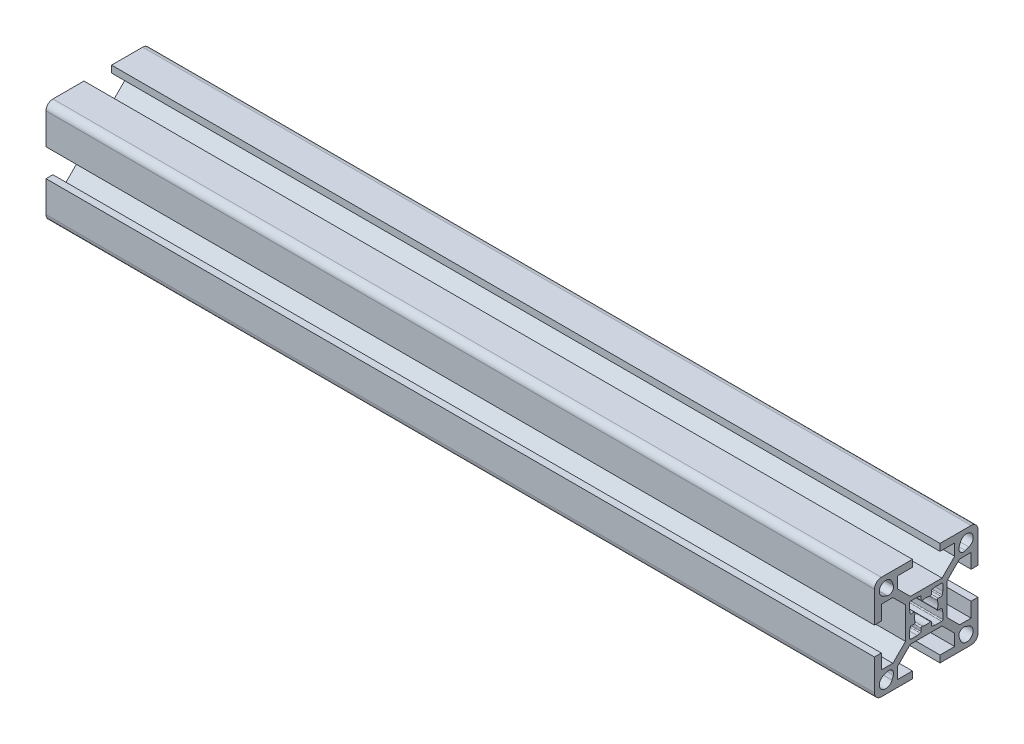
ISO-10303-21;
HEADER;
FILE_DESCRIPTION(('STEP AP214'),'2;1');
FILE_NAME('part.step','',(''),(''),'','','');
FILE_SCHEMA(('AUTOMOTIVE_DESIGN { 1 0 10303 214 1 1 1 1 }'));
ENDSEC;
DATA;
#1=APPLICATION_CONTEXT('core data for automotive mechanical design processes');
#2=APPLICATION_PROTOCOL_DEFINITION('international standard','automotive_design',2000,#1);
#3=PRODUCT_CONTEXT('',#1,'mechanical');
#4=PRODUCT('Part','Part','',(#3));
#5=PRODUCT_RELATED_PRODUCT_CATEGORY('part','',(#4));
#6=PRODUCT_DEFINITION_FORMATION('','',#4);
#7=PRODUCT_DEFINITION_CONTEXT('part definition',#1,'design');
#8=PRODUCT_DEFINITION('design','',#6,#7);
#9=PRODUCT_DEFINITION_SHAPE('','',#8);
#10=(LENGTH_UNIT() NAMED_UNIT(*) SI_UNIT(.MILLI.,.METRE.));
#11=(NAMED_UNIT(*) PLANE_ANGLE_UNIT() SI_UNIT($,.RADIAN.));
#12=(NAMED_UNIT(*) SI_UNIT($,.STERADIAN.) SOLID_ANGLE_UNIT());
#13=UNCERTAINTY_MEASURE_WITH_UNIT(LENGTH_MEASURE(1.E-05),#10,'distance_accuracy_value','');
#14=(GEOMETRIC_REPRESENTATION_CONTEXT(3) GLOBAL_UNCERTAINTY_ASSIGNED_CONTEXT((#13)) GLOBAL_UNIT_ASSIGNED_CONTEXT((#10,
#11,#12)) REPRESENTATION_CONTEXT('',''));
#15=CARTESIAN_POINT('',(0.,0.,0.));
#16=DIRECTION('',(0.,0.,1.));
#17=DIRECTION('',(1.,0.,0.));
#18=AXIS2_PLACEMENT_3D('',#15,#16,#17);
#19=CARTESIAN_POINT('',(240.,13.,13.));
#20=DIRECTION('',(1.,0.,0.));
#21=DIRECTION('',(0.,0.,-1.));
#22=AXIS2_PLACEMENT_3D('',#19,#20,#21);
#23=PLANE('',#22);
#24=CARTESIAN_POINT('',(240.,13.,13.));
#25=DIRECTION('',(1.,0.,0.));
#26=DIRECTION('',(0.,0.,-1.));
#27=AXIS2_PLACEMENT_3D('',#24,#25,#26);
#28=CIRCLE('',#27,1.99999999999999);
#29=CARTESIAN_POINT('',(240.,15.,13.));
#30=VERTEX_POINT('',#29);
#31=CARTESIAN_POINT('',(240.,13.,15.));
#32=VERTEX_POINT('',#31);
#33=EDGE_CURVE('E1300',#30,#32,#28,.T.);
#34=ORIENTED_EDGE('',*,*,#33,.T.);
#35=DIRECTION('',(0.,-1.,0.));
#36=VECTOR('',#35,1.);
#37=CARTESIAN_POINT('',(240.,13.,15.));
#38=LINE('',#37,#36);
#39=CARTESIAN_POINT('',(240.,3.99999999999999,15.));
#40=VERTEX_POINT('',#39);
#41=EDGE_CURVE('E1303',#32,#40,#38,.T.);
#42=ORIENTED_EDGE('',*,*,#41,.T.);
#43=DIRECTION('',(0.,0.,-1.));
#44=VECTOR('',#43,1.);
#45=CARTESIAN_POINT('',(240.,3.99999999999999,15.));
#46=LINE('',#45,#44);
#47=CARTESIAN_POINT('',(240.,3.99999999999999,13.));
#48=VERTEX_POINT('',#47);
#49=EDGE_CURVE('E1306',#40,#48,#46,.T.);
#50=ORIENTED_EDGE('',*,*,#49,.T.);
#51=DIRECTION('',(0.,1.,0.));
#52=VECTOR('',#51,1.);
#53=CARTESIAN_POINT('',(240.,3.99999999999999,13.));
#54=LINE('',#53,#52);
#55=CARTESIAN_POINT('',(240.,8.24999999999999,13.));
#56=VERTEX_POINT('',#55);
#57=EDGE_CURVE('E1308',#48,#56,#54,.T.);
#58=ORIENTED_EDGE('',*,*,#57,.T.);
#59=DIRECTION('',(0.,0.,-1.));
#60=VECTOR('',#59,1.);
#61=CARTESIAN_POINT('',(240.,8.24999999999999,13.));
#62=LINE('',#61,#60);
#63=CARTESIAN_POINT('',(240.,8.24999999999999,9.66421356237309));
#64=VERTEX_POINT('',#63);
#65=EDGE_CURVE('E1310',#56,#64,#62,.T.);
#66=ORIENTED_EDGE('',*,*,#65,.T.);
#67=DIRECTION('',(0.,-0.707106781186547,-0.707106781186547));
#68=VECTOR('',#67,1.);
#69=CARTESIAN_POINT('',(240.,8.24999999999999,9.66421356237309));
#70=LINE('',#69,#68);
#71=CARTESIAN_POINT('',(240.,4.5857864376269,6.));
#72=VERTEX_POINT('',#71);
#73=EDGE_CURVE('E1312',#64,#72,#70,.T.);
#74=ORIENTED_EDGE('',*,*,#73,.T.);
#75=DIRECTION('',(0.,-1.,0.));
#76=VECTOR('',#75,1.);
#77=CARTESIAN_POINT('',(240.,4.5857864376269,6.));
#78=LINE('',#77,#76);
#79=CARTESIAN_POINT('',(240.,-4.58578643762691,6.));
#80=VERTEX_POINT('',#79);
#81=EDGE_CURVE('E1314',#72,#80,#78,.T.);
#82=ORIENTED_EDGE('',*,*,#81,.T.);
#83=DIRECTION('',(0.,-0.707106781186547,0.707106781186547));
#84=VECTOR('',#83,1.);
#85=CARTESIAN_POINT('',(240.,-4.58578643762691,6.));
#86=LINE('',#85,#84);
#87=CARTESIAN_POINT('',(240.,-8.25,9.66421356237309));
#88=VERTEX_POINT('',#87);
#89=EDGE_CURVE('E1316',#80,#88,#86,.T.);
#90=ORIENTED_EDGE('',*,*,#89,.T.);
#91=DIRECTION('',(0.,0.,1.));
#92=VECTOR('',#91,1.);
#93=CARTESIAN_POINT('',(240.,-8.25,9.66421356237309));
#94=LINE('',#93,#92);
#95=CARTESIAN_POINT('',(240.,-8.25,13.));
#96=VERTEX_POINT('',#95);
#97=EDGE_CURVE('E1318',#88,#96,#94,.T.);
#98=ORIENTED_EDGE('',*,*,#97,.T.);
#99=DIRECTION('',(0.,1.,0.));
#100=VECTOR('',#99,1.);
#101=CARTESIAN_POINT('',(240.,-8.25,13.));
#102=LINE('',#101,#100);
#103=CARTESIAN_POINT('',(240.,-4.,13.));
#104=VERTEX_POINT('',#103);
#105=EDGE_CURVE('E1320',#96,#104,#102,.T.);
#106=ORIENTED_EDGE('',*,*,#105,.T.);
#107=DIRECTION('',(0.,0.,1.));
#108=VECTOR('',#107,1.);
#109=CARTESIAN_POINT('',(240.,-4.,13.));
#110=LINE('',#109,#108);
#111=CARTESIAN_POINT('',(240.,-4.,15.));
#112=VERTEX_POINT('',#111);
#113=EDGE_CURVE('E1322',#104,#112,#110,.T.);
#114=ORIENTED_EDGE('',*,*,#113,.T.);
#115=DIRECTION('',(0.,-1.,0.));
#116=VECTOR('',#115,1.);
#117=CARTESIAN_POINT('',(240.,-4.,15.));
#118=LINE('',#117,#116);
#119=CARTESIAN_POINT('',(240.,-13.,15.));
#120=VERTEX_POINT('',#119);
#121=EDGE_CURVE('E1324',#112,#120,#118,.T.);
#122=ORIENTED_EDGE('',*,*,#121,.T.);
#123=CARTESIAN_POINT('',(240.,-13.,13.));
#124=DIRECTION('',(1.,0.,0.));
#125=DIRECTION('',(0.,0.,-1.));
#126=AXIS2_PLACEMENT_3D('',#123,#124,#125);
#127=CIRCLE('',#126,2.);
#128=CARTESIAN_POINT('',(240.,-15.,13.));
#129=VERTEX_POINT('',#128);
#130=EDGE_CURVE('E1326',#120,#129,#127,.T.);
#131=ORIENTED_EDGE('',*,*,#130,.T.);
#132=DIRECTION('',(0.,0.,-1.));
#133=VECTOR('',#132,1.);
#134=CARTESIAN_POINT('',(240.,-15.,13.));
#135=LINE('',#134,#133);
#136=CARTESIAN_POINT('',(240.,-15.,4.));
#137=VERTEX_POINT('',#136);
#138=EDGE_CURVE('E1328',#129,#137,#135,.T.);
#139=ORIENTED_EDGE('',*,*,#138,.T.);
#140=DIRECTION('',(0.,1.,0.));
#141=VECTOR('',#140,1.);
#142=CARTESIAN_POINT('',(240.,-15.,4.));
#143=LINE('',#142,#141);
#144=CARTESIAN_POINT('',(240.,-13.,4.));
#145=VERTEX_POINT('',#144);
#146=EDGE_CURVE('E1330',#137,#145,#143,.T.);
#147=ORIENTED_EDGE('',*,*,#146,.T.);
#148=DIRECTION('',(0.,0.,1.));
#149=VECTOR('',#148,1.);
#150=CARTESIAN_POINT('',(240.,-13.,4.));
#151=LINE('',#150,#149);
#152=CARTESIAN_POINT('',(240.,-13.,8.25));
#153=VERTEX_POINT('',#152);
#154=EDGE_CURVE('E1332',#145,#153,#151,.T.);
#155=ORIENTED_EDGE('',*,*,#154,.T.);
#156=DIRECTION('',(0.,1.,0.));
#157=VECTOR('',#156,1.);
#158=CARTESIAN_POINT('',(240.,-13.,8.25));
#159=LINE('',#158,#157);
#160=CARTESIAN_POINT('',(240.,-9.6642135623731,8.25));
#161=VERTEX_POINT('',#160);
#162=EDGE_CURVE('E1334',#153,#161,#159,.T.);
#163=ORIENTED_EDGE('',*,*,#162,.T.);
#164=DIRECTION('',(0.,0.707106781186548,-0.707106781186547));
#165=VECTOR('',#164,1.);
#166=CARTESIAN_POINT('',(240.,-9.6642135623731,8.25));
#167=LINE('',#166,#165);
#168=CARTESIAN_POINT('',(240.,-6.00000000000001,4.58578643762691));
#169=VERTEX_POINT('',#168);
#170=EDGE_CURVE('E1336',#161,#169,#167,.T.);
#171=ORIENTED_EDGE('',*,*,#170,.T.);
#172=DIRECTION('',(0.,0.,-1.));
#173=VECTOR('',#172,1.);
#174=CARTESIAN_POINT('',(240.,-6.00000000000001,4.58578643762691));
#175=LINE('',#174,#173);
#176=CARTESIAN_POINT('',(240.,-6.00000000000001,-4.58578643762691));
#177=VERTEX_POINT('',#176);
#178=EDGE_CURVE('E1338',#169,#177,#175,.T.);
#179=ORIENTED_EDGE('',*,*,#178,.T.);
#180=DIRECTION('',(0.,-0.707106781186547,-0.707106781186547));
#181=VECTOR('',#180,1.);
#182=CARTESIAN_POINT('',(240.,-6.00000000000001,-4.58578643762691));
#183=LINE('',#182,#181);
#184=CARTESIAN_POINT('',(240.,-9.6642135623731,-8.25000000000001));
#185=VERTEX_POINT('',#184);
#186=EDGE_CURVE('E1340',#177,#185,#183,.T.);
#187=ORIENTED_EDGE('',*,*,#186,.T.);
#188=DIRECTION('',(0.,-1.,0.));
#189=VECTOR('',#188,1.);
#190=CARTESIAN_POINT('',(240.,-9.6642135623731,-8.25000000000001));
#191=LINE('',#190,#189);
#192=CARTESIAN_POINT('',(240.,-13.,-8.25000000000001));
#193=VERTEX_POINT('',#192);
#194=EDGE_CURVE('E1342',#185,#193,#191,.T.);
#195=ORIENTED_EDGE('',*,*,#194,.T.);
#196=DIRECTION('',(0.,0.,1.));
#197=VECTOR('',#196,1.);
#198=CARTESIAN_POINT('',(240.,-13.,-8.25000000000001));
#199=LINE('',#198,#197);
#200=CARTESIAN_POINT('',(240.,-13.,-4.));
#201=VERTEX_POINT('',#200);
#202=EDGE_CURVE('E1344',#193,#201,#199,.T.);
#203=ORIENTED_EDGE('',*,*,#202,.T.);
#204=DIRECTION('',(0.,-1.,0.));
#205=VECTOR('',#204,1.);
#206=CARTESIAN_POINT('',(240.,-13.,-4.));
#207=LINE('',#206,#205);
#208=CARTESIAN_POINT('',(240.,-15.,-4.));
#209=VERTEX_POINT('',#208);
#210=EDGE_CURVE('E1346',#201,#209,#207,.T.);
#211=ORIENTED_EDGE('',*,*,#210,.T.);
#212=DIRECTION('',(0.,0.,-1.));
#213=VECTOR('',#212,1.);
#214=CARTESIAN_POINT('',(240.,-15.,-4.));
#215=LINE('',#214,#213);
#216=CARTESIAN_POINT('',(240.,-15.,-13.));
#217=VERTEX_POINT('',#216);
#218=EDGE_CURVE('E1348',#209,#217,#215,.T.);
#219=ORIENTED_EDGE('',*,*,#218,.T.);
#220=CARTESIAN_POINT('',(240.,-13.,-13.));
#221=DIRECTION('',(1.,0.,0.));
#222=DIRECTION('',(0.,0.,-1.));
#223=AXIS2_PLACEMENT_3D('',#220,#221,#222);
#224=CIRCLE('',#223,1.99999999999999);
#225=CARTESIAN_POINT('',(240.,-13.,-15.));
#226=VERTEX_POINT('',#225);
#227=EDGE_CURVE('E1350',#217,#226,#224,.T.);
#228=ORIENTED_EDGE('',*,*,#227,.T.);
#229=DIRECTION('',(0.,1.,0.));
#230=VECTOR('',#229,1.);
#231=CARTESIAN_POINT('',(240.,-13.,-15.));
#232=LINE('',#231,#230);
#233=CARTESIAN_POINT('',(240.,-4.00000000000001,-15.));
#234=VERTEX_POINT('',#233);
#235=EDGE_CURVE('E1352',#226,#234,#232,.T.);
#236=ORIENTED_EDGE('',*,*,#235,.T.);
#237=DIRECTION('',(0.,0.,1.));
#238=VECTOR('',#237,1.);
#239=CARTESIAN_POINT('',(240.,-4.00000000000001,-15.));
#240=LINE('',#239,#238);
#241=CARTESIAN_POINT('',(240.,-4.00000000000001,-13.));
#242=VERTEX_POINT('',#241);
#243=EDGE_CURVE('E1354',#234,#242,#240,.T.);
#244=ORIENTED_EDGE('',*,*,#243,.T.);
#245=DIRECTION('',(0.,-1.,0.));
#246=VECTOR('',#245,1.);
#247=CARTESIAN_POINT('',(240.,-4.00000000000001,-13.));
#248=LINE('',#247,#246);
#249=CARTESIAN_POINT('',(240.,-8.25000000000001,-13.));
#250=VERTEX_POINT('',#249);
#251=EDGE_CURVE('E1356',#242,#250,#248,.T.);
#252=ORIENTED_EDGE('',*,*,#251,.T.);
#253=DIRECTION('',(0.,0.,1.));
#254=VECTOR('',#253,1.);
#255=CARTESIAN_POINT('',(240.,-8.25000000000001,-13.));
#256=LINE('',#255,#254);
#257=CARTESIAN_POINT('',(240.,-8.25000000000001,-9.6642135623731));
#258=VERTEX_POINT('',#257);
#259=EDGE_CURVE('E1358',#250,#258,#256,.T.);
#260=ORIENTED_EDGE('',*,*,#259,.T.);
#261=DIRECTION('',(0.,0.707106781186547,0.707106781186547));
#262=VECTOR('',#261,1.);
#263=CARTESIAN_POINT('',(240.,-8.25000000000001,-9.6642135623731));
#264=LINE('',#263,#262);
#265=CARTESIAN_POINT('',(240.,-4.58578643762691,-6.00000000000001));
#266=VERTEX_POINT('',#265);
#267=EDGE_CURVE('E1360',#258,#266,#264,.T.);
#268=ORIENTED_EDGE('',*,*,#267,.T.);
#269=DIRECTION('',(0.,1.,0.));
#270=VECTOR('',#269,1.);
#271=CARTESIAN_POINT('',(240.,-4.58578643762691,-6.00000000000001));
#272=LINE('',#271,#270);
#273=CARTESIAN_POINT('',(240.,4.5857864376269,-6.00000000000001));
#274=VERTEX_POINT('',#273);
#275=EDGE_CURVE('E1362',#266,#274,#272,.T.);
#276=ORIENTED_EDGE('',*,*,#275,.T.);
#277=DIRECTION('',(0.,0.707106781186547,-0.707106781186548));
#278=VECTOR('',#277,1.);
#279=CARTESIAN_POINT('',(240.,4.5857864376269,-6.00000000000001));
#280=LINE('',#279,#278);
#281=CARTESIAN_POINT('',(240.,8.24999999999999,-9.6642135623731));
#282=VERTEX_POINT('',#281);
#283=EDGE_CURVE('E1364',#274,#282,#280,.T.);
#284=ORIENTED_EDGE('',*,*,#283,.T.);
#285=DIRECTION('',(0.,0.,-1.));
#286=VECTOR('',#285,1.);
#287=CARTESIAN_POINT('',(240.,8.24999999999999,-9.6642135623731));
#288=LINE('',#287,#286);
#289=CARTESIAN_POINT('',(240.,8.24999999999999,-13.));
#290=VERTEX_POINT('',#289);
#291=EDGE_CURVE('E1366',#282,#290,#288,.T.);
#292=ORIENTED_EDGE('',*,*,#291,.T.);
#293=DIRECTION('',(0.,-1.,0.));
#294=VECTOR('',#293,1.);
#295=CARTESIAN_POINT('',(240.,8.24999999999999,-13.));
#296=LINE('',#295,#294);
#297=CARTESIAN_POINT('',(240.,3.99999999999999,-13.));
#298=VERTEX_POINT('',#297);
#299=EDGE_CURVE('E1368',#290,#298,#296,.T.);
#300=ORIENTED_EDGE('',*,*,#299,.T.);
#301=DIRECTION('',(0.,0.,-1.));
#302=VECTOR('',#301,1.);
#303=CARTESIAN_POINT('',(240.,3.99999999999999,-13.));
#304=LINE('',#303,#302);
#305=CARTESIAN_POINT('',(240.,3.99999999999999,-15.));
#306=VERTEX_POINT('',#305);
#307=EDGE_CURVE('E1370',#298,#306,#304,.T.);
#308=ORIENTED_EDGE('',*,*,#307,.T.);
#309=DIRECTION('',(0.,1.,0.));
#310=VECTOR('',#309,1.);
#311=CARTESIAN_POINT('',(240.,3.99999999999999,-15.));
#312=LINE('',#311,#310);
#313=CARTESIAN_POINT('',(240.,13.,-15.));
#314=VERTEX_POINT('',#313);
#315=EDGE_CURVE('E1372',#306,#314,#312,.T.);
#316=ORIENTED_EDGE('',*,*,#315,.T.);
#317=CARTESIAN_POINT('',(240.,13.,-13.));
#318=DIRECTION('',(1.,0.,0.));
#319=DIRECTION('',(0.,0.,-1.));
#320=AXIS2_PLACEMENT_3D('',#317,#318,#319);
#321=CIRCLE('',#320,2.);
#322=CARTESIAN_POINT('',(240.,15.,-13.));
#323=VERTEX_POINT('',#322);
#324=EDGE_CURVE('E1374',#314,#323,#321,.T.);
#325=ORIENTED_EDGE('',*,*,#324,.T.);
#326=DIRECTION('',(0.,0.,1.));
#327=VECTOR('',#326,1.);
#328=CARTESIAN_POINT('',(240.,15.,-13.));
#329=LINE('',#328,#327);
#330=CARTESIAN_POINT('',(240.,15.,-4.));
#331=VERTEX_POINT('',#330);
#332=EDGE_CURVE('E1376',#323,#331,#329,.T.);
#333=ORIENTED_EDGE('',*,*,#332,.T.);
#334=DIRECTION('',(0.,-1.,0.));
#335=VECTOR('',#334,1.);
#336=CARTESIAN_POINT('',(240.,15.,-4.));
#337=LINE('',#336,#335);
#338=CARTESIAN_POINT('',(240.,13.,-4.));
#339=VERTEX_POINT('',#338);
#340=EDGE_CURVE('E1378',#331,#339,#337,.T.);
#341=ORIENTED_EDGE('',*,*,#340,.T.);
#342=DIRECTION('',(0.,0.,-1.));
#343=VECTOR('',#342,1.);
#344=CARTESIAN_POINT('',(240.,13.,-4.));
#345=LINE('',#344,#343);
#346=CARTESIAN_POINT('',(240.,13.,-8.25000000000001));
#347=VERTEX_POINT('',#346);
#348=EDGE_CURVE('E1380',#339,#347,#345,.T.);
#349=ORIENTED_EDGE('',*,*,#348,.T.);
#350=DIRECTION('',(0.,-1.,0.));
#351=VECTOR('',#350,1.);
#352=CARTESIAN_POINT('',(240.,13.,-8.25000000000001));
#353=LINE('',#352,#351);
#354=CARTESIAN_POINT('',(240.,9.66421356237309,-8.25000000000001));
#355=VERTEX_POINT('',#354);
#356=EDGE_CURVE('E1382',#347,#355,#353,.T.);
#357=ORIENTED_EDGE('',*,*,#356,.T.);
#358=DIRECTION('',(0.,-0.707106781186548,0.707106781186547));
#359=VECTOR('',#358,1.);
#360=CARTESIAN_POINT('',(240.,9.66421356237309,-8.25000000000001));
#361=LINE('',#360,#359);
#362=CARTESIAN_POINT('',(240.,5.99999999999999,-4.58578643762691));
#363=VERTEX_POINT('',#362);
#364=EDGE_CURVE('E1384',#355,#363,#361,.T.);
#365=ORIENTED_EDGE('',*,*,#364,.T.);
#366=DIRECTION('',(0.,0.,1.));
#367=VECTOR('',#366,1.);
#368=CARTESIAN_POINT('',(240.,5.99999999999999,-4.58578643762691));
#369=LINE('',#368,#367);
#370=CARTESIAN_POINT('',(240.,5.99999999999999,4.58578643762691));
#371=VERTEX_POINT('',#370);
#372=EDGE_CURVE('E1386',#363,#371,#369,.T.);
#373=ORIENTED_EDGE('',*,*,#372,.T.);
#374=DIRECTION('',(0.,0.707106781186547,0.707106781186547));
#375=VECTOR('',#374,1.);
#376=CARTESIAN_POINT('',(240.,5.99999999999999,4.58578643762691));
#377=LINE('',#376,#375);
#378=CARTESIAN_POINT('',(240.,9.66421356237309,8.25));
#379=VERTEX_POINT('',#378);
#380=EDGE_CURVE('E1388',#371,#379,#377,.T.);
#381=ORIENTED_EDGE('',*,*,#380,.T.);
#382=DIRECTION('',(0.,1.,0.));
#383=VECTOR('',#382,1.);
#384=CARTESIAN_POINT('',(240.,9.66421356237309,8.25));
#385=LINE('',#384,#383);
#386=CARTESIAN_POINT('',(240.,13.,8.25));
#387=VERTEX_POINT('',#386);
#388=EDGE_CURVE('E1390',#379,#387,#385,.T.);
#389=ORIENTED_EDGE('',*,*,#388,.T.);
#390=DIRECTION('',(0.,0.,-1.));
#391=VECTOR('',#390,1.);
#392=CARTESIAN_POINT('',(240.,13.,8.25));
#393=LINE('',#392,#391);
#394=CARTESIAN_POINT('',(240.,13.,4.));
#395=VERTEX_POINT('',#394);
#396=EDGE_CURVE('E1392',#387,#395,#393,.T.);
#397=ORIENTED_EDGE('',*,*,#396,.T.);
#398=DIRECTION('',(0.,1.,0.));
#399=VECTOR('',#398,1.);
#400=CARTESIAN_POINT('',(240.,13.,4.));
#401=LINE('',#400,#399);
#402=CARTESIAN_POINT('',(240.,15.,4.));
#403=VERTEX_POINT('',#402);
#404=EDGE_CURVE('E1394',#395,#403,#401,.T.);
#405=ORIENTED_EDGE('',*,*,#404,.T.);
#406=DIRECTION('',(0.,0.,1.));
#407=VECTOR('',#406,1.);
#408=CARTESIAN_POINT('',(240.,15.,4.));
#409=LINE('',#408,#407);
#410=EDGE_CURVE('E1396',#403,#30,#409,.T.);
#411=ORIENTED_EDGE('',*,*,#410,.T.);
#412=EDGE_LOOP('',(#34,#42,#50,#58,#66,#74,#82,#90,#98,#106,#114,#122,#131,#139,#147,#155,#163,
#171,#179,#187,#195,#203,#211,#219,#228,#236,#244,#252,#260,#268,#276,#284,#292,#300,#308,#316,
#325,#333,#341,#349,#357,#365,#373,#381,#389,#397,#405,#411));
#413=FACE_BOUND('',#412,.T.);
#414=DIRECTION('',(0.,-0.348174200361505,-0.93742985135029));
#415=VECTOR('',#414,1.);
#416=CARTESIAN_POINT('',(240.,9.91888328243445,12.3615309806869));
#417=LINE('',#416,#415);
#418=CARTESIAN_POINT('',(240.,9.91888328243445,12.3615309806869));
#419=VERTEX_POINT('',#418);
#420=CARTESIAN_POINT('',(240.,9.53907007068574,11.3389157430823));
#421=VERTEX_POINT('',#420);
#422=EDGE_CURVE('E1271',#419,#421,#417,.T.);
#423=ORIENTED_EDGE('',*,*,#422,.F.);
#424=CARTESIAN_POINT('',(240.,11.7,11.7));
#425=DIRECTION('',(1.,0.,0.));
#426=DIRECTION('',(0.,0.,-1.));
#427=AXIS2_PLACEMENT_3D('',#424,#425,#426);
#428=CIRCLE('',#427,1.9);
#429=CARTESIAN_POINT('',(240.,12.3615309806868,9.91888328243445));
#430=VERTEX_POINT('',#429);
#431=EDGE_CURVE('E1269',#430,#419,#428,.T.);
#432=ORIENTED_EDGE('',*,*,#431,.F.);
#433=DIRECTION('',(0.,0.937429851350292,0.3481742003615));
#434=VECTOR('',#433,1.);
#435=CARTESIAN_POINT('',(240.,11.3389157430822,9.53907007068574));
#436=LINE('',#435,#434);
#437=CARTESIAN_POINT('',(240.,11.3389157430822,9.53907007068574));
#438=VERTEX_POINT('',#437);
#439=EDGE_CURVE('E1277',#438,#430,#436,.T.);
#440=ORIENTED_EDGE('',*,*,#439,.F.);
#441=CARTESIAN_POINT('',(240.,10.8514718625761,10.8514718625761));
#442=DIRECTION('',(1.,0.,0.));
#443=DIRECTION('',(0.,0.,-1.));
#444=AXIS2_PLACEMENT_3D('',#441,#442,#443);
#445=CIRCLE('',#444,1.4);
#446=EDGE_CURVE('E1274',#421,#438,#445,.T.);
#447=ORIENTED_EDGE('',*,*,#446,.F.);
#448=EDGE_LOOP('',(#423,#432,#440,#447));
#449=FACE_BOUND('',#448,.T.);
#450=DIRECTION('',(0.,0.3481742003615,-0.937429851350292));
#451=VECTOR('',#450,1.);
#452=CARTESIAN_POINT('',(240.,9.53907007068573,-11.3389157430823));
#453=LINE('',#452,#451);
#454=CARTESIAN_POINT('',(240.,9.53907007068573,-11.3389157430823));
#455=VERTEX_POINT('',#454);
#456=CARTESIAN_POINT('',(240.,9.91888328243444,-12.3615309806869));
#457=VERTEX_POINT('',#456);
#458=EDGE_CURVE('E1240',#455,#457,#453,.T.);
#459=ORIENTED_EDGE('',*,*,#458,.F.);
#460=CARTESIAN_POINT('',(240.,10.8514718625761,-10.8514718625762));
#461=DIRECTION('',(1.,0.,0.));
#462=DIRECTION('',(0.,0.,-1.));
#463=AXIS2_PLACEMENT_3D('',#460,#461,#462);
#464=CIRCLE('',#463,1.4);
#465=CARTESIAN_POINT('',(240.,11.3389157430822,-9.53907007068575));
#466=VERTEX_POINT('',#465);
#467=EDGE_CURVE('E1238',#466,#455,#464,.T.);
#468=ORIENTED_EDGE('',*,*,#467,.F.);
#469=DIRECTION('',(0.,-0.937429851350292,0.3481742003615));
#470=VECTOR('',#469,1.);
#471=CARTESIAN_POINT('',(240.,12.3615309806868,-9.91888328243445));
#472=LINE('',#471,#470);
#473=CARTESIAN_POINT('',(240.,12.3615309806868,-9.91888328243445));
#474=VERTEX_POINT('',#473);
#475=EDGE_CURVE('E1246',#474,#466,#472,.T.);
#476=ORIENTED_EDGE('',*,*,#475,.F.);
#477=CARTESIAN_POINT('',(240.,11.7,-11.7));
#478=DIRECTION('',(1.,0.,0.));
#479=DIRECTION('',(0.,0.,-1.));
#480=AXIS2_PLACEMENT_3D('',#477,#478,#479);
#481=CIRCLE('',#480,1.9);
#482=EDGE_CURVE('E1243',#457,#474,#481,.T.);
#483=ORIENTED_EDGE('',*,*,#482,.F.);
#484=EDGE_LOOP('',(#459,#468,#476,#483));
#485=FACE_BOUND('',#484,.T.);
#486=DIRECTION('',(0.,0.,-1.));
#487=VECTOR('',#486,1.);
#488=CARTESIAN_POINT('',(240.,-4.80000000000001,4.5));
#489=LINE('',#488,#487);
#490=CARTESIAN_POINT('',(240.,-4.80000000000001,4.5));
#491=VERTEX_POINT('',#490);
#492=CARTESIAN_POINT('',(240.,-4.80000000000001,2.64443357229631));
#493=VERTEX_POINT('',#492);
#494=EDGE_CURVE('E845',#491,#493,#489,.T.);
#495=ORIENTED_EDGE('',*,*,#494,.F.);
#496=CARTESIAN_POINT('',(240.,-4.50000000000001,4.5));
#497=DIRECTION('',(1.,0.,0.));
#498=DIRECTION('',(0.,0.,-1.));
#499=AXIS2_PLACEMENT_3D('',#496,#497,#498);
#500=CIRCLE('',#499,0.299999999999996);
#501=CARTESIAN_POINT('',(240.,-4.50000000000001,4.8));
#502=VERTEX_POINT('',#501);
#503=EDGE_CURVE('E843',#502,#491,#500,.T.);
#504=ORIENTED_EDGE('',*,*,#503,.F.);
#505=DIRECTION('',(0.,-1.,0.));
#506=VECTOR('',#505,1.);
#507=CARTESIAN_POINT('',(240.,-2.6444335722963,4.8));
#508=LINE('',#507,#506);
#509=CARTESIAN_POINT('',(240.,-2.64443357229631,4.8));
#510=VERTEX_POINT('',#509);
#511=EDGE_CURVE('E955',#510,#502,#508,.T.);
#512=ORIENTED_EDGE('',*,*,#511,.F.);
#513=CARTESIAN_POINT('',(240.,-2.6444335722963,4.50000000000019));
#514=DIRECTION('',(1.,0.,0.));
#515=DIRECTION('',(0.,0.,-1.));
#516=AXIS2_PLACEMENT_3D('',#513,#514,#515);
#517=CIRCLE('',#516,0.299999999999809);
#518=CARTESIAN_POINT('',(240.,-2.58719087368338,4.7944881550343));
#519=VERTEX_POINT('',#518);
#520=EDGE_CURVE('E952',#519,#510,#517,.T.);
#521=ORIENTED_EDGE('',*,*,#520,.F.);
#522=DIRECTION('',(0.,-0.981627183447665,0.190808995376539));
#523=VECTOR('',#522,1.);
#524=CARTESIAN_POINT('',(240.,-1.74275730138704,4.63034689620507));
#525=LINE('',#524,#523);
#526=CARTESIAN_POINT('',(240.,-1.74275730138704,4.63034689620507));
#527=VERTEX_POINT('',#526);
#528=EDGE_CURVE('E950',#527,#519,#525,.T.);
#529=ORIENTED_EDGE('',*,*,#528,.F.);
#530=CARTESIAN_POINT('',(240.,-1.8,4.33585874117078));
#531=DIRECTION('',(1.,0.,0.));
#532=DIRECTION('',(0.,0.,-1.));
#533=AXIS2_PLACEMENT_3D('',#530,#531,#532);
#534=CIRCLE('',#533,0.299999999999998);
#535=CARTESIAN_POINT('',(240.,-1.50000000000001,4.33585874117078));
#536=VERTEX_POINT('',#535);
#537=EDGE_CURVE('E948',#536,#527,#534,.T.);
#538=ORIENTED_EDGE('',*,*,#537,.F.);
#539=DIRECTION('',(0.,0.,1.));
#540=VECTOR('',#539,1.);
#541=CARTESIAN_POINT('',(240.,-1.50000000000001,3.5));
#542=LINE('',#541,#540);
#543=CARTESIAN_POINT('',(240.,-1.50000000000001,3.5));
#544=VERTEX_POINT('',#543);
#545=EDGE_CURVE('E946',#544,#536,#542,.T.);
#546=ORIENTED_EDGE('',*,*,#545,.F.);
#547=CARTESIAN_POINT('',(240.,-1.20000000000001,3.5));
#548=DIRECTION('',(-1.,0.,0.));
#549=DIRECTION('',(0.,0.,-1.));
#550=AXIS2_PLACEMENT_3D('',#547,#548,#549);
#551=CIRCLE('',#550,0.3);
#552=CARTESIAN_POINT('',(240.,-1.10270270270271,3.21621621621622));
#553=VERTEX_POINT('',#552);
#554=EDGE_CURVE('E944',#553,#544,#551,.T.);
#555=ORIENTED_EDGE('',*,*,#554,.F.);
#556=CARTESIAN_POINT('',(240.,0.,0.));
#557=DIRECTION('',(1.,0.,0.));
#558=DIRECTION('',(0.,0.,-1.));
#559=AXIS2_PLACEMENT_3D('',#556,#557,#558);
#560=CIRCLE('',#559,3.40000000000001);
#561=CARTESIAN_POINT('',(240.,1.1027027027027,3.21621621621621));
#562=VERTEX_POINT('',#561);
#563=EDGE_CURVE('E942',#562,#553,#560,.T.);
#564=ORIENTED_EDGE('',*,*,#563,.F.);
#565=CARTESIAN_POINT('',(240.,1.2,3.5));
#566=DIRECTION('',(-1.,0.,0.));
#567=DIRECTION('',(0.,0.,-1.));
#568=AXIS2_PLACEMENT_3D('',#565,#566,#567);
#569=CIRCLE('',#568,0.3);
#570=CARTESIAN_POINT('',(240.,1.5,3.5));
#571=VERTEX_POINT('',#570);
#572=EDGE_CURVE('E940',#571,#562,#569,.T.);
#573=ORIENTED_EDGE('',*,*,#572,.F.);
#574=DIRECTION('',(0.,0.,-1.));
#575=VECTOR('',#574,1.);
#576=CARTESIAN_POINT('',(240.,1.5,4.33585874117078));
#577=LINE('',#576,#575);
#578=CARTESIAN_POINT('',(240.,1.5,4.33585874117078));
#579=VERTEX_POINT('',#578);
#580=EDGE_CURVE('E938',#579,#571,#577,.T.);
#581=ORIENTED_EDGE('',*,*,#580,.F.);
#582=CARTESIAN_POINT('',(240.,1.79999999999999,4.33585874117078));
#583=DIRECTION('',(1.,0.,0.));
#584=DIRECTION('',(0.,0.,-1.));
#585=AXIS2_PLACEMENT_3D('',#582,#583,#584);
#586=CIRCLE('',#585,0.299999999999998);
#587=CARTESIAN_POINT('',(240.,1.74275730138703,4.63034689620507));
#588=VERTEX_POINT('',#587);
#589=EDGE_CURVE('E936',#588,#579,#586,.T.);
#590=ORIENTED_EDGE('',*,*,#589,.F.);
#591=DIRECTION('',(0.,-0.981627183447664,-0.190808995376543));
#592=VECTOR('',#591,1.);
#593=CARTESIAN_POINT('',(240.,2.58719087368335,4.7944881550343));
#594=LINE('',#593,#592);
#595=CARTESIAN_POINT('',(240.,2.58719087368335,4.7944881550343));
#596=VERTEX_POINT('',#595);
#597=EDGE_CURVE('E934',#596,#588,#594,.T.);
#598=ORIENTED_EDGE('',*,*,#597,.F.);
#599=CARTESIAN_POINT('',(240.,2.6444335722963,4.50000000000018));
#600=DIRECTION('',(1.,0.,0.));
#601=DIRECTION('',(0.,0.,-1.));
#602=AXIS2_PLACEMENT_3D('',#599,#600,#601);
#603=CIRCLE('',#602,0.299999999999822);
#604=CARTESIAN_POINT('',(240.,2.6444335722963,4.8));
#605=VERTEX_POINT('',#604);
#606=EDGE_CURVE('E932',#605,#596,#603,.T.);
#607=ORIENTED_EDGE('',*,*,#606,.F.);
#608=DIRECTION('',(0.,-1.,0.));
#609=VECTOR('',#608,1.);
#610=CARTESIAN_POINT('',(240.,4.5,4.8));
#611=LINE('',#610,#609);
#612=CARTESIAN_POINT('',(240.,4.5,4.8));
#613=VERTEX_POINT('',#612);
#614=EDGE_CURVE('E930',#613,#605,#611,.T.);
#615=ORIENTED_EDGE('',*,*,#614,.F.);
#616=CARTESIAN_POINT('',(240.,4.5,4.5));
#617=DIRECTION('',(1.,0.,0.));
#618=DIRECTION('',(0.,0.,-1.));
#619=AXIS2_PLACEMENT_3D('',#616,#617,#618);
#620=CIRCLE('',#619,0.299999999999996);
#621=CARTESIAN_POINT('',(240.,4.79999999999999,4.5));
#622=VERTEX_POINT('',#621);
#623=EDGE_CURVE('E928',#622,#613,#620,.T.);
#624=ORIENTED_EDGE('',*,*,#623,.F.);
#625=DIRECTION('',(0.,0.,1.));
#626=VECTOR('',#625,1.);
#627=CARTESIAN_POINT('',(240.,4.8,2.6444335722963));
#628=LINE('',#627,#626);
#629=CARTESIAN_POINT('',(240.,4.8,2.6444335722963));
#630=VERTEX_POINT('',#629);
#631=EDGE_CURVE('E926',#630,#622,#628,.T.);
#632=ORIENTED_EDGE('',*,*,#631,.F.);
#633=CARTESIAN_POINT('',(240.,4.50000000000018,2.6444335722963));
#634=DIRECTION('',(1.,0.,0.));
#635=DIRECTION('',(0.,0.,-1.));
#636=AXIS2_PLACEMENT_3D('',#633,#634,#635);
#637=CIRCLE('',#636,0.299999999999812);
#638=CARTESIAN_POINT('',(240.,4.7944881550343,2.58719087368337));
#639=VERTEX_POINT('',#638);
#640=EDGE_CURVE('E924',#639,#630,#637,.T.);
#641=ORIENTED_EDGE('',*,*,#640,.F.);
#642=DIRECTION('',(0.,0.190808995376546,0.981627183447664));
#643=VECTOR('',#642,1.);
#644=CARTESIAN_POINT('',(240.,4.63034689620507,1.74275730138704));
#645=LINE('',#644,#643);
#646=CARTESIAN_POINT('',(240.,4.63034689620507,1.74275730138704));
#647=VERTEX_POINT('',#646);
#648=EDGE_CURVE('E922',#647,#639,#645,.T.);
#649=ORIENTED_EDGE('',*,*,#648,.F.);
#650=CARTESIAN_POINT('',(240.,4.33585874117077,1.8));
#651=DIRECTION('',(1.,0.,0.));
#652=DIRECTION('',(0.,0.,-1.));
#653=AXIS2_PLACEMENT_3D('',#650,#651,#652);
#654=CIRCLE('',#653,0.299999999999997);
#655=CARTESIAN_POINT('',(240.,4.33585874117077,1.5));
#656=VERTEX_POINT('',#655);
#657=EDGE_CURVE('E920',#656,#647,#654,.T.);
#658=ORIENTED_EDGE('',*,*,#657,.F.);
#659=DIRECTION('',(0.,1.,0.));
#660=VECTOR('',#659,1.);
#661=CARTESIAN_POINT('',(240.,3.5,1.5));
#662=LINE('',#661,#660);
#663=CARTESIAN_POINT('',(240.,3.5,1.5));
#664=VERTEX_POINT('',#663);
#665=EDGE_CURVE('E918',#664,#656,#662,.T.);
#666=ORIENTED_EDGE('',*,*,#665,.F.);
#667=CARTESIAN_POINT('',(240.,3.5,1.2));
#668=DIRECTION('',(-1.,0.,0.));
#669=DIRECTION('',(0.,0.,-1.));
#670=AXIS2_PLACEMENT_3D('',#667,#668,#669);
#671=CIRCLE('',#670,0.300000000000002);
#672=CARTESIAN_POINT('',(240.,3.21621621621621,1.1027027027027));
#673=VERTEX_POINT('',#672);
#674=EDGE_CURVE('E916',#673,#664,#671,.T.);
#675=ORIENTED_EDGE('',*,*,#674,.F.);
#676=CARTESIAN_POINT('',(240.,0.,0.));
#677=DIRECTION('',(1.,0.,0.));
#678=DIRECTION('',(0.,0.,-1.));
#679=AXIS2_PLACEMENT_3D('',#676,#677,#678);
#680=CIRCLE('',#679,3.4);
#681=CARTESIAN_POINT('',(240.,3.21621621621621,-1.10270270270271));
#682=VERTEX_POINT('',#681);
#683=EDGE_CURVE('E914',#682,#673,#680,.T.);
#684=ORIENTED_EDGE('',*,*,#683,.F.);
#685=CARTESIAN_POINT('',(240.,3.49999999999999,-1.20000000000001));
#686=DIRECTION('',(-1.,0.,0.));
#687=DIRECTION('',(0.,0.,-1.));
#688=AXIS2_PLACEMENT_3D('',#685,#686,#687);
#689=CIRCLE('',#688,0.299999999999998);
#690=CARTESIAN_POINT('',(240.,3.49999999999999,-1.5));
#691=VERTEX_POINT('',#690);
#692=EDGE_CURVE('E912',#691,#682,#689,.T.);
#693=ORIENTED_EDGE('',*,*,#692,.F.);
#694=DIRECTION('',(0.,-1.,0.));
#695=VECTOR('',#694,1.);
#696=CARTESIAN_POINT('',(240.,4.33585874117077,-1.5));
#697=LINE('',#696,#695);
#698=CARTESIAN_POINT('',(240.,4.33585874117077,-1.5));
#699=VERTEX_POINT('',#698);
#700=EDGE_CURVE('E910',#699,#691,#697,.T.);
#701=ORIENTED_EDGE('',*,*,#700,.F.);
#702=CARTESIAN_POINT('',(240.,4.33585874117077,-1.8));
#703=DIRECTION('',(1.,0.,0.));
#704=DIRECTION('',(0.,0.,-1.));
#705=AXIS2_PLACEMENT_3D('',#702,#703,#704);
#706=CIRCLE('',#705,0.299999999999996);
#707=CARTESIAN_POINT('',(240.,4.63034689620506,-1.74275730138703));
#708=VERTEX_POINT('',#707);
#709=EDGE_CURVE('E908',#708,#699,#706,.T.);
#710=ORIENTED_EDGE('',*,*,#709,.F.);
#711=DIRECTION('',(0.,-0.190808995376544,0.981627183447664));
#712=VECTOR('',#711,1.);
#713=CARTESIAN_POINT('',(240.,4.79448815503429,-2.58719087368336));
#714=LINE('',#713,#712);
#715=CARTESIAN_POINT('',(240.,4.79448815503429,-2.58719087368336));
#716=VERTEX_POINT('',#715);
#717=EDGE_CURVE('E906',#716,#708,#714,.T.);
#718=ORIENTED_EDGE('',*,*,#717,.F.);
#719=CARTESIAN_POINT('',(240.,4.50000000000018,-2.64443357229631));
#720=DIRECTION('',(1.,0.,0.));
#721=DIRECTION('',(0.,0.,-1.));
#722=AXIS2_PLACEMENT_3D('',#719,#720,#721);
#723=CIRCLE('',#722,0.299999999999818);
#724=CARTESIAN_POINT('',(240.,4.79999999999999,-2.64443357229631));
#725=VERTEX_POINT('',#724);
#726=EDGE_CURVE('E904',#725,#716,#723,.T.);
#727=ORIENTED_EDGE('',*,*,#726,.F.);
#728=DIRECTION('',(0.,0.,1.));
#729=VECTOR('',#728,1.);
#730=CARTESIAN_POINT('',(240.,4.8,-4.5));
#731=LINE('',#730,#729);
#732=CARTESIAN_POINT('',(240.,4.8,-4.5));
#733=VERTEX_POINT('',#732);
#734=EDGE_CURVE('E902',#733,#725,#731,.T.);
#735=ORIENTED_EDGE('',*,*,#734,.F.);
#736=CARTESIAN_POINT('',(240.,4.5,-4.5));
#737=DIRECTION('',(1.,0.,0.));
#738=DIRECTION('',(0.,0.,-1.));
#739=AXIS2_PLACEMENT_3D('',#736,#737,#738);
#740=CIRCLE('',#739,0.299999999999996);
#741=CARTESIAN_POINT('',(240.,4.5,-4.8));
#742=VERTEX_POINT('',#741);
#743=EDGE_CURVE('E900',#742,#733,#740,.T.);
#744=ORIENTED_EDGE('',*,*,#743,.F.);
#745=DIRECTION('',(0.,1.,0.));
#746=VECTOR('',#745,1.);
#747=CARTESIAN_POINT('',(240.,2.64443357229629,-4.8));
#748=LINE('',#747,#746);
#749=CARTESIAN_POINT('',(240.,2.64443357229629,-4.8));
#750=VERTEX_POINT('',#749);
#751=EDGE_CURVE('E898',#750,#742,#748,.T.);
#752=ORIENTED_EDGE('',*,*,#751,.F.);
#753=CARTESIAN_POINT('',(240.,2.64443357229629,-4.50000000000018));
#754=DIRECTION('',(1.,0.,0.));
#755=DIRECTION('',(0.,0.,-1.));
#756=AXIS2_PLACEMENT_3D('',#753,#754,#755);
#757=CIRCLE('',#756,0.299999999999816);
#758=CARTESIAN_POINT('',(240.,2.58719087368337,-4.7944881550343));
#759=VERTEX_POINT('',#758);
#760=EDGE_CURVE('E896',#759,#750,#757,.T.);
#761=ORIENTED_EDGE('',*,*,#760,.F.);
#762=DIRECTION('',(0.,0.981627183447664,-0.190808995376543));
#763=VECTOR('',#762,1.);
#764=CARTESIAN_POINT('',(240.,1.74275730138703,-4.63034689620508));
#765=LINE('',#764,#763);
#766=CARTESIAN_POINT('',(240.,1.74275730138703,-4.63034689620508));
#767=VERTEX_POINT('',#766);
#768=EDGE_CURVE('E894',#767,#759,#765,.T.);
#769=ORIENTED_EDGE('',*,*,#768,.F.);
#770=CARTESIAN_POINT('',(240.,1.79999999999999,-4.33585874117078));
#771=DIRECTION('',(1.,0.,0.));
#772=DIRECTION('',(0.,0.,-1.));
#773=AXIS2_PLACEMENT_3D('',#770,#771,#772);
#774=CIRCLE('',#773,0.300000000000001);
#775=CARTESIAN_POINT('',(240.,1.49999999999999,-4.33585874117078));
#776=VERTEX_POINT('',#775);
#777=EDGE_CURVE('E892',#776,#767,#774,.T.);
#778=ORIENTED_EDGE('',*,*,#777,.F.);
#779=DIRECTION('',(0.,0.,-1.));
#780=VECTOR('',#779,1.);
#781=CARTESIAN_POINT('',(240.,1.5,-3.5));
#782=LINE('',#781,#780);
#783=CARTESIAN_POINT('',(240.,1.5,-3.5));
#784=VERTEX_POINT('',#783);
#785=EDGE_CURVE('E890',#784,#776,#782,.T.);
#786=ORIENTED_EDGE('',*,*,#785,.F.);
#787=CARTESIAN_POINT('',(240.,1.2,-3.5));
#788=DIRECTION('',(-1.,0.,0.));
#789=DIRECTION('',(0.,0.,-1.));
#790=AXIS2_PLACEMENT_3D('',#787,#788,#789);
#791=CIRCLE('',#790,0.3);
#792=CARTESIAN_POINT('',(240.,1.1027027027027,-3.21621621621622));
#793=VERTEX_POINT('',#792);
#794=EDGE_CURVE('E888',#793,#784,#791,.T.);
#795=ORIENTED_EDGE('',*,*,#794,.F.);
#796=CARTESIAN_POINT('',(240.,0.,0.));
#797=DIRECTION('',(1.,0.,0.));
#798=DIRECTION('',(0.,0.,-1.));
#799=AXIS2_PLACEMENT_3D('',#796,#797,#798);
#800=CIRCLE('',#799,3.4);
#801=CARTESIAN_POINT('',(240.,-1.10270270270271,-3.21621621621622));
#802=VERTEX_POINT('',#801);
#803=EDGE_CURVE('E886',#802,#793,#800,.T.);
#804=ORIENTED_EDGE('',*,*,#803,.F.);
#805=CARTESIAN_POINT('',(240.,-1.20000000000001,-3.5));
#806=DIRECTION('',(-1.,0.,0.));
#807=DIRECTION('',(0.,0.,-1.));
#808=AXIS2_PLACEMENT_3D('',#805,#806,#807);
#809=CIRCLE('',#808,0.3);
#810=CARTESIAN_POINT('',(240.,-1.50000000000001,-3.5));
#811=VERTEX_POINT('',#810);
#812=EDGE_CURVE('E884',#811,#802,#809,.T.);
#813=ORIENTED_EDGE('',*,*,#812,.F.);
#814=DIRECTION('',(0.,0.,1.));
#815=VECTOR('',#814,1.);
#816=CARTESIAN_POINT('',(240.,-1.50000000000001,-4.33585874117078));
#817=LINE('',#816,#815);
#818=CARTESIAN_POINT('',(240.,-1.50000000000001,-4.33585874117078));
#819=VERTEX_POINT('',#818);
#820=EDGE_CURVE('E882',#819,#811,#817,.T.);
#821=ORIENTED_EDGE('',*,*,#820,.F.);
#822=CARTESIAN_POINT('',(240.,-1.80000000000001,-4.33585874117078));
#823=DIRECTION('',(1.,0.,0.));
#824=DIRECTION('',(0.,0.,-1.));
#825=AXIS2_PLACEMENT_3D('',#822,#823,#824);
#826=CIRCLE('',#825,0.300000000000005);
#827=CARTESIAN_POINT('',(240.,-1.74275730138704,-4.63034689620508));
#828=VERTEX_POINT('',#827);
#829=EDGE_CURVE('E880',#828,#819,#826,.T.);
#830=ORIENTED_EDGE('',*,*,#829,.F.);
#831=DIRECTION('',(0.,0.981627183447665,0.19080899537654));
#832=VECTOR('',#831,1.);
#833=CARTESIAN_POINT('',(240.,-2.58719087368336,-4.7944881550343));
#834=LINE('',#833,#832);
#835=CARTESIAN_POINT('',(240.,-2.58719087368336,-4.7944881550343));
#836=VERTEX_POINT('',#835);
#837=EDGE_CURVE('E878',#836,#828,#834,.T.);
#838=ORIENTED_EDGE('',*,*,#837,.F.);
#839=CARTESIAN_POINT('',(240.,-2.64443357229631,-4.50000000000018));
#840=DIRECTION('',(1.,0.,0.));
#841=DIRECTION('',(0.,0.,-1.));
#842=AXIS2_PLACEMENT_3D('',#839,#840,#841);
#843=CIRCLE('',#842,0.299999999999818);
#844=CARTESIAN_POINT('',(240.,-2.64443357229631,-4.8));
#845=VERTEX_POINT('',#844);
#846=EDGE_CURVE('E876',#845,#836,#843,.T.);
#847=ORIENTED_EDGE('',*,*,#846,.F.);
#848=DIRECTION('',(0.,1.,0.));
#849=VECTOR('',#848,1.);
#850=CARTESIAN_POINT('',(240.,-4.50000000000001,-4.8));
#851=LINE('',#850,#849);
#852=CARTESIAN_POINT('',(240.,-4.50000000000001,-4.8));
#853=VERTEX_POINT('',#852);
#854=EDGE_CURVE('E874',#853,#845,#851,.T.);
#855=ORIENTED_EDGE('',*,*,#854,.F.);
#856=CARTESIAN_POINT('',(240.,-4.50000000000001,-4.5));
#857=DIRECTION('',(1.,0.,0.));
#858=DIRECTION('',(0.,0.,-1.));
#859=AXIS2_PLACEMENT_3D('',#856,#857,#858);
#860=CIRCLE('',#859,0.299999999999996);
#861=CARTESIAN_POINT('',(240.,-4.8,-4.5));
#862=VERTEX_POINT('',#861);
#863=EDGE_CURVE('E872',#862,#853,#860,.T.);
#864=ORIENTED_EDGE('',*,*,#863,.F.);
#865=DIRECTION('',(0.,0.,-1.));
#866=VECTOR('',#865,1.);
#867=CARTESIAN_POINT('',(240.,-4.8,-2.6444335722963));
#868=LINE('',#867,#866);
#869=CARTESIAN_POINT('',(240.,-4.8,-2.6444335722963));
#870=VERTEX_POINT('',#869);
#871=EDGE_CURVE('E870',#870,#862,#868,.T.);
#872=ORIENTED_EDGE('',*,*,#871,.F.);
#873=CARTESIAN_POINT('',(240.,-4.50000000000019,-2.6444335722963));
#874=DIRECTION('',(1.,0.,0.));
#875=DIRECTION('',(0.,0.,-1.));
#876=AXIS2_PLACEMENT_3D('',#873,#874,#875);
#877=CIRCLE('',#876,0.299999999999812);
#878=CARTESIAN_POINT('',(240.,-4.79448815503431,-2.58719087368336));
#879=VERTEX_POINT('',#878);
#880=EDGE_CURVE('E868',#879,#870,#877,.T.);
#881=ORIENTED_EDGE('',*,*,#880,.F.);
#882=DIRECTION('',(0.,-0.190808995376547,-0.981627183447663));
#883=VECTOR('',#882,1.);
#884=CARTESIAN_POINT('',(240.,-4.63034689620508,-1.74275730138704));
#885=LINE('',#884,#883);
#886=CARTESIAN_POINT('',(240.,-4.63034689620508,-1.74275730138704));
#887=VERTEX_POINT('',#886);
#888=EDGE_CURVE('E866',#887,#879,#885,.T.);
#889=ORIENTED_EDGE('',*,*,#888,.F.);
#890=CARTESIAN_POINT('',(240.,-4.33585874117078,-1.80000000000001));
#891=DIRECTION('',(1.,0.,0.));
#892=DIRECTION('',(0.,0.,-1.));
#893=AXIS2_PLACEMENT_3D('',#890,#891,#892);
#894=CIRCLE('',#893,0.300000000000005);
#895=CARTESIAN_POINT('',(240.,-4.33585874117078,-1.50000000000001));
#896=VERTEX_POINT('',#895);
#897=EDGE_CURVE('E864',#896,#887,#894,.T.);
#898=ORIENTED_EDGE('',*,*,#897,.F.);
#899=DIRECTION('',(0.,-1.,0.));
#900=VECTOR('',#899,1.);
#901=CARTESIAN_POINT('',(240.,-3.5,-1.5));
#902=LINE('',#901,#900);
#903=CARTESIAN_POINT('',(240.,-3.5,-1.5));
#904=VERTEX_POINT('',#903);
#905=EDGE_CURVE('E862',#904,#896,#902,.T.);
#906=ORIENTED_EDGE('',*,*,#905,.F.);
#907=CARTESIAN_POINT('',(240.,-3.5,-1.20000000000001));
#908=DIRECTION('',(-1.,0.,0.));
#909=DIRECTION('',(0.,0.,-1.));
#910=AXIS2_PLACEMENT_3D('',#907,#908,#909);
#911=CIRCLE('',#910,0.299999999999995);
#912=CARTESIAN_POINT('',(240.,-3.21621621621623,-1.10270270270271));
#913=VERTEX_POINT('',#912);
#914=EDGE_CURVE('E860',#913,#904,#911,.T.);
#915=ORIENTED_EDGE('',*,*,#914,.F.);
#916=CARTESIAN_POINT('',(240.,0.,0.));
#917=DIRECTION('',(1.,0.,0.));
#918=DIRECTION('',(0.,0.,-1.));
#919=AXIS2_PLACEMENT_3D('',#916,#917,#918);
#920=CIRCLE('',#919,3.4);
#921=CARTESIAN_POINT('',(240.,-3.21621621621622,1.1027027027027));
#922=VERTEX_POINT('',#921);
#923=EDGE_CURVE('E858',#922,#913,#920,.T.);
#924=ORIENTED_EDGE('',*,*,#923,.F.);
#925=CARTESIAN_POINT('',(240.,-3.5,1.2));
#926=DIRECTION('',(-1.,0.,0.));
#927=DIRECTION('',(0.,0.,-1.));
#928=AXIS2_PLACEMENT_3D('',#925,#926,#927);
#929=CIRCLE('',#928,0.3);
#930=CARTESIAN_POINT('',(240.,-3.5,1.5));
#931=VERTEX_POINT('',#930);
#932=EDGE_CURVE('E856',#931,#922,#929,.T.);
#933=ORIENTED_EDGE('',*,*,#932,.F.);
#934=DIRECTION('',(0.,1.,0.));
#935=VECTOR('',#934,1.);
#936=CARTESIAN_POINT('',(240.,-4.33585874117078,1.5));
#937=LINE('',#936,#935);
#938=CARTESIAN_POINT('',(240.,-4.33585874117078,1.5));
#939=VERTEX_POINT('',#938);
#940=EDGE_CURVE('E854',#939,#931,#937,.T.);
#941=ORIENTED_EDGE('',*,*,#940,.F.);
#942=CARTESIAN_POINT('',(240.,-4.33585874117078,1.8));
#943=DIRECTION('',(1.,0.,0.));
#944=DIRECTION('',(0.,0.,-1.));
#945=AXIS2_PLACEMENT_3D('',#942,#943,#944);
#946=CIRCLE('',#945,0.299999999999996);
#947=CARTESIAN_POINT('',(240.,-4.63034689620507,1.74275730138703));
#948=VERTEX_POINT('',#947);
#949=EDGE_CURVE('E852',#948,#939,#946,.T.);
#950=ORIENTED_EDGE('',*,*,#949,.F.);
#951=DIRECTION('',(0.,0.190808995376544,-0.981627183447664));
#952=VECTOR('',#951,1.);
#953=CARTESIAN_POINT('',(240.,-4.7944881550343,2.58719087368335));
#954=LINE('',#953,#952);
#955=CARTESIAN_POINT('',(240.,-4.7944881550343,2.58719087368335));
#956=VERTEX_POINT('',#955);
#957=EDGE_CURVE('E850',#956,#948,#954,.T.);
#958=ORIENTED_EDGE('',*,*,#957,.F.);
#959=CARTESIAN_POINT('',(240.,-4.50000000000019,2.64443357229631));
#960=DIRECTION('',(1.,0.,0.));
#961=DIRECTION('',(0.,0.,-1.));
#962=AXIS2_PLACEMENT_3D('',#959,#960,#961);
#963=CIRCLE('',#962,0.299999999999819);
#964=EDGE_CURVE('E848',#493,#956,#963,.T.);
#965=ORIENTED_EDGE('',*,*,#964,.F.);
#966=EDGE_LOOP('',(#495,#504,#512,#521,#529,#538,#546,#555,#564,#573,#581,#590,#598,#607,#615,
#624,#632,#641,#649,#658,#666,#675,#684,#693,#701,#710,#718,#727,#735,#744,#752,#761,#769,#778,
#786,#795,#804,#813,#821,#830,#838,#847,#855,#864,#872,#881,#889,#898,#906,#915,#924,#933,#941,
#950,#958,#965));
#967=FACE_BOUND('',#966,.T.);
#968=DIRECTION('',(0.,-0.937429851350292,-0.3481742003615));
#969=VECTOR('',#968,1.);
#970=CARTESIAN_POINT('',(240.,-11.3389157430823,-9.53907007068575));
#971=LINE('',#970,#969);
#972=CARTESIAN_POINT('',(240.,-11.3389157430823,-9.53907007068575));
#973=VERTEX_POINT('',#972);
#974=CARTESIAN_POINT('',(240.,-12.3615309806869,-9.91888328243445));
#975=VERTEX_POINT('',#974);
#976=EDGE_CURVE('E814',#973,#975,#971,.T.);
#977=ORIENTED_EDGE('',*,*,#976,.F.);
#978=CARTESIAN_POINT('',(240.,-10.8514718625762,-10.8514718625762));
#979=DIRECTION('',(1.,0.,0.));
#980=DIRECTION('',(0.,0.,-1.));
#981=AXIS2_PLACEMENT_3D('',#978,#979,#980);
#982=CIRCLE('',#981,1.4);
#983=CARTESIAN_POINT('',(240.,-9.53907007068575,-11.3389157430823));
#984=VERTEX_POINT('',#983);
#985=EDGE_CURVE('E812',#984,#973,#982,.T.);
#986=ORIENTED_EDGE('',*,*,#985,.F.);
#987=DIRECTION('',(0.,0.348174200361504,0.93742985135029));
#988=VECTOR('',#987,1.);
#989=CARTESIAN_POINT('',(240.,-9.91888328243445,-12.3615309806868));
#990=LINE('',#989,#988);
#991=CARTESIAN_POINT('',(240.,-9.91888328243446,-12.3615309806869));
#992=VERTEX_POINT('',#991);
#993=EDGE_CURVE('E820',#992,#984,#990,.T.);
#994=ORIENTED_EDGE('',*,*,#993,.F.);
#995=CARTESIAN_POINT('',(240.,-11.7,-11.7));
#996=DIRECTION('',(1.,0.,0.));
#997=DIRECTION('',(0.,0.,-1.));
#998=AXIS2_PLACEMENT_3D('',#995,#996,#997);
#999=CIRCLE('',#998,1.9);
#1000=EDGE_CURVE('E817',#975,#992,#999,.T.);
#1001=ORIENTED_EDGE('',*,*,#1000,.F.);
#1002=EDGE_LOOP('',(#977,#986,#994,#1001));
#1003=FACE_BOUND('',#1002,.T.);
#1004=DIRECTION('',(0.,0.937429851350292,-0.3481742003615));
#1005=VECTOR('',#1004,1.);
#1006=CARTESIAN_POINT('',(240.,-12.3615309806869,9.91888328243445));
#1007=LINE('',#1006,#1005);
#1008=CARTESIAN_POINT('',(240.,-12.3615309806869,9.91888328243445));
#1009=VERTEX_POINT('',#1008);
#1010=CARTESIAN_POINT('',(240.,-11.3389157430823,9.53907007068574));
#1011=VERTEX_POINT('',#1010);
#1012=EDGE_CURVE('E784',#1009,#1011,#1007,.T.);
#1013=ORIENTED_EDGE('',*,*,#1012,.F.);
#1014=CARTESIAN_POINT('',(240.,-11.7,11.7));
#1015=DIRECTION('',(1.,0.,0.));
#1016=DIRECTION('',(0.,0.,-1.));
#1017=AXIS2_PLACEMENT_3D('',#1014,#1015,#1016);
#1018=CIRCLE('',#1017,1.9);
#1019=CARTESIAN_POINT('',(240.,-9.91888328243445,12.3615309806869));
#1020=VERTEX_POINT('',#1019);
#1021=EDGE_CURVE('E776',#1020,#1009,#1018,.T.);
#1022=ORIENTED_EDGE('',*,*,#1021,.F.);
#1023=DIRECTION('',(0.,-0.348174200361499,0.937429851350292));
#1024=VECTOR('',#1023,1.);
#1025=CARTESIAN_POINT('',(240.,-9.53907007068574,11.3389157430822));
#1026=LINE('',#1025,#1024);
#1027=CARTESIAN_POINT('',(240.,-9.53907007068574,11.3389157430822));
#1028=VERTEX_POINT('',#1027);
#1029=EDGE_CURVE('E798',#1028,#1020,#1026,.T.);
#1030=ORIENTED_EDGE('',*,*,#1029,.F.);
#1031=CARTESIAN_POINT('',(240.,-10.8514718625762,10.8514718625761));
#1032=DIRECTION('',(1.,0.,0.));
#1033=DIRECTION('',(0.,0.,-1.));
#1034=AXIS2_PLACEMENT_3D('',#1031,#1032,#1033);
#1035=CIRCLE('',#1034,1.4);
#1036=EDGE_CURVE('E796',#1011,#1028,#1035,.T.);
#1037=ORIENTED_EDGE('',*,*,#1036,.F.);
#1038=EDGE_LOOP('',(#1013,#1022,#1030,#1037));
#1039=FACE_BOUND('',#1038,.T.);
#1040=ADVANCED_FACE('F39',(#413,#449,#485,#967,#1003,#1039),#23,.T.);
#1041=CARTESIAN_POINT('',(0.,13.,13.));
#1042=DIRECTION('',(1.,0.,0.));
#1043=DIRECTION('',(0.,0.,-1.));
#1044=AXIS2_PLACEMENT_3D('',#1041,#1042,#1043);
#1045=PLANE('',#1044);
#1046=CARTESIAN_POINT('',(0.,-10.8514718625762,-10.8514718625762));
#1047=DIRECTION('',(1.,0.,0.));
#1048=DIRECTION('',(0.,0.,-1.));
#1049=AXIS2_PLACEMENT_3D('',#1046,#1047,#1048);
#1050=CIRCLE('',#1049,1.4);
#1051=CARTESIAN_POINT('',(0.,-9.53907007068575,-11.3389157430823));
#1052=VERTEX_POINT('',#1051);
#1053=CARTESIAN_POINT('',(0.,-11.3389157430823,-9.53907007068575));
#1054=VERTEX_POINT('',#1053);
#1055=EDGE_CURVE('E792',#1052,#1054,#1050,.T.);
#1056=ORIENTED_EDGE('',*,*,#1055,.T.);
#1057=DIRECTION('',(0.,-0.937429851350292,-0.3481742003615));
#1058=VECTOR('',#1057,1.);
#1059=CARTESIAN_POINT('',(0.,-11.3389157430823,-9.53907007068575));
#1060=LINE('',#1059,#1058);
#1061=CARTESIAN_POINT('',(0.,-12.3615309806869,-9.91888328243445));
#1062=VERTEX_POINT('',#1061);
#1063=EDGE_CURVE('E825',#1054,#1062,#1060,.T.);
#1064=ORIENTED_EDGE('',*,*,#1063,.T.);
#1065=CARTESIAN_POINT('',(0.,-11.7,-11.7));
#1066=DIRECTION('',(1.,0.,0.));
#1067=DIRECTION('',(0.,0.,-1.));
#1068=AXIS2_PLACEMENT_3D('',#1065,#1066,#1067);
#1069=CIRCLE('',#1068,1.9);
#1070=CARTESIAN_POINT('',(0.,-9.91888328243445,-12.3615309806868));
#1071=VERTEX_POINT('',#1070);
#1072=EDGE_CURVE('E828',#1062,#1071,#1069,.T.);
#1073=ORIENTED_EDGE('',*,*,#1072,.T.);
#1074=DIRECTION('',(0.,0.348174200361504,0.93742985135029));
#1075=VECTOR('',#1074,1.);
#1076=CARTESIAN_POINT('',(0.,-9.91888328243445,-12.3615309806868));
#1077=LINE('',#1076,#1075);
#1078=EDGE_CURVE('E815',#1071,#1052,#1077,.T.);
#1079=ORIENTED_EDGE('',*,*,#1078,.T.);
#1080=EDGE_LOOP('',(#1056,#1064,#1073,#1079));
#1081=FACE_BOUND('',#1080,.T.);
#1082=CARTESIAN_POINT('',(0.,10.8514718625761,-10.8514718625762));
#1083=DIRECTION('',(1.,0.,0.));
#1084=DIRECTION('',(0.,0.,-1.));
#1085=AXIS2_PLACEMENT_3D('',#1082,#1083,#1084);
#1086=CIRCLE('',#1085,1.4);
#1087=CARTESIAN_POINT('',(0.,11.3389157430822,-9.53907007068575));
#1088=VERTEX_POINT('',#1087);
#1089=CARTESIAN_POINT('',(0.,9.53907007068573,-11.3389157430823));
#1090=VERTEX_POINT('',#1089);
#1091=EDGE_CURVE('E1237',#1088,#1090,#1086,.T.);
#1092=ORIENTED_EDGE('',*,*,#1091,.T.);
#1093=DIRECTION('',(0.,0.3481742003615,-0.937429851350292));
#1094=VECTOR('',#1093,1.);
#1095=CARTESIAN_POINT('',(0.,9.53907007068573,-11.3389157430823));
#1096=LINE('',#1095,#1094);
#1097=CARTESIAN_POINT('',(0.,9.91888328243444,-12.3615309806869));
#1098=VERTEX_POINT('',#1097);
#1099=EDGE_CURVE('E1251',#1090,#1098,#1096,.T.);
#1100=ORIENTED_EDGE('',*,*,#1099,.T.);
#1101=CARTESIAN_POINT('',(0.,11.7,-11.7));
#1102=DIRECTION('',(1.,0.,0.));
#1103=DIRECTION('',(0.,0.,-1.));
#1104=AXIS2_PLACEMENT_3D('',#1101,#1102,#1103);
#1105=CIRCLE('',#1104,1.9);
#1106=CARTESIAN_POINT('',(0.,12.3615309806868,-9.91888328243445));
#1107=VERTEX_POINT('',#1106);
#1108=EDGE_CURVE('E1254',#1098,#1107,#1105,.T.);
#1109=ORIENTED_EDGE('',*,*,#1108,.T.);
#1110=DIRECTION('',(0.,-0.937429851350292,0.3481742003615));
#1111=VECTOR('',#1110,1.);
#1112=CARTESIAN_POINT('',(0.,12.3615309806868,-9.91888328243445));
#1113=LINE('',#1112,#1111);
#1114=EDGE_CURVE('E1241',#1107,#1088,#1113,.T.);
#1115=ORIENTED_EDGE('',*,*,#1114,.T.);
#1116=EDGE_LOOP('',(#1092,#1100,#1109,#1115));
#1117=FACE_BOUND('',#1116,.T.);
#1118=CARTESIAN_POINT('',(0.,13.,13.));
#1119=DIRECTION('',(1.,0.,0.));
#1120=DIRECTION('',(0.,0.,-1.));
#1121=AXIS2_PLACEMENT_3D('',#1118,#1119,#1120);
#1122=CIRCLE('',#1121,1.99999999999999);
#1123=CARTESIAN_POINT('',(0.,15.,13.));
#1124=VERTEX_POINT('',#1123);
#1125=CARTESIAN_POINT('',(0.,13.,15.));
#1126=VERTEX_POINT('',#1125);
#1127=EDGE_CURVE('E1299',#1124,#1126,#1122,.T.);
#1128=ORIENTED_EDGE('',*,*,#1127,.F.);
#1129=DIRECTION('',(0.,0.,1.));
#1130=VECTOR('',#1129,1.);
#1131=CARTESIAN_POINT('',(0.,15.,4.));
#1132=LINE('',#1131,#1130);
#1133=CARTESIAN_POINT('',(0.,15.,4.));
#1134=VERTEX_POINT('',#1133);
#1135=EDGE_CURVE('E1304',#1134,#1124,#1132,.T.);
#1136=ORIENTED_EDGE('',*,*,#1135,.F.);
#1137=DIRECTION('',(0.,1.,0.));
#1138=VECTOR('',#1137,1.);
#1139=CARTESIAN_POINT('',(0.,13.,4.));
#1140=LINE('',#1139,#1138);
#1141=CARTESIAN_POINT('',(0.,13.,4.));
#1142=VERTEX_POINT('',#1141);
#1143=EDGE_CURVE('E1491',#1142,#1134,#1140,.T.);
#1144=ORIENTED_EDGE('',*,*,#1143,.F.);
#1145=DIRECTION('',(0.,0.,-1.));
#1146=VECTOR('',#1145,1.);
#1147=CARTESIAN_POINT('',(0.,13.,8.25));
#1148=LINE('',#1147,#1146);
#1149=CARTESIAN_POINT('',(0.,13.,8.25));
#1150=VERTEX_POINT('',#1149);
#1151=EDGE_CURVE('E1489',#1150,#1142,#1148,.T.);
#1152=ORIENTED_EDGE('',*,*,#1151,.F.);
#1153=DIRECTION('',(0.,1.,0.));
#1154=VECTOR('',#1153,1.);
#1155=CARTESIAN_POINT('',(0.,9.66421356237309,8.25));
#1156=LINE('',#1155,#1154);
#1157=CARTESIAN_POINT('',(0.,9.66421356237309,8.25));
#1158=VERTEX_POINT('',#1157);
#1159=EDGE_CURVE('E1487',#1158,#1150,#1156,.T.);
#1160=ORIENTED_EDGE('',*,*,#1159,.F.);
#1161=DIRECTION('',(0.,0.707106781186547,0.707106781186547));
#1162=VECTOR('',#1161,1.);
#1163=CARTESIAN_POINT('',(0.,5.99999999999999,4.58578643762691));
#1164=LINE('',#1163,#1162);
#1165=CARTESIAN_POINT('',(0.,5.99999999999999,4.58578643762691));
#1166=VERTEX_POINT('',#1165);
#1167=EDGE_CURVE('E1485',#1166,#1158,#1164,.T.);
#1168=ORIENTED_EDGE('',*,*,#1167,.F.);
#1169=DIRECTION('',(0.,0.,1.));
#1170=VECTOR('',#1169,1.);
#1171=CARTESIAN_POINT('',(0.,5.99999999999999,-4.58578643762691));
#1172=LINE('',#1171,#1170);
#1173=CARTESIAN_POINT('',(0.,5.99999999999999,-4.58578643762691));
#1174=VERTEX_POINT('',#1173);
#1175=EDGE_CURVE('E1483',#1174,#1166,#1172,.T.);
#1176=ORIENTED_EDGE('',*,*,#1175,.F.);
#1177=DIRECTION('',(0.,-0.707106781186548,0.707106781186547));
#1178=VECTOR('',#1177,1.);
#1179=CARTESIAN_POINT('',(0.,9.66421356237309,-8.25000000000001));
#1180=LINE('',#1179,#1178);
#1181=CARTESIAN_POINT('',(0.,9.66421356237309,-8.25000000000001));
#1182=VERTEX_POINT('',#1181);
#1183=EDGE_CURVE('E1481',#1182,#1174,#1180,.T.);
#1184=ORIENTED_EDGE('',*,*,#1183,.F.);
#1185=DIRECTION('',(0.,-1.,0.));
#1186=VECTOR('',#1185,1.);
#1187=CARTESIAN_POINT('',(0.,13.,-8.25000000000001));
#1188=LINE('',#1187,#1186);
#1189=CARTESIAN_POINT('',(0.,13.,-8.25000000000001));
#1190=VERTEX_POINT('',#1189);
#1191=EDGE_CURVE('E1479',#1190,#1182,#1188,.T.);
#1192=ORIENTED_EDGE('',*,*,#1191,.F.);
#1193=DIRECTION('',(0.,0.,-1.));
#1194=VECTOR('',#1193,1.);
#1195=CARTESIAN_POINT('',(0.,13.,-4.));
#1196=LINE('',#1195,#1194);
#1197=CARTESIAN_POINT('',(0.,13.,-4.));
#1198=VERTEX_POINT('',#1197);
#1199=EDGE_CURVE('E1477',#1198,#1190,#1196,.T.);
#1200=ORIENTED_EDGE('',*,*,#1199,.F.);
#1201=DIRECTION('',(0.,-1.,0.));
#1202=VECTOR('',#1201,1.);
#1203=CARTESIAN_POINT('',(0.,15.,-4.));
#1204=LINE('',#1203,#1202);
#1205=CARTESIAN_POINT('',(0.,15.,-4.));
#1206=VERTEX_POINT('',#1205);
#1207=EDGE_CURVE('E1475',#1206,#1198,#1204,.T.);
#1208=ORIENTED_EDGE('',*,*,#1207,.F.);
#1209=DIRECTION('',(0.,0.,1.));
#1210=VECTOR('',#1209,1.);
#1211=CARTESIAN_POINT('',(0.,15.,-13.));
#1212=LINE('',#1211,#1210);
#1213=CARTESIAN_POINT('',(0.,15.,-13.));
#1214=VERTEX_POINT('',#1213);
#1215=EDGE_CURVE('E1473',#1214,#1206,#1212,.T.);
#1216=ORIENTED_EDGE('',*,*,#1215,.F.);
#1217=CARTESIAN_POINT('',(0.,13.,-13.));
#1218=DIRECTION('',(1.,0.,0.));
#1219=DIRECTION('',(0.,0.,-1.));
#1220=AXIS2_PLACEMENT_3D('',#1217,#1218,#1219);
#1221=CIRCLE('',#1220,2.);
#1222=CARTESIAN_POINT('',(0.,13.,-15.));
#1223=VERTEX_POINT('',#1222);
#1224=EDGE_CURVE('E1471',#1223,#1214,#1221,.T.);
#1225=ORIENTED_EDGE('',*,*,#1224,.F.);
#1226=DIRECTION('',(0.,1.,0.));
#1227=VECTOR('',#1226,1.);
#1228=CARTESIAN_POINT('',(0.,3.99999999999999,-15.));
#1229=LINE('',#1228,#1227);
#1230=CARTESIAN_POINT('',(0.,3.99999999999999,-15.));
#1231=VERTEX_POINT('',#1230);
#1232=EDGE_CURVE('E1469',#1231,#1223,#1229,.T.);
#1233=ORIENTED_EDGE('',*,*,#1232,.F.);
#1234=DIRECTION('',(0.,0.,-1.));
#1235=VECTOR('',#1234,1.);
#1236=CARTESIAN_POINT('',(0.,3.99999999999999,-13.));
#1237=LINE('',#1236,#1235);
#1238=CARTESIAN_POINT('',(0.,3.99999999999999,-13.));
#1239=VERTEX_POINT('',#1238);
#1240=EDGE_CURVE('E1467',#1239,#1231,#1237,.T.);
#1241=ORIENTED_EDGE('',*,*,#1240,.F.);
#1242=DIRECTION('',(0.,-1.,0.));
#1243=VECTOR('',#1242,1.);
#1244=CARTESIAN_POINT('',(0.,8.24999999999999,-13.));
#1245=LINE('',#1244,#1243);
#1246=CARTESIAN_POINT('',(0.,8.24999999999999,-13.));
#1247=VERTEX_POINT('',#1246);
#1248=EDGE_CURVE('E1465',#1247,#1239,#1245,.T.);
#1249=ORIENTED_EDGE('',*,*,#1248,.F.);
#1250=DIRECTION('',(0.,0.,-1.));
#1251=VECTOR('',#1250,1.);
#1252=CARTESIAN_POINT('',(0.,8.24999999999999,-9.6642135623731));
#1253=LINE('',#1252,#1251);
#1254=CARTESIAN_POINT('',(0.,8.24999999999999,-9.6642135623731));
#1255=VERTEX_POINT('',#1254);
#1256=EDGE_CURVE('E1463',#1255,#1247,#1253,.T.);
#1257=ORIENTED_EDGE('',*,*,#1256,.F.);
#1258=DIRECTION('',(0.,0.707106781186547,-0.707106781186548));
#1259=VECTOR('',#1258,1.);
#1260=CARTESIAN_POINT('',(0.,4.5857864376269,-6.00000000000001));
#1261=LINE('',#1260,#1259);
#1262=CARTESIAN_POINT('',(0.,4.5857864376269,-6.00000000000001));
#1263=VERTEX_POINT('',#1262);
#1264=EDGE_CURVE('E1461',#1263,#1255,#1261,.T.);
#1265=ORIENTED_EDGE('',*,*,#1264,.F.);
#1266=DIRECTION('',(0.,1.,0.));
#1267=VECTOR('',#1266,1.);
#1268=CARTESIAN_POINT('',(0.,-4.58578643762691,-6.00000000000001));
#1269=LINE('',#1268,#1267);
#1270=CARTESIAN_POINT('',(0.,-4.58578643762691,-6.00000000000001));
#1271=VERTEX_POINT('',#1270);
#1272=EDGE_CURVE('E1459',#1271,#1263,#1269,.T.);
#1273=ORIENTED_EDGE('',*,*,#1272,.F.);
#1274=DIRECTION('',(0.,0.707106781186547,0.707106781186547));
#1275=VECTOR('',#1274,1.);
#1276=CARTESIAN_POINT('',(0.,-8.25000000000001,-9.6642135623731));
#1277=LINE('',#1276,#1275);
#1278=CARTESIAN_POINT('',(0.,-8.25000000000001,-9.6642135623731));
#1279=VERTEX_POINT('',#1278);
#1280=EDGE_CURVE('E1457',#1279,#1271,#1277,.T.);
#1281=ORIENTED_EDGE('',*,*,#1280,.F.);
#1282=DIRECTION('',(0.,0.,1.));
#1283=VECTOR('',#1282,1.);
#1284=CARTESIAN_POINT('',(0.,-8.25000000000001,-13.));
#1285=LINE('',#1284,#1283);
#1286=CARTESIAN_POINT('',(0.,-8.25000000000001,-13.));
#1287=VERTEX_POINT('',#1286);
#1288=EDGE_CURVE('E1455',#1287,#1279,#1285,.T.);
#1289=ORIENTED_EDGE('',*,*,#1288,.F.);
#1290=DIRECTION('',(0.,-1.,0.));
#1291=VECTOR('',#1290,1.);
#1292=CARTESIAN_POINT('',(0.,-4.00000000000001,-13.));
#1293=LINE('',#1292,#1291);
#1294=CARTESIAN_POINT('',(0.,-4.00000000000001,-13.));
#1295=VERTEX_POINT('',#1294);
#1296=EDGE_CURVE('E1453',#1295,#1287,#1293,.T.);
#1297=ORIENTED_EDGE('',*,*,#1296,.F.);
#1298=DIRECTION('',(0.,0.,1.));
#1299=VECTOR('',#1298,1.);
#1300=CARTESIAN_POINT('',(0.,-4.00000000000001,-15.));
#1301=LINE('',#1300,#1299);
#1302=CARTESIAN_POINT('',(0.,-4.00000000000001,-15.));
#1303=VERTEX_POINT('',#1302);
#1304=EDGE_CURVE('E1451',#1303,#1295,#1301,.T.);
#1305=ORIENTED_EDGE('',*,*,#1304,.F.);
#1306=DIRECTION('',(0.,1.,0.));
#1307=VECTOR('',#1306,1.);
#1308=CARTESIAN_POINT('',(0.,-13.,-15.));
#1309=LINE('',#1308,#1307);
#1310=CARTESIAN_POINT('',(0.,-13.,-15.));
#1311=VERTEX_POINT('',#1310);
#1312=EDGE_CURVE('E1449',#1311,#1303,#1309,.T.);
#1313=ORIENTED_EDGE('',*,*,#1312,.F.);
#1314=CARTESIAN_POINT('',(0.,-13.,-13.));
#1315=DIRECTION('',(1.,0.,0.));
#1316=DIRECTION('',(0.,0.,-1.));
#1317=AXIS2_PLACEMENT_3D('',#1314,#1315,#1316);
#1318=CIRCLE('',#1317,1.99999999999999);
#1319=CARTESIAN_POINT('',(0.,-15.,-13.));
#1320=VERTEX_POINT('',#1319);
#1321=EDGE_CURVE('E1447',#1320,#1311,#1318,.T.);
#1322=ORIENTED_EDGE('',*,*,#1321,.F.);
#1323=DIRECTION('',(0.,0.,-1.));
#1324=VECTOR('',#1323,1.);
#1325=CARTESIAN_POINT('',(0.,-15.,-4.));
#1326=LINE('',#1325,#1324);
#1327=CARTESIAN_POINT('',(0.,-15.,-4.));
#1328=VERTEX_POINT('',#1327);
#1329=EDGE_CURVE('E1445',#1328,#1320,#1326,.T.);
#1330=ORIENTED_EDGE('',*,*,#1329,.F.);
#1331=DIRECTION('',(0.,-1.,0.));
#1332=VECTOR('',#1331,1.);
#1333=CARTESIAN_POINT('',(0.,-13.,-4.));
#1334=LINE('',#1333,#1332);
#1335=CARTESIAN_POINT('',(0.,-13.,-4.));
#1336=VERTEX_POINT('',#1335);
#1337=EDGE_CURVE('E1443',#1336,#1328,#1334,.T.);
#1338=ORIENTED_EDGE('',*,*,#1337,.F.);
#1339=DIRECTION('',(0.,0.,1.));
#1340=VECTOR('',#1339,1.);
#1341=CARTESIAN_POINT('',(0.,-13.,-8.25000000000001));
#1342=LINE('',#1341,#1340);
#1343=CARTESIAN_POINT('',(0.,-13.,-8.25000000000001));
#1344=VERTEX_POINT('',#1343);
#1345=EDGE_CURVE('E1441',#1344,#1336,#1342,.T.);
#1346=ORIENTED_EDGE('',*,*,#1345,.F.);
#1347=DIRECTION('',(0.,-1.,0.));
#1348=VECTOR('',#1347,1.);
#1349=CARTESIAN_POINT('',(0.,-9.6642135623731,-8.25000000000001));
#1350=LINE('',#1349,#1348);
#1351=CARTESIAN_POINT('',(0.,-9.6642135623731,-8.25000000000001));
#1352=VERTEX_POINT('',#1351);
#1353=EDGE_CURVE('E1439',#1352,#1344,#1350,.T.);
#1354=ORIENTED_EDGE('',*,*,#1353,.F.);
#1355=DIRECTION('',(0.,-0.707106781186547,-0.707106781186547));
#1356=VECTOR('',#1355,1.);
#1357=CARTESIAN_POINT('',(0.,-6.00000000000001,-4.58578643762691));
#1358=LINE('',#1357,#1356);
#1359=CARTESIAN_POINT('',(0.,-6.00000000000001,-4.58578643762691));
#1360=VERTEX_POINT('',#1359);
#1361=EDGE_CURVE('E1437',#1360,#1352,#1358,.T.);
#1362=ORIENTED_EDGE('',*,*,#1361,.F.);
#1363=DIRECTION('',(0.,0.,-1.));
#1364=VECTOR('',#1363,1.);
#1365=CARTESIAN_POINT('',(0.,-6.00000000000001,4.58578643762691));
#1366=LINE('',#1365,#1364);
#1367=CARTESIAN_POINT('',(0.,-6.00000000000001,4.58578643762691));
#1368=VERTEX_POINT('',#1367);
#1369=EDGE_CURVE('E1435',#1368,#1360,#1366,.T.);
#1370=ORIENTED_EDGE('',*,*,#1369,.F.);
#1371=DIRECTION('',(0.,0.707106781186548,-0.707106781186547));
#1372=VECTOR('',#1371,1.);
#1373=CARTESIAN_POINT('',(0.,-9.6642135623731,8.25));
#1374=LINE('',#1373,#1372);
#1375=CARTESIAN_POINT('',(0.,-9.6642135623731,8.25));
#1376=VERTEX_POINT('',#1375);
#1377=EDGE_CURVE('E1433',#1376,#1368,#1374,.T.);
#1378=ORIENTED_EDGE('',*,*,#1377,.F.);
#1379=DIRECTION('',(0.,1.,0.));
#1380=VECTOR('',#1379,1.);
#1381=CARTESIAN_POINT('',(0.,-13.,8.25));
#1382=LINE('',#1381,#1380);
#1383=CARTESIAN_POINT('',(0.,-13.,8.25));
#1384=VERTEX_POINT('',#1383);
#1385=EDGE_CURVE('E1431',#1384,#1376,#1382,.T.);
#1386=ORIENTED_EDGE('',*,*,#1385,.F.);
#1387=DIRECTION('',(0.,0.,1.));
#1388=VECTOR('',#1387,1.);
#1389=CARTESIAN_POINT('',(0.,-13.,4.));
#1390=LINE('',#1389,#1388);
#1391=CARTESIAN_POINT('',(0.,-13.,4.));
#1392=VERTEX_POINT('',#1391);
#1393=EDGE_CURVE('E1429',#1392,#1384,#1390,.T.);
#1394=ORIENTED_EDGE('',*,*,#1393,.F.);
#1395=DIRECTION('',(0.,1.,0.));
#1396=VECTOR('',#1395,1.);
#1397=CARTESIAN_POINT('',(0.,-15.,4.));
#1398=LINE('',#1397,#1396);
#1399=CARTESIAN_POINT('',(0.,-15.,4.));
#1400=VERTEX_POINT('',#1399);
#1401=EDGE_CURVE('E1427',#1400,#1392,#1398,.T.);
#1402=ORIENTED_EDGE('',*,*,#1401,.F.);
#1403=DIRECTION('',(0.,0.,-1.));
#1404=VECTOR('',#1403,1.);
#1405=CARTESIAN_POINT('',(0.,-15.,13.));
#1406=LINE('',#1405,#1404);
#1407=CARTESIAN_POINT('',(0.,-15.,13.));
#1408=VERTEX_POINT('',#1407);
#1409=EDGE_CURVE('E1425',#1408,#1400,#1406,.T.);
#1410=ORIENTED_EDGE('',*,*,#1409,.F.);
#1411=CARTESIAN_POINT('',(0.,-13.,13.));
#1412=DIRECTION('',(1.,0.,0.));
#1413=DIRECTION('',(0.,0.,-1.));
#1414=AXIS2_PLACEMENT_3D('',#1411,#1412,#1413);
#1415=CIRCLE('',#1414,2.);
#1416=CARTESIAN_POINT('',(0.,-13.,15.));
#1417=VERTEX_POINT('',#1416);
#1418=EDGE_CURVE('E1423',#1417,#1408,#1415,.T.);
#1419=ORIENTED_EDGE('',*,*,#1418,.F.);
#1420=DIRECTION('',(0.,-1.,0.));
#1421=VECTOR('',#1420,1.);
#1422=CARTESIAN_POINT('',(0.,-4.,15.));
#1423=LINE('',#1422,#1421);
#1424=CARTESIAN_POINT('',(0.,-4.,15.));
#1425=VERTEX_POINT('',#1424);
#1426=EDGE_CURVE('E1421',#1425,#1417,#1423,.T.);
#1427=ORIENTED_EDGE('',*,*,#1426,.F.);
#1428=DIRECTION('',(0.,0.,1.));
#1429=VECTOR('',#1428,1.);
#1430=CARTESIAN_POINT('',(0.,-4.,13.));
#1431=LINE('',#1430,#1429);
#1432=CARTESIAN_POINT('',(0.,-4.,13.));
#1433=VERTEX_POINT('',#1432);
#1434=EDGE_CURVE('E1419',#1433,#1425,#1431,.T.);
#1435=ORIENTED_EDGE('',*,*,#1434,.F.);
#1436=DIRECTION('',(0.,1.,0.));
#1437=VECTOR('',#1436,1.);
#1438=CARTESIAN_POINT('',(0.,-8.25,13.));
#1439=LINE('',#1438,#1437);
#1440=CARTESIAN_POINT('',(0.,-8.25,13.));
#1441=VERTEX_POINT('',#1440);
#1442=EDGE_CURVE('E1417',#1441,#1433,#1439,.T.);
#1443=ORIENTED_EDGE('',*,*,#1442,.F.);
#1444=DIRECTION('',(0.,0.,1.));
#1445=VECTOR('',#1444,1.);
#1446=CARTESIAN_POINT('',(0.,-8.25,9.66421356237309));
#1447=LINE('',#1446,#1445);
#1448=CARTESIAN_POINT('',(0.,-8.25,9.66421356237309));
#1449=VERTEX_POINT('',#1448);
#1450=EDGE_CURVE('E1415',#1449,#1441,#1447,.T.);
#1451=ORIENTED_EDGE('',*,*,#1450,.F.);
#1452=DIRECTION('',(0.,-0.707106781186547,0.707106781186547));
#1453=VECTOR('',#1452,1.);
#1454=CARTESIAN_POINT('',(0.,-4.58578643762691,6.));
#1455=LINE('',#1454,#1453);
#1456=CARTESIAN_POINT('',(0.,-4.58578643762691,6.));
#1457=VERTEX_POINT('',#1456);
#1458=EDGE_CURVE('E1413',#1457,#1449,#1455,.T.);
#1459=ORIENTED_EDGE('',*,*,#1458,.F.);
#1460=DIRECTION('',(0.,-1.,0.));
#1461=VECTOR('',#1460,1.);
#1462=CARTESIAN_POINT('',(0.,4.5857864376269,6.));
#1463=LINE('',#1462,#1461);
#1464=CARTESIAN_POINT('',(0.,4.5857864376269,6.));
#1465=VERTEX_POINT('',#1464);
#1466=EDGE_CURVE('E1411',#1465,#1457,#1463,.T.);
#1467=ORIENTED_EDGE('',*,*,#1466,.F.);
#1468=DIRECTION('',(0.,-0.707106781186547,-0.707106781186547));
#1469=VECTOR('',#1468,1.);
#1470=CARTESIAN_POINT('',(0.,8.24999999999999,9.66421356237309));
#1471=LINE('',#1470,#1469);
#1472=CARTESIAN_POINT('',(0.,8.24999999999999,9.66421356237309));
#1473=VERTEX_POINT('',#1472);
#1474=EDGE_CURVE('E1409',#1473,#1465,#1471,.T.);
#1475=ORIENTED_EDGE('',*,*,#1474,.F.);
#1476=DIRECTION('',(0.,0.,-1.));
#1477=VECTOR('',#1476,1.);
#1478=CARTESIAN_POINT('',(0.,8.24999999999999,13.));
#1479=LINE('',#1478,#1477);
#1480=CARTESIAN_POINT('',(0.,8.24999999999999,13.));
#1481=VERTEX_POINT('',#1480);
#1482=EDGE_CURVE('E1407',#1481,#1473,#1479,.T.);
#1483=ORIENTED_EDGE('',*,*,#1482,.F.);
#1484=DIRECTION('',(0.,1.,0.));
#1485=VECTOR('',#1484,1.);
#1486=CARTESIAN_POINT('',(0.,3.99999999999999,13.));
#1487=LINE('',#1486,#1485);
#1488=CARTESIAN_POINT('',(0.,3.99999999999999,13.));
#1489=VERTEX_POINT('',#1488);
#1490=EDGE_CURVE('E1405',#1489,#1481,#1487,.T.);
#1491=ORIENTED_EDGE('',*,*,#1490,.F.);
#1492=DIRECTION('',(0.,0.,-1.));
#1493=VECTOR('',#1492,1.);
#1494=CARTESIAN_POINT('',(0.,3.99999999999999,15.));
#1495=LINE('',#1494,#1493);
#1496=CARTESIAN_POINT('',(0.,3.99999999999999,15.));
#1497=VERTEX_POINT('',#1496);
#1498=EDGE_CURVE('E1403',#1497,#1489,#1495,.T.);
#1499=ORIENTED_EDGE('',*,*,#1498,.F.);
#1500=DIRECTION('',(0.,-1.,0.));
#1501=VECTOR('',#1500,1.);
#1502=CARTESIAN_POINT('',(0.,13.,15.));
#1503=LINE('',#1502,#1501);
#1504=EDGE_CURVE('E1401',#1126,#1497,#1503,.T.);
#1505=ORIENTED_EDGE('',*,*,#1504,.F.);
#1506=EDGE_LOOP('',(#1128,#1136,#1144,#1152,#1160,#1168,#1176,#1184,#1192,#1200,#1208,#1216,
#1225,#1233,#1241,#1249,#1257,#1265,#1273,#1281,#1289,#1297,#1305,#1313,#1322,#1330,#1338,#1346,
#1354,#1362,#1370,#1378,#1386,#1394,#1402,#1410,#1419,#1427,#1435,#1443,#1451,#1459,#1467,#1475,
#1483,#1491,#1499,#1505));
#1507=FACE_BOUND('',#1506,.T.);
#1508=CARTESIAN_POINT('',(0.,11.7,11.7));
#1509=DIRECTION('',(1.,0.,0.));
#1510=DIRECTION('',(0.,0.,-1.));
#1511=AXIS2_PLACEMENT_3D('',#1508,#1509,#1510);
#1512=CIRCLE('',#1511,1.9);
#1513=CARTESIAN_POINT('',(0.,12.3615309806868,9.91888328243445));
#1514=VERTEX_POINT('',#1513);
#1515=CARTESIAN_POINT('',(0.,9.91888328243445,12.3615309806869));
#1516=VERTEX_POINT('',#1515);
#1517=EDGE_CURVE('E1268',#1514,#1516,#1512,.T.);
#1518=ORIENTED_EDGE('',*,*,#1517,.T.);
#1519=DIRECTION('',(0.,-0.348174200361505,-0.93742985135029));
#1520=VECTOR('',#1519,1.);
#1521=CARTESIAN_POINT('',(0.,9.91888328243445,12.3615309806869));
#1522=LINE('',#1521,#1520);
#1523=CARTESIAN_POINT('',(0.,9.53907007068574,11.3389157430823));
#1524=VERTEX_POINT('',#1523);
#1525=EDGE_CURVE('E1282',#1516,#1524,#1522,.T.);
#1526=ORIENTED_EDGE('',*,*,#1525,.T.);
#1527=CARTESIAN_POINT('',(0.,10.8514718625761,10.8514718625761));
#1528=DIRECTION('',(1.,0.,0.));
#1529=DIRECTION('',(0.,0.,-1.));
#1530=AXIS2_PLACEMENT_3D('',#1527,#1528,#1529);
#1531=CIRCLE('',#1530,1.4);
#1532=CARTESIAN_POINT('',(0.,11.3389157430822,9.53907007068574));
#1533=VERTEX_POINT('',#1532);
#1534=EDGE_CURVE('E1285',#1524,#1533,#1531,.T.);
#1535=ORIENTED_EDGE('',*,*,#1534,.T.);
#1536=DIRECTION('',(0.,0.937429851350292,0.3481742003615));
#1537=VECTOR('',#1536,1.);
#1538=CARTESIAN_POINT('',(0.,11.3389157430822,9.53907007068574));
#1539=LINE('',#1538,#1537);
#1540=EDGE_CURVE('E1272',#1533,#1514,#1539,.T.);
#1541=ORIENTED_EDGE('',*,*,#1540,.T.);
#1542=EDGE_LOOP('',(#1518,#1526,#1535,#1541));
#1543=FACE_BOUND('',#1542,.T.);
#1544=CARTESIAN_POINT('',(0.,-4.50000000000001,4.5));
#1545=DIRECTION('',(1.,0.,0.));
#1546=DIRECTION('',(0.,0.,-1.));
#1547=AXIS2_PLACEMENT_3D('',#1544,#1545,#1546);
#1548=CIRCLE('',#1547,0.299999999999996);
#1549=CARTESIAN_POINT('',(0.,-4.50000000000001,4.8));
#1550=VERTEX_POINT('',#1549);
#1551=CARTESIAN_POINT('',(0.,-4.80000000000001,4.5));
#1552=VERTEX_POINT('',#1551);
#1553=EDGE_CURVE('E842',#1550,#1552,#1548,.T.);
#1554=ORIENTED_EDGE('',*,*,#1553,.T.);
#1555=DIRECTION('',(0.,0.,-1.));
#1556=VECTOR('',#1555,1.);
#1557=CARTESIAN_POINT('',(0.,-4.80000000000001,4.5));
#1558=LINE('',#1557,#1556);
#1559=CARTESIAN_POINT('',(0.,-4.80000000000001,2.64443357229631));
#1560=VERTEX_POINT('',#1559);
#1561=EDGE_CURVE('E960',#1552,#1560,#1558,.T.);
#1562=ORIENTED_EDGE('',*,*,#1561,.T.);
#1563=CARTESIAN_POINT('',(0.,-4.50000000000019,2.64443357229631));
#1564=DIRECTION('',(1.,0.,0.));
#1565=DIRECTION('',(0.,0.,-1.));
#1566=AXIS2_PLACEMENT_3D('',#1563,#1564,#1565);
#1567=CIRCLE('',#1566,0.299999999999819);
#1568=CARTESIAN_POINT('',(0.,-4.7944881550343,2.58719087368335));
#1569=VERTEX_POINT('',#1568);
#1570=EDGE_CURVE('E963',#1560,#1569,#1567,.T.);
#1571=ORIENTED_EDGE('',*,*,#1570,.T.);
#1572=DIRECTION('',(0.,0.190808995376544,-0.981627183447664));
#1573=VECTOR('',#1572,1.);
#1574=CARTESIAN_POINT('',(0.,-4.7944881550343,2.58719087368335));
#1575=LINE('',#1574,#1573);
#1576=CARTESIAN_POINT('',(0.,-4.63034689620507,1.74275730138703));
#1577=VERTEX_POINT('',#1576);
#1578=EDGE_CURVE('E966',#1569,#1577,#1575,.T.);
#1579=ORIENTED_EDGE('',*,*,#1578,.T.);
#1580=CARTESIAN_POINT('',(0.,-4.33585874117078,1.8));
#1581=DIRECTION('',(1.,0.,0.));
#1582=DIRECTION('',(0.,0.,-1.));
#1583=AXIS2_PLACEMENT_3D('',#1580,#1581,#1582);
#1584=CIRCLE('',#1583,0.299999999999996);
#1585=CARTESIAN_POINT('',(0.,-4.33585874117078,1.5));
#1586=VERTEX_POINT('',#1585);
#1587=EDGE_CURVE('E969',#1577,#1586,#1584,.T.);
#1588=ORIENTED_EDGE('',*,*,#1587,.T.);
#1589=DIRECTION('',(0.,1.,0.));
#1590=VECTOR('',#1589,1.);
#1591=CARTESIAN_POINT('',(0.,-4.33585874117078,1.5));
#1592=LINE('',#1591,#1590);
#1593=CARTESIAN_POINT('',(0.,-3.5,1.5));
#1594=VERTEX_POINT('',#1593);
#1595=EDGE_CURVE('E972',#1586,#1594,#1592,.T.);
#1596=ORIENTED_EDGE('',*,*,#1595,.T.);
#1597=CARTESIAN_POINT('',(0.,-3.5,1.2));
#1598=DIRECTION('',(-1.,0.,0.));
#1599=DIRECTION('',(0.,0.,-1.));
#1600=AXIS2_PLACEMENT_3D('',#1597,#1598,#1599);
#1601=CIRCLE('',#1600,0.3);
#1602=CARTESIAN_POINT('',(0.,-3.21621621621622,1.1027027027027));
#1603=VERTEX_POINT('',#1602);
#1604=EDGE_CURVE('E975',#1594,#1603,#1601,.T.);
#1605=ORIENTED_EDGE('',*,*,#1604,.T.);
#1606=CARTESIAN_POINT('',(0.,0.,0.));
#1607=DIRECTION('',(1.,0.,0.));
#1608=DIRECTION('',(0.,0.,-1.));
#1609=AXIS2_PLACEMENT_3D('',#1606,#1607,#1608);
#1610=CIRCLE('',#1609,3.4);
#1611=CARTESIAN_POINT('',(0.,-3.21621621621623,-1.10270270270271));
#1612=VERTEX_POINT('',#1611);
#1613=EDGE_CURVE('E978',#1603,#1612,#1610,.T.);
#1614=ORIENTED_EDGE('',*,*,#1613,.T.);
#1615=CARTESIAN_POINT('',(0.,-3.5,-1.20000000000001));
#1616=DIRECTION('',(-1.,0.,0.));
#1617=DIRECTION('',(0.,0.,-1.));
#1618=AXIS2_PLACEMENT_3D('',#1615,#1616,#1617);
#1619=CIRCLE('',#1618,0.299999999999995);
#1620=CARTESIAN_POINT('',(0.,-3.5,-1.5));
#1621=VERTEX_POINT('',#1620);
#1622=EDGE_CURVE('E981',#1612,#1621,#1619,.T.);
#1623=ORIENTED_EDGE('',*,*,#1622,.T.);
#1624=DIRECTION('',(0.,-1.,0.));
#1625=VECTOR('',#1624,1.);
#1626=CARTESIAN_POINT('',(0.,-3.5,-1.5));
#1627=LINE('',#1626,#1625);
#1628=CARTESIAN_POINT('',(0.,-4.33585874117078,-1.50000000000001));
#1629=VERTEX_POINT('',#1628);
#1630=EDGE_CURVE('E984',#1621,#1629,#1627,.T.);
#1631=ORIENTED_EDGE('',*,*,#1630,.T.);
#1632=CARTESIAN_POINT('',(0.,-4.33585874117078,-1.80000000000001));
#1633=DIRECTION('',(1.,0.,0.));
#1634=DIRECTION('',(0.,0.,-1.));
#1635=AXIS2_PLACEMENT_3D('',#1632,#1633,#1634);
#1636=CIRCLE('',#1635,0.300000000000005);
#1637=CARTESIAN_POINT('',(0.,-4.63034689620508,-1.74275730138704));
#1638=VERTEX_POINT('',#1637);
#1639=EDGE_CURVE('E987',#1629,#1638,#1636,.T.);
#1640=ORIENTED_EDGE('',*,*,#1639,.T.);
#1641=DIRECTION('',(0.,-0.190808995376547,-0.981627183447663));
#1642=VECTOR('',#1641,1.);
#1643=CARTESIAN_POINT('',(0.,-4.63034689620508,-1.74275730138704));
#1644=LINE('',#1643,#1642);
#1645=CARTESIAN_POINT('',(0.,-4.79448815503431,-2.58719087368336));
#1646=VERTEX_POINT('',#1645);
#1647=EDGE_CURVE('E990',#1638,#1646,#1644,.T.);
#1648=ORIENTED_EDGE('',*,*,#1647,.T.);
#1649=CARTESIAN_POINT('',(0.,-4.50000000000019,-2.6444335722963));
#1650=DIRECTION('',(1.,0.,0.));
#1651=DIRECTION('',(0.,0.,-1.));
#1652=AXIS2_PLACEMENT_3D('',#1649,#1650,#1651);
#1653=CIRCLE('',#1652,0.299999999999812);
#1654=CARTESIAN_POINT('',(0.,-4.8,-2.6444335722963));
#1655=VERTEX_POINT('',#1654);
#1656=EDGE_CURVE('E993',#1646,#1655,#1653,.T.);
#1657=ORIENTED_EDGE('',*,*,#1656,.T.);
#1658=DIRECTION('',(0.,0.,-1.));
#1659=VECTOR('',#1658,1.);
#1660=CARTESIAN_POINT('',(0.,-4.8,-2.6444335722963));
#1661=LINE('',#1660,#1659);
#1662=CARTESIAN_POINT('',(0.,-4.8,-4.5));
#1663=VERTEX_POINT('',#1662);
#1664=EDGE_CURVE('E996',#1655,#1663,#1661,.T.);
#1665=ORIENTED_EDGE('',*,*,#1664,.T.);
#1666=CARTESIAN_POINT('',(0.,-4.50000000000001,-4.5));
#1667=DIRECTION('',(1.,0.,0.));
#1668=DIRECTION('',(0.,0.,-1.));
#1669=AXIS2_PLACEMENT_3D('',#1666,#1667,#1668);
#1670=CIRCLE('',#1669,0.299999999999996);
#1671=CARTESIAN_POINT('',(0.,-4.50000000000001,-4.8));
#1672=VERTEX_POINT('',#1671);
#1673=EDGE_CURVE('E999',#1663,#1672,#1670,.T.);
#1674=ORIENTED_EDGE('',*,*,#1673,.T.);
#1675=DIRECTION('',(0.,1.,0.));
#1676=VECTOR('',#1675,1.);
#1677=CARTESIAN_POINT('',(0.,-4.50000000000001,-4.8));
#1678=LINE('',#1677,#1676);
#1679=CARTESIAN_POINT('',(0.,-2.64443357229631,-4.8));
#1680=VERTEX_POINT('',#1679);
#1681=EDGE_CURVE('E1002',#1672,#1680,#1678,.T.);
#1682=ORIENTED_EDGE('',*,*,#1681,.T.);
#1683=CARTESIAN_POINT('',(0.,-2.64443357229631,-4.50000000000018));
#1684=DIRECTION('',(1.,0.,0.));
#1685=DIRECTION('',(0.,0.,-1.));
#1686=AXIS2_PLACEMENT_3D('',#1683,#1684,#1685);
#1687=CIRCLE('',#1686,0.299999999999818);
#1688=CARTESIAN_POINT('',(0.,-2.58719087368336,-4.7944881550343));
#1689=VERTEX_POINT('',#1688);
#1690=EDGE_CURVE('E1005',#1680,#1689,#1687,.T.);
#1691=ORIENTED_EDGE('',*,*,#1690,.T.);
#1692=DIRECTION('',(0.,0.981627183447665,0.19080899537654));
#1693=VECTOR('',#1692,1.);
#1694=CARTESIAN_POINT('',(0.,-2.58719087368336,-4.7944881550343));
#1695=LINE('',#1694,#1693);
#1696=CARTESIAN_POINT('',(0.,-1.74275730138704,-4.63034689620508));
#1697=VERTEX_POINT('',#1696);
#1698=EDGE_CURVE('E1008',#1689,#1697,#1695,.T.);
#1699=ORIENTED_EDGE('',*,*,#1698,.T.);
#1700=CARTESIAN_POINT('',(0.,-1.80000000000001,-4.33585874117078));
#1701=DIRECTION('',(1.,0.,0.));
#1702=DIRECTION('',(0.,0.,-1.));
#1703=AXIS2_PLACEMENT_3D('',#1700,#1701,#1702);
#1704=CIRCLE('',#1703,0.300000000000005);
#1705=CARTESIAN_POINT('',(0.,-1.50000000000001,-4.33585874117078));
#1706=VERTEX_POINT('',#1705);
#1707=EDGE_CURVE('E1011',#1697,#1706,#1704,.T.);
#1708=ORIENTED_EDGE('',*,*,#1707,.T.);
#1709=DIRECTION('',(0.,0.,1.));
#1710=VECTOR('',#1709,1.);
#1711=CARTESIAN_POINT('',(0.,-1.50000000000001,-4.33585874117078));
#1712=LINE('',#1711,#1710);
#1713=CARTESIAN_POINT('',(0.,-1.50000000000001,-3.5));
#1714=VERTEX_POINT('',#1713);
#1715=EDGE_CURVE('E1014',#1706,#1714,#1712,.T.);
#1716=ORIENTED_EDGE('',*,*,#1715,.T.);
#1717=CARTESIAN_POINT('',(0.,-1.20000000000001,-3.5));
#1718=DIRECTION('',(-1.,0.,0.));
#1719=DIRECTION('',(0.,0.,-1.));
#1720=AXIS2_PLACEMENT_3D('',#1717,#1718,#1719);
#1721=CIRCLE('',#1720,0.3);
#1722=CARTESIAN_POINT('',(0.,-1.10270270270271,-3.21621621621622));
#1723=VERTEX_POINT('',#1722);
#1724=EDGE_CURVE('E1017',#1714,#1723,#1721,.T.);
#1725=ORIENTED_EDGE('',*,*,#1724,.T.);
#1726=CARTESIAN_POINT('',(0.,0.,0.));
#1727=DIRECTION('',(1.,0.,0.));
#1728=DIRECTION('',(0.,0.,-1.));
#1729=AXIS2_PLACEMENT_3D('',#1726,#1727,#1728);
#1730=CIRCLE('',#1729,3.4);
#1731=CARTESIAN_POINT('',(0.,1.1027027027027,-3.21621621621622));
#1732=VERTEX_POINT('',#1731);
#1733=EDGE_CURVE('E1020',#1723,#1732,#1730,.T.);
#1734=ORIENTED_EDGE('',*,*,#1733,.T.);
#1735=CARTESIAN_POINT('',(0.,1.2,-3.5));
#1736=DIRECTION('',(-1.,0.,0.));
#1737=DIRECTION('',(0.,0.,-1.));
#1738=AXIS2_PLACEMENT_3D('',#1735,#1736,#1737);
#1739=CIRCLE('',#1738,0.3);
#1740=CARTESIAN_POINT('',(0.,1.5,-3.5));
#1741=VERTEX_POINT('',#1740);
#1742=EDGE_CURVE('E1023',#1732,#1741,#1739,.T.);
#1743=ORIENTED_EDGE('',*,*,#1742,.T.);
#1744=DIRECTION('',(0.,0.,-1.));
#1745=VECTOR('',#1744,1.);
#1746=CARTESIAN_POINT('',(0.,1.5,-3.5));
#1747=LINE('',#1746,#1745);
#1748=CARTESIAN_POINT('',(0.,1.49999999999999,-4.33585874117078));
#1749=VERTEX_POINT('',#1748);
#1750=EDGE_CURVE('E1026',#1741,#1749,#1747,.T.);
#1751=ORIENTED_EDGE('',*,*,#1750,.T.);
#1752=CARTESIAN_POINT('',(0.,1.79999999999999,-4.33585874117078));
#1753=DIRECTION('',(1.,0.,0.));
#1754=DIRECTION('',(0.,0.,-1.));
#1755=AXIS2_PLACEMENT_3D('',#1752,#1753,#1754);
#1756=CIRCLE('',#1755,0.300000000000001);
#1757=CARTESIAN_POINT('',(0.,1.74275730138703,-4.63034689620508));
#1758=VERTEX_POINT('',#1757);
#1759=EDGE_CURVE('E1029',#1749,#1758,#1756,.T.);
#1760=ORIENTED_EDGE('',*,*,#1759,.T.);
#1761=DIRECTION('',(0.,0.981627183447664,-0.190808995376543));
#1762=VECTOR('',#1761,1.);
#1763=CARTESIAN_POINT('',(0.,1.74275730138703,-4.63034689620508));
#1764=LINE('',#1763,#1762);
#1765=CARTESIAN_POINT('',(0.,2.58719087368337,-4.7944881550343));
#1766=VERTEX_POINT('',#1765);
#1767=EDGE_CURVE('E1032',#1758,#1766,#1764,.T.);
#1768=ORIENTED_EDGE('',*,*,#1767,.T.);
#1769=CARTESIAN_POINT('',(0.,2.64443357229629,-4.50000000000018));
#1770=DIRECTION('',(1.,0.,0.));
#1771=DIRECTION('',(0.,0.,-1.));
#1772=AXIS2_PLACEMENT_3D('',#1769,#1770,#1771);
#1773=CIRCLE('',#1772,0.299999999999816);
#1774=CARTESIAN_POINT('',(0.,2.64443357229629,-4.8));
#1775=VERTEX_POINT('',#1774);
#1776=EDGE_CURVE('E1035',#1766,#1775,#1773,.T.);
#1777=ORIENTED_EDGE('',*,*,#1776,.T.);
#1778=DIRECTION('',(0.,1.,0.));
#1779=VECTOR('',#1778,1.);
#1780=CARTESIAN_POINT('',(0.,2.64443357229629,-4.8));
#1781=LINE('',#1780,#1779);
#1782=CARTESIAN_POINT('',(0.,4.5,-4.8));
#1783=VERTEX_POINT('',#1782);
#1784=EDGE_CURVE('E1038',#1775,#1783,#1781,.T.);
#1785=ORIENTED_EDGE('',*,*,#1784,.T.);
#1786=CARTESIAN_POINT('',(0.,4.5,-4.5));
#1787=DIRECTION('',(1.,0.,0.));
#1788=DIRECTION('',(0.,0.,-1.));
#1789=AXIS2_PLACEMENT_3D('',#1786,#1787,#1788);
#1790=CIRCLE('',#1789,0.299999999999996);
#1791=CARTESIAN_POINT('',(0.,4.8,-4.5));
#1792=VERTEX_POINT('',#1791);
#1793=EDGE_CURVE('E1041',#1783,#1792,#1790,.T.);
#1794=ORIENTED_EDGE('',*,*,#1793,.T.);
#1795=DIRECTION('',(0.,0.,1.));
#1796=VECTOR('',#1795,1.);
#1797=CARTESIAN_POINT('',(0.,4.8,-4.5));
#1798=LINE('',#1797,#1796);
#1799=CARTESIAN_POINT('',(0.,4.79999999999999,-2.64443357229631));
#1800=VERTEX_POINT('',#1799);
#1801=EDGE_CURVE('E1044',#1792,#1800,#1798,.T.);
#1802=ORIENTED_EDGE('',*,*,#1801,.T.);
#1803=CARTESIAN_POINT('',(0.,4.50000000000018,-2.64443357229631));
#1804=DIRECTION('',(1.,0.,0.));
#1805=DIRECTION('',(0.,0.,-1.));
#1806=AXIS2_PLACEMENT_3D('',#1803,#1804,#1805);
#1807=CIRCLE('',#1806,0.299999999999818);
#1808=CARTESIAN_POINT('',(0.,4.79448815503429,-2.58719087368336));
#1809=VERTEX_POINT('',#1808);
#1810=EDGE_CURVE('E1047',#1800,#1809,#1807,.T.);
#1811=ORIENTED_EDGE('',*,*,#1810,.T.);
#1812=DIRECTION('',(0.,-0.190808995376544,0.981627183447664));
#1813=VECTOR('',#1812,1.);
#1814=CARTESIAN_POINT('',(0.,4.79448815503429,-2.58719087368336));
#1815=LINE('',#1814,#1813);
#1816=CARTESIAN_POINT('',(0.,4.63034689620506,-1.74275730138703));
#1817=VERTEX_POINT('',#1816);
#1818=EDGE_CURVE('E1050',#1809,#1817,#1815,.T.);
#1819=ORIENTED_EDGE('',*,*,#1818,.T.);
#1820=CARTESIAN_POINT('',(0.,4.33585874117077,-1.8));
#1821=DIRECTION('',(1.,0.,0.));
#1822=DIRECTION('',(0.,0.,-1.));
#1823=AXIS2_PLACEMENT_3D('',#1820,#1821,#1822);
#1824=CIRCLE('',#1823,0.299999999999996);
#1825=CARTESIAN_POINT('',(0.,4.33585874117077,-1.5));
#1826=VERTEX_POINT('',#1825);
#1827=EDGE_CURVE('E1053',#1817,#1826,#1824,.T.);
#1828=ORIENTED_EDGE('',*,*,#1827,.T.);
#1829=DIRECTION('',(0.,-1.,0.));
#1830=VECTOR('',#1829,1.);
#1831=CARTESIAN_POINT('',(0.,4.33585874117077,-1.5));
#1832=LINE('',#1831,#1830);
#1833=CARTESIAN_POINT('',(0.,3.49999999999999,-1.5));
#1834=VERTEX_POINT('',#1833);
#1835=EDGE_CURVE('E1056',#1826,#1834,#1832,.T.);
#1836=ORIENTED_EDGE('',*,*,#1835,.T.);
#1837=CARTESIAN_POINT('',(0.,3.49999999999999,-1.20000000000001));
#1838=DIRECTION('',(-1.,0.,0.));
#1839=DIRECTION('',(0.,0.,-1.));
#1840=AXIS2_PLACEMENT_3D('',#1837,#1838,#1839);
#1841=CIRCLE('',#1840,0.299999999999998);
#1842=CARTESIAN_POINT('',(0.,3.21621621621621,-1.10270270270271));
#1843=VERTEX_POINT('',#1842);
#1844=EDGE_CURVE('E1059',#1834,#1843,#1841,.T.);
#1845=ORIENTED_EDGE('',*,*,#1844,.T.);
#1846=CARTESIAN_POINT('',(0.,0.,0.));
#1847=DIRECTION('',(1.,0.,0.));
#1848=DIRECTION('',(0.,0.,-1.));
#1849=AXIS2_PLACEMENT_3D('',#1846,#1847,#1848);
#1850=CIRCLE('',#1849,3.4);
#1851=CARTESIAN_POINT('',(0.,3.21621621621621,1.1027027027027));
#1852=VERTEX_POINT('',#1851);
#1853=EDGE_CURVE('E1062',#1843,#1852,#1850,.T.);
#1854=ORIENTED_EDGE('',*,*,#1853,.T.);
#1855=CARTESIAN_POINT('',(0.,3.5,1.2));
#1856=DIRECTION('',(-1.,0.,0.));
#1857=DIRECTION('',(0.,0.,-1.));
#1858=AXIS2_PLACEMENT_3D('',#1855,#1856,#1857);
#1859=CIRCLE('',#1858,0.300000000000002);
#1860=CARTESIAN_POINT('',(0.,3.5,1.5));
#1861=VERTEX_POINT('',#1860);
#1862=EDGE_CURVE('E1065',#1852,#1861,#1859,.T.);
#1863=ORIENTED_EDGE('',*,*,#1862,.T.);
#1864=DIRECTION('',(0.,1.,0.));
#1865=VECTOR('',#1864,1.);
#1866=CARTESIAN_POINT('',(0.,3.5,1.5));
#1867=LINE('',#1866,#1865);
#1868=CARTESIAN_POINT('',(0.,4.33585874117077,1.5));
#1869=VERTEX_POINT('',#1868);
#1870=EDGE_CURVE('E1068',#1861,#1869,#1867,.T.);
#1871=ORIENTED_EDGE('',*,*,#1870,.T.);
#1872=CARTESIAN_POINT('',(0.,4.33585874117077,1.8));
#1873=DIRECTION('',(1.,0.,0.));
#1874=DIRECTION('',(0.,0.,-1.));
#1875=AXIS2_PLACEMENT_3D('',#1872,#1873,#1874);
#1876=CIRCLE('',#1875,0.299999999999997);
#1877=CARTESIAN_POINT('',(0.,4.63034689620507,1.74275730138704));
#1878=VERTEX_POINT('',#1877);
#1879=EDGE_CURVE('E1071',#1869,#1878,#1876,.T.);
#1880=ORIENTED_EDGE('',*,*,#1879,.T.);
#1881=DIRECTION('',(0.,0.190808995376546,0.981627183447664));
#1882=VECTOR('',#1881,1.);
#1883=CARTESIAN_POINT('',(0.,4.63034689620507,1.74275730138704));
#1884=LINE('',#1883,#1882);
#1885=CARTESIAN_POINT('',(0.,4.7944881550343,2.58719087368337));
#1886=VERTEX_POINT('',#1885);
#1887=EDGE_CURVE('E1074',#1878,#1886,#1884,.T.);
#1888=ORIENTED_EDGE('',*,*,#1887,.T.);
#1889=CARTESIAN_POINT('',(0.,4.50000000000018,2.6444335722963));
#1890=DIRECTION('',(1.,0.,0.));
#1891=DIRECTION('',(0.,0.,-1.));
#1892=AXIS2_PLACEMENT_3D('',#1889,#1890,#1891);
#1893=CIRCLE('',#1892,0.299999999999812);
#1894=CARTESIAN_POINT('',(0.,4.8,2.6444335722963));
#1895=VERTEX_POINT('',#1894);
#1896=EDGE_CURVE('E1077',#1886,#1895,#1893,.T.);
#1897=ORIENTED_EDGE('',*,*,#1896,.T.);
#1898=DIRECTION('',(0.,0.,1.));
#1899=VECTOR('',#1898,1.);
#1900=CARTESIAN_POINT('',(0.,4.8,2.6444335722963));
#1901=LINE('',#1900,#1899);
#1902=CARTESIAN_POINT('',(0.,4.79999999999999,4.5));
#1903=VERTEX_POINT('',#1902);
#1904=EDGE_CURVE('E1080',#1895,#1903,#1901,.T.);
#1905=ORIENTED_EDGE('',*,*,#1904,.T.);
#1906=CARTESIAN_POINT('',(0.,4.5,4.5));
#1907=DIRECTION('',(1.,0.,0.));
#1908=DIRECTION('',(0.,0.,-1.));
#1909=AXIS2_PLACEMENT_3D('',#1906,#1907,#1908);
#1910=CIRCLE('',#1909,0.299999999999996);
#1911=CARTESIAN_POINT('',(0.,4.5,4.8));
#1912=VERTEX_POINT('',#1911);
#1913=EDGE_CURVE('E1083',#1903,#1912,#1910,.T.);
#1914=ORIENTED_EDGE('',*,*,#1913,.T.);
#1915=DIRECTION('',(0.,-1.,0.));
#1916=VECTOR('',#1915,1.);
#1917=CARTESIAN_POINT('',(0.,4.5,4.8));
#1918=LINE('',#1917,#1916);
#1919=CARTESIAN_POINT('',(0.,2.6444335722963,4.8));
#1920=VERTEX_POINT('',#1919);
#1921=EDGE_CURVE('E1086',#1912,#1920,#1918,.T.);
#1922=ORIENTED_EDGE('',*,*,#1921,.T.);
#1923=CARTESIAN_POINT('',(0.,2.6444335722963,4.50000000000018));
#1924=DIRECTION('',(1.,0.,0.));
#1925=DIRECTION('',(0.,0.,-1.));
#1926=AXIS2_PLACEMENT_3D('',#1923,#1924,#1925);
#1927=CIRCLE('',#1926,0.299999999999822);
#1928=CARTESIAN_POINT('',(0.,2.58719087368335,4.7944881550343));
#1929=VERTEX_POINT('',#1928);
#1930=EDGE_CURVE('E1089',#1920,#1929,#1927,.T.);
#1931=ORIENTED_EDGE('',*,*,#1930,.T.);
#1932=DIRECTION('',(0.,-0.981627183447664,-0.190808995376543));
#1933=VECTOR('',#1932,1.);
#1934=CARTESIAN_POINT('',(0.,2.58719087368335,4.7944881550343));
#1935=LINE('',#1934,#1933);
#1936=CARTESIAN_POINT('',(0.,1.74275730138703,4.63034689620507));
#1937=VERTEX_POINT('',#1936);
#1938=EDGE_CURVE('E1092',#1929,#1937,#1935,.T.);
#1939=ORIENTED_EDGE('',*,*,#1938,.T.);
#1940=CARTESIAN_POINT('',(0.,1.79999999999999,4.33585874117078));
#1941=DIRECTION('',(1.,0.,0.));
#1942=DIRECTION('',(0.,0.,-1.));
#1943=AXIS2_PLACEMENT_3D('',#1940,#1941,#1942);
#1944=CIRCLE('',#1943,0.299999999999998);
#1945=CARTESIAN_POINT('',(0.,1.5,4.33585874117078));
#1946=VERTEX_POINT('',#1945);
#1947=EDGE_CURVE('E1095',#1937,#1946,#1944,.T.);
#1948=ORIENTED_EDGE('',*,*,#1947,.T.);
#1949=DIRECTION('',(0.,0.,-1.));
#1950=VECTOR('',#1949,1.);
#1951=CARTESIAN_POINT('',(0.,1.5,4.33585874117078));
#1952=LINE('',#1951,#1950);
#1953=CARTESIAN_POINT('',(0.,1.5,3.5));
#1954=VERTEX_POINT('',#1953);
#1955=EDGE_CURVE('E1098',#1946,#1954,#1952,.T.);
#1956=ORIENTED_EDGE('',*,*,#1955,.T.);
#1957=CARTESIAN_POINT('',(0.,1.2,3.5));
#1958=DIRECTION('',(-1.,0.,0.));
#1959=DIRECTION('',(0.,0.,-1.));
#1960=AXIS2_PLACEMENT_3D('',#1957,#1958,#1959);
#1961=CIRCLE('',#1960,0.3);
#1962=CARTESIAN_POINT('',(0.,1.1027027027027,3.21621621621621));
#1963=VERTEX_POINT('',#1962);
#1964=EDGE_CURVE('E1101',#1954,#1963,#1961,.T.);
#1965=ORIENTED_EDGE('',*,*,#1964,.T.);
#1966=CARTESIAN_POINT('',(0.,0.,0.));
#1967=DIRECTION('',(1.,0.,0.));
#1968=DIRECTION('',(0.,0.,-1.));
#1969=AXIS2_PLACEMENT_3D('',#1966,#1967,#1968);
#1970=CIRCLE('',#1969,3.40000000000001);
#1971=CARTESIAN_POINT('',(0.,-1.10270270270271,3.21621621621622));
#1972=VERTEX_POINT('',#1971);
#1973=EDGE_CURVE('E1104',#1963,#1972,#1970,.T.);
#1974=ORIENTED_EDGE('',*,*,#1973,.T.);
#1975=CARTESIAN_POINT('',(0.,-1.20000000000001,3.5));
#1976=DIRECTION('',(-1.,0.,0.));
#1977=DIRECTION('',(0.,0.,-1.));
#1978=AXIS2_PLACEMENT_3D('',#1975,#1976,#1977);
#1979=CIRCLE('',#1978,0.3);
#1980=CARTESIAN_POINT('',(0.,-1.50000000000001,3.5));
#1981=VERTEX_POINT('',#1980);
#1982=EDGE_CURVE('E1107',#1972,#1981,#1979,.T.);
#1983=ORIENTED_EDGE('',*,*,#1982,.T.);
#1984=DIRECTION('',(0.,0.,1.));
#1985=VECTOR('',#1984,1.);
#1986=CARTESIAN_POINT('',(0.,-1.50000000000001,3.5));
#1987=LINE('',#1986,#1985);
#1988=CARTESIAN_POINT('',(0.,-1.50000000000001,4.33585874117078));
#1989=VERTEX_POINT('',#1988);
#1990=EDGE_CURVE('E1110',#1981,#1989,#1987,.T.);
#1991=ORIENTED_EDGE('',*,*,#1990,.T.);
#1992=CARTESIAN_POINT('',(0.,-1.8,4.33585874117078));
#1993=DIRECTION('',(1.,0.,0.));
#1994=DIRECTION('',(0.,0.,-1.));
#1995=AXIS2_PLACEMENT_3D('',#1992,#1993,#1994);
#1996=CIRCLE('',#1995,0.299999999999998);
#1997=CARTESIAN_POINT('',(0.,-1.74275730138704,4.63034689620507));
#1998=VERTEX_POINT('',#1997);
#1999=EDGE_CURVE('E1113',#1989,#1998,#1996,.T.);
#2000=ORIENTED_EDGE('',*,*,#1999,.T.);
#2001=DIRECTION('',(0.,-0.981627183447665,0.190808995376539));
#2002=VECTOR('',#2001,1.);
#2003=CARTESIAN_POINT('',(0.,-1.74275730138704,4.63034689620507));
#2004=LINE('',#2003,#2002);
#2005=CARTESIAN_POINT('',(0.,-2.58719087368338,4.7944881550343));
#2006=VERTEX_POINT('',#2005);
#2007=EDGE_CURVE('E1116',#1998,#2006,#2004,.T.);
#2008=ORIENTED_EDGE('',*,*,#2007,.T.);
#2009=CARTESIAN_POINT('',(0.,-2.6444335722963,4.50000000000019));
#2010=DIRECTION('',(1.,0.,0.));
#2011=DIRECTION('',(0.,0.,-1.));
#2012=AXIS2_PLACEMENT_3D('',#2009,#2010,#2011);
#2013=CIRCLE('',#2012,0.299999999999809);
#2014=CARTESIAN_POINT('',(0.,-2.6444335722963,4.8));
#2015=VERTEX_POINT('',#2014);
#2016=EDGE_CURVE('E1119',#2006,#2015,#2013,.T.);
#2017=ORIENTED_EDGE('',*,*,#2016,.T.);
#2018=DIRECTION('',(0.,-1.,0.));
#2019=VECTOR('',#2018,1.);
#2020=CARTESIAN_POINT('',(0.,-2.6444335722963,4.8));
#2021=LINE('',#2020,#2019);
#2022=EDGE_CURVE('E846',#2015,#1550,#2021,.T.);
#2023=ORIENTED_EDGE('',*,*,#2022,.T.);
#2024=EDGE_LOOP('',(#1554,#1562,#1571,#1579,#1588,#1596,#1605,#1614,#1623,#1631,#1640,#1648,
#1657,#1665,#1674,#1682,#1691,#1699,#1708,#1716,#1725,#1734,#1743,#1751,#1760,#1768,#1777,#1785,
#1794,#1802,#1811,#1819,#1828,#1836,#1845,#1854,#1863,#1871,#1880,#1888,#1897,#1905,#1914,#1922,
#1931,#1939,#1948,#1956,#1965,#1974,#1983,#1991,#2000,#2008,#2017,#2023));
#2025=FACE_BOUND('',#2024,.T.);
#2026=CARTESIAN_POINT('',(0.,-11.7,11.7));
#2027=DIRECTION('',(1.,0.,0.));
#2028=DIRECTION('',(0.,0.,-1.));
#2029=AXIS2_PLACEMENT_3D('',#2026,#2027,#2028);
#2030=CIRCLE('',#2029,1.9);
#2031=CARTESIAN_POINT('',(0.,-9.91888328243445,12.3615309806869));
#2032=VERTEX_POINT('',#2031);
#2033=CARTESIAN_POINT('',(0.,-12.3615309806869,9.91888328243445));
#2034=VERTEX_POINT('',#2033);
#2035=EDGE_CURVE('E62',#2032,#2034,#2030,.T.);
#2036=ORIENTED_EDGE('',*,*,#2035,.T.);
#2037=DIRECTION('',(0.,0.937429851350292,-0.3481742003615));
#2038=VECTOR('',#2037,1.);
#2039=CARTESIAN_POINT('',(0.,-12.3615309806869,9.91888328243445));
#2040=LINE('',#2039,#2038);
#2041=CARTESIAN_POINT('',(0.,-11.3389157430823,9.53907007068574));
#2042=VERTEX_POINT('',#2041);
#2043=EDGE_CURVE('E791',#2034,#2042,#2040,.T.);
#2044=ORIENTED_EDGE('',*,*,#2043,.T.);
#2045=CARTESIAN_POINT('',(0.,-10.8514718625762,10.8514718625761));
#2046=DIRECTION('',(1.,0.,0.));
#2047=DIRECTION('',(0.,0.,-1.));
#2048=AXIS2_PLACEMENT_3D('',#2045,#2046,#2047);
#2049=CIRCLE('',#2048,1.4);
#2050=CARTESIAN_POINT('',(0.,-9.53907007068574,11.3389157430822));
#2051=VERTEX_POINT('',#2050);
#2052=EDGE_CURVE('E804',#2042,#2051,#2049,.T.);
#2053=ORIENTED_EDGE('',*,*,#2052,.T.);
#2054=DIRECTION('',(0.,-0.348174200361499,0.937429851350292));
#2055=VECTOR('',#2054,1.);
#2056=CARTESIAN_POINT('',(0.,-9.53907007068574,11.3389157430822));
#2057=LINE('',#2056,#2055);
#2058=EDGE_CURVE('E785',#2051,#2032,#2057,.T.);
#2059=ORIENTED_EDGE('',*,*,#2058,.T.);
#2060=EDGE_LOOP('',(#2036,#2044,#2053,#2059));
#2061=FACE_BOUND('',#2060,.T.);
#2062=ADVANCED_FACE('F1641',(#1081,#1117,#1507,#1543,#2025,#2061),#1045,.F.);
#2063=CARTESIAN_POINT('',(240.,13.,13.));
#2064=DIRECTION('',(-1.,0.,0.));
#2065=DIRECTION('',(0.,0.,1.));
#2066=AXIS2_PLACEMENT_3D('',#2063,#2064,#2065);
#2067=CYLINDRICAL_SURFACE('',#2066,1.99999999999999);
#2068=ORIENTED_EDGE('',*,*,#1127,.T.);
#2069=DIRECTION('',(-1.,0.,0.));
#2070=VECTOR('',#2069,1.);
#2071=CARTESIAN_POINT('',(240.,13.,15.));
#2072=LINE('',#2071,#2070);
#2073=EDGE_CURVE('E11',#32,#1126,#2072,.T.);
#2074=ORIENTED_EDGE('',*,*,#2073,.F.);
#2075=ORIENTED_EDGE('',*,*,#33,.F.);
#2076=DIRECTION('',(-1.,0.,0.));
#2077=VECTOR('',#2076,1.);
#2078=CARTESIAN_POINT('',(240.,15.,13.));
#2079=LINE('',#2078,#2077);
#2080=EDGE_CURVE('E1398',#30,#1124,#2079,.T.);
#2081=ORIENTED_EDGE('',*,*,#2080,.T.);
#2082=EDGE_LOOP('',(#2068,#2074,#2075,#2081));
#2083=FACE_BOUND('',#2082,.T.);
#2084=ADVANCED_FACE('F41',(#2083),#2067,.T.);
#2085=CARTESIAN_POINT('',(240.,13.,15.));
#2086=DIRECTION('',(0.,0.,-1.));
#2087=DIRECTION('',(-1.,0.,0.));
#2088=AXIS2_PLACEMENT_3D('',#2085,#2086,#2087);
#2089=PLANE('',#2088);
#2090=ORIENTED_EDGE('',*,*,#1504,.T.);
#2091=DIRECTION('',(-1.,0.,0.));
#2092=VECTOR('',#2091,1.);
#2093=CARTESIAN_POINT('',(240.,3.99999999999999,15.));
#2094=LINE('',#2093,#2092);
#2095=EDGE_CURVE('E47',#40,#1497,#2094,.T.);
#2096=ORIENTED_EDGE('',*,*,#2095,.F.);
#2097=ORIENTED_EDGE('',*,*,#41,.F.);
#2098=ORIENTED_EDGE('',*,*,#2073,.T.);
#2099=EDGE_LOOP('',(#2090,#2096,#2097,#2098));
#2100=FACE_BOUND('',#2099,.T.);
#2101=ADVANCED_FACE('F1659',(#2100),#2089,.F.);
#2102=CARTESIAN_POINT('',(240.,3.99999999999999,15.));
#2103=DIRECTION('',(0.,1.,0.));
#2104=DIRECTION('',(0.,0.,1.));
#2105=AXIS2_PLACEMENT_3D('',#2102,#2103,#2104);
#2106=PLANE('',#2105);
#2107=ORIENTED_EDGE('',*,*,#1498,.T.);
#2108=DIRECTION('',(-1.,0.,0.));
#2109=VECTOR('',#2108,1.);
#2110=CARTESIAN_POINT('',(240.,3.99999999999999,13.));
#2111=LINE('',#2110,#2109);
#2112=EDGE_CURVE('E1628',#48,#1489,#2111,.T.);
#2113=ORIENTED_EDGE('',*,*,#2112,.F.);
#2114=ORIENTED_EDGE('',*,*,#49,.F.);
#2115=ORIENTED_EDGE('',*,*,#2095,.T.);
#2116=EDGE_LOOP('',(#2107,#2113,#2114,#2115));
#2117=FACE_BOUND('',#2116,.T.);
#2118=ADVANCED_FACE('F1635',(#2117),#2106,.F.);
#2119=CARTESIAN_POINT('',(240.,3.99999999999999,13.));
#2120=DIRECTION('',(0.,0.,1.));
#2121=DIRECTION('',(1.,0.,0.));
#2122=AXIS2_PLACEMENT_3D('',#2119,#2120,#2121);
#2123=PLANE('',#2122);
#2124=ORIENTED_EDGE('',*,*,#1490,.T.);
#2125=DIRECTION('',(-1.,0.,0.));
#2126=VECTOR('',#2125,1.);
#2127=CARTESIAN_POINT('',(240.,8.24999999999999,13.));
#2128=LINE('',#2127,#2126);
#2129=EDGE_CURVE('E1625',#56,#1481,#2128,.T.);
#2130=ORIENTED_EDGE('',*,*,#2129,.F.);
#2131=ORIENTED_EDGE('',*,*,#57,.F.);
#2132=ORIENTED_EDGE('',*,*,#2112,.T.);
#2133=EDGE_LOOP('',(#2124,#2130,#2131,#2132));
#2134=FACE_BOUND('',#2133,.T.);
#2135=ADVANCED_FACE('F1647',(#2134),#2123,.F.);
#2136=CARTESIAN_POINT('',(240.,8.24999999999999,13.));
#2137=DIRECTION('',(0.,1.,0.));
#2138=DIRECTION('',(0.,0.,1.));
#2139=AXIS2_PLACEMENT_3D('',#2136,#2137,#2138);
#2140=PLANE('',#2139);
#2141=ORIENTED_EDGE('',*,*,#1482,.T.);
#2142=DIRECTION('',(-1.,0.,0.));
#2143=VECTOR('',#2142,1.);
#2144=CARTESIAN_POINT('',(240.,8.24999999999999,9.66421356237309));
#2145=LINE('',#2144,#2143);
#2146=EDGE_CURVE('E1622',#64,#1473,#2145,.T.);
#2147=ORIENTED_EDGE('',*,*,#2146,.F.);
#2148=ORIENTED_EDGE('',*,*,#65,.F.);
#2149=ORIENTED_EDGE('',*,*,#2129,.T.);
#2150=EDGE_LOOP('',(#2141,#2147,#2148,#2149));
#2151=FACE_BOUND('',#2150,.T.);
#2152=ADVANCED_FACE('F1651',(#2151),#2140,.F.);
#2153=CARTESIAN_POINT('',(240.,8.24999999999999,9.66421356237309));
#2154=DIRECTION('',(0.,0.707106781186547,-0.707106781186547));
#2155=DIRECTION('',(0.,0.707106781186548,0.707106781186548));
#2156=AXIS2_PLACEMENT_3D('',#2153,#2154,#2155);
#2157=PLANE('',#2156);
#2158=ORIENTED_EDGE('',*,*,#1474,.T.);
#2159=DIRECTION('',(-1.,0.,0.));
#2160=VECTOR('',#2159,1.);
#2161=CARTESIAN_POINT('',(240.,4.5857864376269,6.));
#2162=LINE('',#2161,#2160);
#2163=EDGE_CURVE('E1619',#72,#1465,#2162,.T.);
#2164=ORIENTED_EDGE('',*,*,#2163,.F.);
#2165=ORIENTED_EDGE('',*,*,#73,.F.);
#2166=ORIENTED_EDGE('',*,*,#2146,.T.);
#2167=EDGE_LOOP('',(#2158,#2164,#2165,#2166));
#2168=FACE_BOUND('',#2167,.T.);
#2169=ADVANCED_FACE('F1872',(#2168),#2157,.F.);
#2170=CARTESIAN_POINT('',(240.,4.5857864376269,6.));
#2171=DIRECTION('',(0.,0.,-1.));
#2172=DIRECTION('',(-1.,0.,0.));
#2173=AXIS2_PLACEMENT_3D('',#2170,#2171,#2172);
#2174=PLANE('',#2173);
#2175=ORIENTED_EDGE('',*,*,#1466,.T.);
#2176=DIRECTION('',(-1.,0.,0.));
#2177=VECTOR('',#2176,1.);
#2178=CARTESIAN_POINT('',(240.,-4.58578643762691,6.));
#2179=LINE('',#2178,#2177);
#2180=EDGE_CURVE('E1616',#80,#1457,#2179,.T.);
#2181=ORIENTED_EDGE('',*,*,#2180,.F.);
#2182=ORIENTED_EDGE('',*,*,#81,.F.);
#2183=ORIENTED_EDGE('',*,*,#2163,.T.);
#2184=EDGE_LOOP('',(#2175,#2181,#2182,#2183));
#2185=FACE_BOUND('',#2184,.T.);
#2186=ADVANCED_FACE('F1870',(#2185),#2174,.F.);
#2187=CARTESIAN_POINT('',(240.,-4.58578643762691,6.));
#2188=DIRECTION('',(0.,-0.707106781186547,-0.707106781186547));
#2189=DIRECTION('',(0.,0.707106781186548,-0.707106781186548));
#2190=AXIS2_PLACEMENT_3D('',#2187,#2188,#2189);
#2191=PLANE('',#2190);
#2192=ORIENTED_EDGE('',*,*,#1458,.T.);
#2193=DIRECTION('',(-1.,0.,0.));
#2194=VECTOR('',#2193,1.);
#2195=CARTESIAN_POINT('',(240.,-8.25,9.66421356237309));
#2196=LINE('',#2195,#2194);
#2197=EDGE_CURVE('E1613',#88,#1449,#2196,.T.);
#2198=ORIENTED_EDGE('',*,*,#2197,.F.);
#2199=ORIENTED_EDGE('',*,*,#89,.F.);
#2200=ORIENTED_EDGE('',*,*,#2180,.T.);
#2201=EDGE_LOOP('',(#2192,#2198,#2199,#2200));
#2202=FACE_BOUND('',#2201,.T.);
#2203=ADVANCED_FACE('F1866',(#2202),#2191,.F.);
#2204=CARTESIAN_POINT('',(240.,-8.25,9.66421356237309));
#2205=DIRECTION('',(0.,-1.,0.));
#2206=DIRECTION('',(0.,0.,-1.));
#2207=AXIS2_PLACEMENT_3D('',#2204,#2205,#2206);
#2208=PLANE('',#2207);
#2209=ORIENTED_EDGE('',*,*,#1450,.T.);
#2210=DIRECTION('',(-1.,0.,0.));
#2211=VECTOR('',#2210,1.);
#2212=CARTESIAN_POINT('',(240.,-8.25,13.));
#2213=LINE('',#2212,#2211);
#2214=EDGE_CURVE('E1610',#96,#1441,#2213,.T.);
#2215=ORIENTED_EDGE('',*,*,#2214,.F.);
#2216=ORIENTED_EDGE('',*,*,#97,.F.);
#2217=ORIENTED_EDGE('',*,*,#2197,.T.);
#2218=EDGE_LOOP('',(#2209,#2215,#2216,#2217));
#2219=FACE_BOUND('',#2218,.T.);
#2220=ADVANCED_FACE('F1861',(#2219),#2208,.F.);
#2221=CARTESIAN_POINT('',(240.,-8.25,13.));
#2222=DIRECTION('',(0.,0.,1.));
#2223=DIRECTION('',(0.,-1.,0.));
#2224=AXIS2_PLACEMENT_3D('',#2221,#2222,#2223);
#2225=PLANE('',#2224);
#2226=ORIENTED_EDGE('',*,*,#1442,.T.);
#2227=DIRECTION('',(-1.,0.,0.));
#2228=VECTOR('',#2227,1.);
#2229=CARTESIAN_POINT('',(240.,-4.,13.));
#2230=LINE('',#2229,#2228);
#2231=EDGE_CURVE('E1607',#104,#1433,#2230,.T.);
#2232=ORIENTED_EDGE('',*,*,#2231,.F.);
#2233=ORIENTED_EDGE('',*,*,#105,.F.);
#2234=ORIENTED_EDGE('',*,*,#2214,.T.);
#2235=EDGE_LOOP('',(#2226,#2232,#2233,#2234));
#2236=FACE_BOUND('',#2235,.T.);
#2237=ADVANCED_FACE('F1855',(#2236),#2225,.F.);
#2238=CARTESIAN_POINT('',(240.,-4.,13.));
#2239=DIRECTION('',(0.,-1.,0.));
#2240=DIRECTION('',(0.,0.,-1.));
#2241=AXIS2_PLACEMENT_3D('',#2238,#2239,#2240);
#2242=PLANE('',#2241);
#2243=ORIENTED_EDGE('',*,*,#1434,.T.);
#2244=DIRECTION('',(-1.,0.,0.));
#2245=VECTOR('',#2244,1.);
#2246=CARTESIAN_POINT('',(240.,-4.,15.));
#2247=LINE('',#2246,#2245);
#2248=EDGE_CURVE('E1604',#112,#1425,#2247,.T.);
#2249=ORIENTED_EDGE('',*,*,#2248,.F.);
#2250=ORIENTED_EDGE('',*,*,#113,.F.);
#2251=ORIENTED_EDGE('',*,*,#2231,.T.);
#2252=EDGE_LOOP('',(#2243,#2249,#2250,#2251));
#2253=FACE_BOUND('',#2252,.T.);
#2254=ADVANCED_FACE('F1851',(#2253),#2242,.F.);
#2255=CARTESIAN_POINT('',(240.,-4.,15.));
#2256=DIRECTION('',(0.,0.,-1.));
#2257=DIRECTION('',(-1.,0.,0.));
#2258=AXIS2_PLACEMENT_3D('',#2255,#2256,#2257);
#2259=PLANE('',#2258);
#2260=ORIENTED_EDGE('',*,*,#1426,.T.);
#2261=DIRECTION('',(-1.,0.,0.));
#2262=VECTOR('',#2261,1.);
#2263=CARTESIAN_POINT('',(240.,-13.,15.));
#2264=LINE('',#2263,#2262);
#2265=EDGE_CURVE('E1601',#120,#1417,#2264,.T.);
#2266=ORIENTED_EDGE('',*,*,#2265,.F.);
#2267=ORIENTED_EDGE('',*,*,#121,.F.);
#2268=ORIENTED_EDGE('',*,*,#2248,.T.);
#2269=EDGE_LOOP('',(#2260,#2266,#2267,#2268));
#2270=FACE_BOUND('',#2269,.T.);
#2271=ADVANCED_FACE('F1846',(#2270),#2259,.F.);
#2272=CARTESIAN_POINT('',(240.,-13.,13.));
#2273=DIRECTION('',(-1.,0.,0.));
#2274=DIRECTION('',(0.,0.,1.));
#2275=AXIS2_PLACEMENT_3D('',#2272,#2273,#2274);
#2276=CYLINDRICAL_SURFACE('',#2275,2.);
#2277=ORIENTED_EDGE('',*,*,#1418,.T.);
#2278=DIRECTION('',(-1.,0.,0.));
#2279=VECTOR('',#2278,1.);
#2280=CARTESIAN_POINT('',(240.,-15.,13.));
#2281=LINE('',#2280,#2279);
#2282=EDGE_CURVE('E1598',#129,#1408,#2281,.T.);
#2283=ORIENTED_EDGE('',*,*,#2282,.F.);
#2284=ORIENTED_EDGE('',*,*,#130,.F.);
#2285=ORIENTED_EDGE('',*,*,#2265,.T.);
#2286=EDGE_LOOP('',(#2277,#2283,#2284,#2285));
#2287=FACE_BOUND('',#2286,.T.);
#2288=ADVANCED_FACE('F1840',(#2287),#2276,.T.);
#2289=CARTESIAN_POINT('',(240.,-15.,13.));
#2290=DIRECTION('',(0.,1.,0.));
#2291=DIRECTION('',(0.,0.,1.));
#2292=AXIS2_PLACEMENT_3D('',#2289,#2290,#2291);
#2293=PLANE('',#2292);
#2294=ORIENTED_EDGE('',*,*,#1409,.T.);
#2295=DIRECTION('',(-1.,0.,0.));
#2296=VECTOR('',#2295,1.);
#2297=CARTESIAN_POINT('',(240.,-15.,4.));
#2298=LINE('',#2297,#2296);
#2299=EDGE_CURVE('E1595',#137,#1400,#2298,.T.);
#2300=ORIENTED_EDGE('',*,*,#2299,.F.);
#2301=ORIENTED_EDGE('',*,*,#138,.F.);
#2302=ORIENTED_EDGE('',*,*,#2282,.T.);
#2303=EDGE_LOOP('',(#2294,#2300,#2301,#2302));
#2304=FACE_BOUND('',#2303,.T.);
#2305=ADVANCED_FACE('F1836',(#2304),#2293,.F.);
#2306=CARTESIAN_POINT('',(240.,-15.,4.));
#2307=DIRECTION('',(0.,0.,1.));
#2308=DIRECTION('',(1.,0.,0.));
#2309=AXIS2_PLACEMENT_3D('',#2306,#2307,#2308);
#2310=PLANE('',#2309);
#2311=ORIENTED_EDGE('',*,*,#1401,.T.);
#2312=DIRECTION('',(-1.,0.,0.));
#2313=VECTOR('',#2312,1.);
#2314=CARTESIAN_POINT('',(240.,-13.,4.));
#2315=LINE('',#2314,#2313);
#2316=EDGE_CURVE('E1592',#145,#1392,#2315,.T.);
#2317=ORIENTED_EDGE('',*,*,#2316,.F.);
#2318=ORIENTED_EDGE('',*,*,#146,.F.);
#2319=ORIENTED_EDGE('',*,*,#2299,.T.);
#2320=EDGE_LOOP('',(#2311,#2317,#2318,#2319));
#2321=FACE_BOUND('',#2320,.T.);
#2322=ADVANCED_FACE('F1831',(#2321),#2310,.F.);
#2323=CARTESIAN_POINT('',(240.,-13.,4.));
#2324=DIRECTION('',(0.,-1.,0.));
#2325=DIRECTION('',(0.,0.,-1.));
#2326=AXIS2_PLACEMENT_3D('',#2323,#2324,#2325);
#2327=PLANE('',#2326);
#2328=ORIENTED_EDGE('',*,*,#1393,.T.);
#2329=DIRECTION('',(-1.,0.,0.));
#2330=VECTOR('',#2329,1.);
#2331=CARTESIAN_POINT('',(240.,-13.,8.25));
#2332=LINE('',#2331,#2330);
#2333=EDGE_CURVE('E1589',#153,#1384,#2332,.T.);
#2334=ORIENTED_EDGE('',*,*,#2333,.F.);
#2335=ORIENTED_EDGE('',*,*,#154,.F.);
#2336=ORIENTED_EDGE('',*,*,#2316,.T.);
#2337=EDGE_LOOP('',(#2328,#2334,#2335,#2336));
#2338=FACE_BOUND('',#2337,.T.);
#2339=ADVANCED_FACE('F1825',(#2338),#2327,.F.);
#2340=CARTESIAN_POINT('',(240.,-13.,8.25));
#2341=DIRECTION('',(0.,0.,1.));
#2342=DIRECTION('',(1.,0.,0.));
#2343=AXIS2_PLACEMENT_3D('',#2340,#2341,#2342);
#2344=PLANE('',#2343);
#2345=ORIENTED_EDGE('',*,*,#1385,.T.);
#2346=DIRECTION('',(-1.,0.,0.));
#2347=VECTOR('',#2346,1.);
#2348=CARTESIAN_POINT('',(240.,-9.6642135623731,8.25));
#2349=LINE('',#2348,#2347);
#2350=EDGE_CURVE('E1586',#161,#1376,#2349,.T.);
#2351=ORIENTED_EDGE('',*,*,#2350,.F.);
#2352=ORIENTED_EDGE('',*,*,#162,.F.);
#2353=ORIENTED_EDGE('',*,*,#2333,.T.);
#2354=EDGE_LOOP('',(#2345,#2351,#2352,#2353));
#2355=FACE_BOUND('',#2354,.T.);
#2356=ADVANCED_FACE('F1821',(#2355),#2344,.F.);
#2357=CARTESIAN_POINT('',(240.,-9.6642135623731,8.25));
#2358=DIRECTION('',(0.,0.707106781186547,0.707106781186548));
#2359=DIRECTION('',(0.,-0.707106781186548,0.707106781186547));
#2360=AXIS2_PLACEMENT_3D('',#2357,#2358,#2359);
#2361=PLANE('',#2360);
#2362=ORIENTED_EDGE('',*,*,#1377,.T.);
#2363=DIRECTION('',(-1.,0.,0.));
#2364=VECTOR('',#2363,1.);
#2365=CARTESIAN_POINT('',(240.,-6.00000000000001,4.58578643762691));
#2366=LINE('',#2365,#2364);
#2367=EDGE_CURVE('E1583',#169,#1368,#2366,.T.);
#2368=ORIENTED_EDGE('',*,*,#2367,.F.);
#2369=ORIENTED_EDGE('',*,*,#170,.F.);
#2370=ORIENTED_EDGE('',*,*,#2350,.T.);
#2371=EDGE_LOOP('',(#2362,#2368,#2369,#2370));
#2372=FACE_BOUND('',#2371,.T.);
#2373=ADVANCED_FACE('F1816',(#2372),#2361,.F.);
#2374=CARTESIAN_POINT('',(240.,-6.00000000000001,4.58578643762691));
#2375=DIRECTION('',(0.,1.,0.));
#2376=DIRECTION('',(0.,0.,1.));
#2377=AXIS2_PLACEMENT_3D('',#2374,#2375,#2376);
#2378=PLANE('',#2377);
#2379=ORIENTED_EDGE('',*,*,#1369,.T.);
#2380=DIRECTION('',(-1.,0.,0.));
#2381=VECTOR('',#2380,1.);
#2382=CARTESIAN_POINT('',(240.,-6.00000000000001,-4.58578643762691));
#2383=LINE('',#2382,#2381);
#2384=EDGE_CURVE('E1580',#177,#1360,#2383,.T.);
#2385=ORIENTED_EDGE('',*,*,#2384,.F.);
#2386=ORIENTED_EDGE('',*,*,#178,.F.);
#2387=ORIENTED_EDGE('',*,*,#2367,.T.);
#2388=EDGE_LOOP('',(#2379,#2385,#2386,#2387));
#2389=FACE_BOUND('',#2388,.T.);
#2390=ADVANCED_FACE('F1810',(#2389),#2378,.F.);
#2391=CARTESIAN_POINT('',(240.,-6.00000000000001,-4.58578643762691));
#2392=DIRECTION('',(0.,0.707106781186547,-0.707106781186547));
#2393=DIRECTION('',(0.,0.707106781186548,0.707106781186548));
#2394=AXIS2_PLACEMENT_3D('',#2391,#2392,#2393);
#2395=PLANE('',#2394);
#2396=ORIENTED_EDGE('',*,*,#1361,.T.);
#2397=DIRECTION('',(-1.,0.,0.));
#2398=VECTOR('',#2397,1.);
#2399=CARTESIAN_POINT('',(240.,-9.6642135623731,-8.25000000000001));
#2400=LINE('',#2399,#2398);
#2401=EDGE_CURVE('E1577',#185,#1352,#2400,.T.);
#2402=ORIENTED_EDGE('',*,*,#2401,.F.);
#2403=ORIENTED_EDGE('',*,*,#186,.F.);
#2404=ORIENTED_EDGE('',*,*,#2384,.T.);
#2405=EDGE_LOOP('',(#2396,#2402,#2403,#2404));
#2406=FACE_BOUND('',#2405,.T.);
#2407=ADVANCED_FACE('F1806',(#2406),#2395,.F.);
#2408=CARTESIAN_POINT('',(240.,-9.6642135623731,-8.25000000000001));
#2409=DIRECTION('',(0.,0.,-1.));
#2410=DIRECTION('',(-1.,0.,0.));
#2411=AXIS2_PLACEMENT_3D('',#2408,#2409,#2410);
#2412=PLANE('',#2411);
#2413=ORIENTED_EDGE('',*,*,#1353,.T.);
#2414=DIRECTION('',(-1.,0.,0.));
#2415=VECTOR('',#2414,1.);
#2416=CARTESIAN_POINT('',(240.,-13.,-8.25000000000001));
#2417=LINE('',#2416,#2415);
#2418=EDGE_CURVE('E1574',#193,#1344,#2417,.T.);
#2419=ORIENTED_EDGE('',*,*,#2418,.F.);
#2420=ORIENTED_EDGE('',*,*,#194,.F.);
#2421=ORIENTED_EDGE('',*,*,#2401,.T.);
#2422=EDGE_LOOP('',(#2413,#2419,#2420,#2421));
#2423=FACE_BOUND('',#2422,.T.);
#2424=ADVANCED_FACE('F1801',(#2423),#2412,.F.);
#2425=CARTESIAN_POINT('',(240.,-13.,-8.25000000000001));
#2426=DIRECTION('',(0.,-1.,0.));
#2427=DIRECTION('',(0.,0.,-1.));
#2428=AXIS2_PLACEMENT_3D('',#2425,#2426,#2427);
#2429=PLANE('',#2428);
#2430=ORIENTED_EDGE('',*,*,#1345,.T.);
#2431=DIRECTION('',(-1.,0.,0.));
#2432=VECTOR('',#2431,1.);
#2433=CARTESIAN_POINT('',(240.,-13.,-4.));
#2434=LINE('',#2433,#2432);
#2435=EDGE_CURVE('E1571',#201,#1336,#2434,.T.);
#2436=ORIENTED_EDGE('',*,*,#2435,.F.);
#2437=ORIENTED_EDGE('',*,*,#202,.F.);
#2438=ORIENTED_EDGE('',*,*,#2418,.T.);
#2439=EDGE_LOOP('',(#2430,#2436,#2437,#2438));
#2440=FACE_BOUND('',#2439,.T.);
#2441=ADVANCED_FACE('F1795',(#2440),#2429,.F.);
#2442=CARTESIAN_POINT('',(240.,-13.,-4.));
#2443=DIRECTION('',(0.,0.,-1.));
#2444=DIRECTION('',(-1.,0.,0.));
#2445=AXIS2_PLACEMENT_3D('',#2442,#2443,#2444);
#2446=PLANE('',#2445);
#2447=ORIENTED_EDGE('',*,*,#1337,.T.);
#2448=DIRECTION('',(-1.,0.,0.));
#2449=VECTOR('',#2448,1.);
#2450=CARTESIAN_POINT('',(240.,-15.,-4.));
#2451=LINE('',#2450,#2449);
#2452=EDGE_CURVE('E1568',#209,#1328,#2451,.T.);
#2453=ORIENTED_EDGE('',*,*,#2452,.F.);
#2454=ORIENTED_EDGE('',*,*,#210,.F.);
#2455=ORIENTED_EDGE('',*,*,#2435,.T.);
#2456=EDGE_LOOP('',(#2447,#2453,#2454,#2455));
#2457=FACE_BOUND('',#2456,.T.);
#2458=ADVANCED_FACE('F1791',(#2457),#2446,.F.);
#2459=CARTESIAN_POINT('',(240.,-15.,-4.));
#2460=DIRECTION('',(0.,1.,0.));
#2461=DIRECTION('',(0.,0.,1.));
#2462=AXIS2_PLACEMENT_3D('',#2459,#2460,#2461);
#2463=PLANE('',#2462);
#2464=ORIENTED_EDGE('',*,*,#1329,.T.);
#2465=DIRECTION('',(-1.,0.,0.));
#2466=VECTOR('',#2465,1.);
#2467=CARTESIAN_POINT('',(240.,-15.,-13.));
#2468=LINE('',#2467,#2466);
#2469=EDGE_CURVE('E1565',#217,#1320,#2468,.T.);
#2470=ORIENTED_EDGE('',*,*,#2469,.F.);
#2471=ORIENTED_EDGE('',*,*,#218,.F.);
#2472=ORIENTED_EDGE('',*,*,#2452,.T.);
#2473=EDGE_LOOP('',(#2464,#2470,#2471,#2472));
#2474=FACE_BOUND('',#2473,.T.);
#2475=ADVANCED_FACE('F1786',(#2474),#2463,.F.);
#2476=CARTESIAN_POINT('',(240.,-13.,-13.));
#2477=DIRECTION('',(-1.,0.,0.));
#2478=DIRECTION('',(0.,0.,1.));
#2479=AXIS2_PLACEMENT_3D('',#2476,#2477,#2478);
#2480=CYLINDRICAL_SURFACE('',#2479,1.99999999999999);
#2481=ORIENTED_EDGE('',*,*,#1321,.T.);
#2482=DIRECTION('',(-1.,0.,0.));
#2483=VECTOR('',#2482,1.);
#2484=CARTESIAN_POINT('',(240.,-13.,-15.));
#2485=LINE('',#2484,#2483);
#2486=EDGE_CURVE('E1562',#226,#1311,#2485,.T.);
#2487=ORIENTED_EDGE('',*,*,#2486,.F.);
#2488=ORIENTED_EDGE('',*,*,#227,.F.);
#2489=ORIENTED_EDGE('',*,*,#2469,.T.);
#2490=EDGE_LOOP('',(#2481,#2487,#2488,#2489));
#2491=FACE_BOUND('',#2490,.T.);
#2492=ADVANCED_FACE('F1780',(#2491),#2480,.T.);
#2493=CARTESIAN_POINT('',(240.,-13.,-15.));
#2494=DIRECTION('',(0.,0.,1.));
#2495=DIRECTION('',(1.,0.,0.));
#2496=AXIS2_PLACEMENT_3D('',#2493,#2494,#2495);
#2497=PLANE('',#2496);
#2498=ORIENTED_EDGE('',*,*,#1312,.T.);
#2499=DIRECTION('',(-1.,0.,0.));
#2500=VECTOR('',#2499,1.);
#2501=CARTESIAN_POINT('',(240.,-4.00000000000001,-15.));
#2502=LINE('',#2501,#2500);
#2503=EDGE_CURVE('E1559',#234,#1303,#2502,.T.);
#2504=ORIENTED_EDGE('',*,*,#2503,.F.);
#2505=ORIENTED_EDGE('',*,*,#235,.F.);
#2506=ORIENTED_EDGE('',*,*,#2486,.T.);
#2507=EDGE_LOOP('',(#2498,#2504,#2505,#2506));
#2508=FACE_BOUND('',#2507,.T.);
#2509=ADVANCED_FACE('F1776',(#2508),#2497,.F.);
#2510=CARTESIAN_POINT('',(240.,-4.00000000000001,-15.));
#2511=DIRECTION('',(0.,-1.,0.));
#2512=DIRECTION('',(0.,0.,-1.));
#2513=AXIS2_PLACEMENT_3D('',#2510,#2511,#2512);
#2514=PLANE('',#2513);
#2515=ORIENTED_EDGE('',*,*,#1304,.T.);
#2516=DIRECTION('',(-1.,0.,0.));
#2517=VECTOR('',#2516,1.);
#2518=CARTESIAN_POINT('',(240.,-4.00000000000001,-13.));
#2519=LINE('',#2518,#2517);
#2520=EDGE_CURVE('E1556',#242,#1295,#2519,.T.);
#2521=ORIENTED_EDGE('',*,*,#2520,.F.);
#2522=ORIENTED_EDGE('',*,*,#243,.F.);
#2523=ORIENTED_EDGE('',*,*,#2503,.T.);
#2524=EDGE_LOOP('',(#2515,#2521,#2522,#2523));
#2525=FACE_BOUND('',#2524,.T.);
#2526=ADVANCED_FACE('F1771',(#2525),#2514,.F.);
#2527=CARTESIAN_POINT('',(240.,-4.00000000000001,-13.));
#2528=DIRECTION('',(0.,0.,-1.));
#2529=DIRECTION('',(-1.,0.,0.));
#2530=AXIS2_PLACEMENT_3D('',#2527,#2528,#2529);
#2531=PLANE('',#2530);
#2532=ORIENTED_EDGE('',*,*,#1296,.T.);
#2533=DIRECTION('',(-1.,0.,0.));
#2534=VECTOR('',#2533,1.);
#2535=CARTESIAN_POINT('',(240.,-8.25000000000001,-13.));
#2536=LINE('',#2535,#2534);
#2537=EDGE_CURVE('E1553',#250,#1287,#2536,.T.);
#2538=ORIENTED_EDGE('',*,*,#2537,.F.);
#2539=ORIENTED_EDGE('',*,*,#251,.F.);
#2540=ORIENTED_EDGE('',*,*,#2520,.T.);
#2541=EDGE_LOOP('',(#2532,#2538,#2539,#2540));
#2542=FACE_BOUND('',#2541,.T.);
#2543=ADVANCED_FACE('F1765',(#2542),#2531,.F.);
#2544=CARTESIAN_POINT('',(240.,-8.25000000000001,-13.));
#2545=DIRECTION('',(0.,-1.,0.));
#2546=DIRECTION('',(0.,0.,-1.));
#2547=AXIS2_PLACEMENT_3D('',#2544,#2545,#2546);
#2548=PLANE('',#2547);
#2549=ORIENTED_EDGE('',*,*,#1288,.T.);
#2550=DIRECTION('',(-1.,0.,0.));
#2551=VECTOR('',#2550,1.);
#2552=CARTESIAN_POINT('',(240.,-8.25000000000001,-9.6642135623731));
#2553=LINE('',#2552,#2551);
#2554=EDGE_CURVE('E1550',#258,#1279,#2553,.T.);
#2555=ORIENTED_EDGE('',*,*,#2554,.F.);
#2556=ORIENTED_EDGE('',*,*,#259,.F.);
#2557=ORIENTED_EDGE('',*,*,#2537,.T.);
#2558=EDGE_LOOP('',(#2549,#2555,#2556,#2557));
#2559=FACE_BOUND('',#2558,.T.);
#2560=ADVANCED_FACE('F1761',(#2559),#2548,.F.);
#2561=CARTESIAN_POINT('',(240.,-8.25000000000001,-9.6642135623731));
#2562=DIRECTION('',(0.,-0.707106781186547,0.707106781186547));
#2563=DIRECTION('',(0.,-0.707106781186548,-0.707106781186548));
#2564=AXIS2_PLACEMENT_3D('',#2561,#2562,#2563);
#2565=PLANE('',#2564);
#2566=ORIENTED_EDGE('',*,*,#1280,.T.);
#2567=DIRECTION('',(-1.,0.,0.));
#2568=VECTOR('',#2567,1.);
#2569=CARTESIAN_POINT('',(240.,-4.58578643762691,-6.00000000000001));
#2570=LINE('',#2569,#2568);
#2571=EDGE_CURVE('E1547',#266,#1271,#2570,.T.);
#2572=ORIENTED_EDGE('',*,*,#2571,.F.);
#2573=ORIENTED_EDGE('',*,*,#267,.F.);
#2574=ORIENTED_EDGE('',*,*,#2554,.T.);
#2575=EDGE_LOOP('',(#2566,#2572,#2573,#2574));
#2576=FACE_BOUND('',#2575,.T.);
#2577=ADVANCED_FACE('F1756',(#2576),#2565,.F.);
#2578=CARTESIAN_POINT('',(240.,-4.58578643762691,-6.00000000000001));
#2579=DIRECTION('',(0.,0.,1.));
#2580=DIRECTION('',(1.,0.,0.));
#2581=AXIS2_PLACEMENT_3D('',#2578,#2579,#2580);
#2582=PLANE('',#2581);
#2583=ORIENTED_EDGE('',*,*,#1272,.T.);
#2584=DIRECTION('',(-1.,0.,0.));
#2585=VECTOR('',#2584,1.);
#2586=CARTESIAN_POINT('',(240.,4.5857864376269,-6.00000000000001));
#2587=LINE('',#2586,#2585);
#2588=EDGE_CURVE('E1544',#274,#1263,#2587,.T.);
#2589=ORIENTED_EDGE('',*,*,#2588,.F.);
#2590=ORIENTED_EDGE('',*,*,#275,.F.);
#2591=ORIENTED_EDGE('',*,*,#2571,.T.);
#2592=EDGE_LOOP('',(#2583,#2589,#2590,#2591));
#2593=FACE_BOUND('',#2592,.T.);
#2594=ADVANCED_FACE('F1750',(#2593),#2582,.F.);
#2595=CARTESIAN_POINT('',(240.,4.5857864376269,-6.00000000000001));
#2596=DIRECTION('',(0.,0.707106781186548,0.707106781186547));
#2597=DIRECTION('',(0.,-0.707106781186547,0.707106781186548));
#2598=AXIS2_PLACEMENT_3D('',#2595,#2596,#2597);
#2599=PLANE('',#2598);
#2600=ORIENTED_EDGE('',*,*,#1264,.T.);
#2601=DIRECTION('',(-1.,0.,0.));
#2602=VECTOR('',#2601,1.);
#2603=CARTESIAN_POINT('',(240.,8.24999999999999,-9.6642135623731));
#2604=LINE('',#2603,#2602);
#2605=EDGE_CURVE('E1541',#282,#1255,#2604,.T.);
#2606=ORIENTED_EDGE('',*,*,#2605,.F.);
#2607=ORIENTED_EDGE('',*,*,#283,.F.);
#2608=ORIENTED_EDGE('',*,*,#2588,.T.);
#2609=EDGE_LOOP('',(#2600,#2606,#2607,#2608));
#2610=FACE_BOUND('',#2609,.T.);
#2611=ADVANCED_FACE('F1746',(#2610),#2599,.F.);
#2612=CARTESIAN_POINT('',(240.,8.24999999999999,-9.6642135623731));
#2613=DIRECTION('',(0.,1.,0.));
#2614=DIRECTION('',(0.,0.,1.));
#2615=AXIS2_PLACEMENT_3D('',#2612,#2613,#2614);
#2616=PLANE('',#2615);
#2617=ORIENTED_EDGE('',*,*,#1256,.T.);
#2618=DIRECTION('',(-1.,0.,0.));
#2619=VECTOR('',#2618,1.);
#2620=CARTESIAN_POINT('',(240.,8.24999999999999,-13.));
#2621=LINE('',#2620,#2619);
#2622=EDGE_CURVE('E1538',#290,#1247,#2621,.T.);
#2623=ORIENTED_EDGE('',*,*,#2622,.F.);
#2624=ORIENTED_EDGE('',*,*,#291,.F.);
#2625=ORIENTED_EDGE('',*,*,#2605,.T.);
#2626=EDGE_LOOP('',(#2617,#2623,#2624,#2625));
#2627=FACE_BOUND('',#2626,.T.);
#2628=ADVANCED_FACE('F1741',(#2627),#2616,.F.);
#2629=CARTESIAN_POINT('',(240.,8.24999999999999,-13.));
#2630=DIRECTION('',(0.,0.,-1.));
#2631=DIRECTION('',(-1.,0.,0.));
#2632=AXIS2_PLACEMENT_3D('',#2629,#2630,#2631);
#2633=PLANE('',#2632);
#2634=ORIENTED_EDGE('',*,*,#1248,.T.);
#2635=DIRECTION('',(-1.,0.,0.));
#2636=VECTOR('',#2635,1.);
#2637=CARTESIAN_POINT('',(240.,3.99999999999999,-13.));
#2638=LINE('',#2637,#2636);
#2639=EDGE_CURVE('E1535',#298,#1239,#2638,.T.);
#2640=ORIENTED_EDGE('',*,*,#2639,.F.);
#2641=ORIENTED_EDGE('',*,*,#299,.F.);
#2642=ORIENTED_EDGE('',*,*,#2622,.T.);
#2643=EDGE_LOOP('',(#2634,#2640,#2641,#2642));
#2644=FACE_BOUND('',#2643,.T.);
#2645=ADVANCED_FACE('F1735',(#2644),#2633,.F.);
#2646=CARTESIAN_POINT('',(240.,3.99999999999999,-13.));
#2647=DIRECTION('',(0.,1.,0.));
#2648=DIRECTION('',(0.,0.,1.));
#2649=AXIS2_PLACEMENT_3D('',#2646,#2647,#2648);
#2650=PLANE('',#2649);
#2651=ORIENTED_EDGE('',*,*,#1240,.T.);
#2652=DIRECTION('',(-1.,0.,0.));
#2653=VECTOR('',#2652,1.);
#2654=CARTESIAN_POINT('',(240.,3.99999999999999,-15.));
#2655=LINE('',#2654,#2653);
#2656=EDGE_CURVE('E1532',#306,#1231,#2655,.T.);
#2657=ORIENTED_EDGE('',*,*,#2656,.F.);
#2658=ORIENTED_EDGE('',*,*,#307,.F.);
#2659=ORIENTED_EDGE('',*,*,#2639,.T.);
#2660=EDGE_LOOP('',(#2651,#2657,#2658,#2659));
#2661=FACE_BOUND('',#2660,.T.);
#2662=ADVANCED_FACE('F1731',(#2661),#2650,.F.);
#2663=CARTESIAN_POINT('',(240.,3.99999999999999,-15.));
#2664=DIRECTION('',(0.,0.,1.));
#2665=DIRECTION('',(1.,0.,0.));
#2666=AXIS2_PLACEMENT_3D('',#2663,#2664,#2665);
#2667=PLANE('',#2666);
#2668=ORIENTED_EDGE('',*,*,#1232,.T.);
#2669=DIRECTION('',(-1.,0.,0.));
#2670=VECTOR('',#2669,1.);
#2671=CARTESIAN_POINT('',(240.,13.,-15.));
#2672=LINE('',#2671,#2670);
#2673=EDGE_CURVE('E1529',#314,#1223,#2672,.T.);
#2674=ORIENTED_EDGE('',*,*,#2673,.F.);
#2675=ORIENTED_EDGE('',*,*,#315,.F.);
#2676=ORIENTED_EDGE('',*,*,#2656,.T.);
#2677=EDGE_LOOP('',(#2668,#2674,#2675,#2676));
#2678=FACE_BOUND('',#2677,.T.);
#2679=ADVANCED_FACE('F1726',(#2678),#2667,.F.);
#2680=CARTESIAN_POINT('',(240.,13.,-13.));
#2681=DIRECTION('',(-1.,0.,0.));
#2682=DIRECTION('',(0.,0.,1.));
#2683=AXIS2_PLACEMENT_3D('',#2680,#2681,#2682);
#2684=CYLINDRICAL_SURFACE('',#2683,2.);
#2685=ORIENTED_EDGE('',*,*,#1224,.T.);
#2686=DIRECTION('',(-1.,0.,0.));
#2687=VECTOR('',#2686,1.);
#2688=CARTESIAN_POINT('',(240.,15.,-13.));
#2689=LINE('',#2688,#2687);
#2690=EDGE_CURVE('E1526',#323,#1214,#2689,.T.);
#2691=ORIENTED_EDGE('',*,*,#2690,.F.);
#2692=ORIENTED_EDGE('',*,*,#324,.F.);
#2693=ORIENTED_EDGE('',*,*,#2673,.T.);
#2694=EDGE_LOOP('',(#2685,#2691,#2692,#2693));
#2695=FACE_BOUND('',#2694,.T.);
#2696=ADVANCED_FACE('F1720',(#2695),#2684,.T.);
#2697=CARTESIAN_POINT('',(240.,15.,-13.));
#2698=DIRECTION('',(0.,-1.,0.));
#2699=DIRECTION('',(0.,0.,-1.));
#2700=AXIS2_PLACEMENT_3D('',#2697,#2698,#2699);
#2701=PLANE('',#2700);
#2702=ORIENTED_EDGE('',*,*,#1215,.T.);
#2703=DIRECTION('',(-1.,0.,0.));
#2704=VECTOR('',#2703,1.);
#2705=CARTESIAN_POINT('',(240.,15.,-4.));
#2706=LINE('',#2705,#2704);
#2707=EDGE_CURVE('E1523',#331,#1206,#2706,.T.);
#2708=ORIENTED_EDGE('',*,*,#2707,.F.);
#2709=ORIENTED_EDGE('',*,*,#332,.F.);
#2710=ORIENTED_EDGE('',*,*,#2690,.T.);
#2711=EDGE_LOOP('',(#2702,#2708,#2709,#2710));
#2712=FACE_BOUND('',#2711,.T.);
#2713=ADVANCED_FACE('F1716',(#2712),#2701,.F.);
#2714=CARTESIAN_POINT('',(240.,15.,-4.));
#2715=DIRECTION('',(0.,0.,-1.));
#2716=DIRECTION('',(-1.,0.,0.));
#2717=AXIS2_PLACEMENT_3D('',#2714,#2715,#2716);
#2718=PLANE('',#2717);
#2719=ORIENTED_EDGE('',*,*,#1207,.T.);
#2720=DIRECTION('',(-1.,0.,0.));
#2721=VECTOR('',#2720,1.);
#2722=CARTESIAN_POINT('',(240.,13.,-4.));
#2723=LINE('',#2722,#2721);
#2724=EDGE_CURVE('E1520',#339,#1198,#2723,.T.);
#2725=ORIENTED_EDGE('',*,*,#2724,.F.);
#2726=ORIENTED_EDGE('',*,*,#340,.F.);
#2727=ORIENTED_EDGE('',*,*,#2707,.T.);
#2728=EDGE_LOOP('',(#2719,#2725,#2726,#2727));
#2729=FACE_BOUND('',#2728,.T.);
#2730=ADVANCED_FACE('F1711',(#2729),#2718,.F.);
#2731=CARTESIAN_POINT('',(240.,13.,-4.));
#2732=DIRECTION('',(0.,1.,0.));
#2733=DIRECTION('',(0.,0.,1.));
#2734=AXIS2_PLACEMENT_3D('',#2731,#2732,#2733);
#2735=PLANE('',#2734);
#2736=ORIENTED_EDGE('',*,*,#1199,.T.);
#2737=DIRECTION('',(-1.,0.,0.));
#2738=VECTOR('',#2737,1.);
#2739=CARTESIAN_POINT('',(240.,13.,-8.25000000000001));
#2740=LINE('',#2739,#2738);
#2741=EDGE_CURVE('E1517',#347,#1190,#2740,.T.);
#2742=ORIENTED_EDGE('',*,*,#2741,.F.);
#2743=ORIENTED_EDGE('',*,*,#348,.F.);
#2744=ORIENTED_EDGE('',*,*,#2724,.T.);
#2745=EDGE_LOOP('',(#2736,#2742,#2743,#2744));
#2746=FACE_BOUND('',#2745,.T.);
#2747=ADVANCED_FACE('F1705',(#2746),#2735,.F.);
#2748=CARTESIAN_POINT('',(240.,13.,-8.25000000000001));
#2749=DIRECTION('',(0.,0.,-1.));
#2750=DIRECTION('',(-1.,0.,0.));
#2751=AXIS2_PLACEMENT_3D('',#2748,#2749,#2750);
#2752=PLANE('',#2751);
#2753=ORIENTED_EDGE('',*,*,#1191,.T.);
#2754=DIRECTION('',(-1.,0.,0.));
#2755=VECTOR('',#2754,1.);
#2756=CARTESIAN_POINT('',(240.,9.66421356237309,-8.25000000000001));
#2757=LINE('',#2756,#2755);
#2758=EDGE_CURVE('E1514',#355,#1182,#2757,.T.);
#2759=ORIENTED_EDGE('',*,*,#2758,.F.);
#2760=ORIENTED_EDGE('',*,*,#356,.F.);
#2761=ORIENTED_EDGE('',*,*,#2741,.T.);
#2762=EDGE_LOOP('',(#2753,#2759,#2760,#2761));
#2763=FACE_BOUND('',#2762,.T.);
#2764=ADVANCED_FACE('F1701',(#2763),#2752,.F.);
#2765=CARTESIAN_POINT('',(240.,9.66421356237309,-8.25000000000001));
#2766=DIRECTION('',(0.,-0.707106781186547,-0.707106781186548));
#2767=DIRECTION('',(0.,0.707106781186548,-0.707106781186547));
#2768=AXIS2_PLACEMENT_3D('',#2765,#2766,#2767);
#2769=PLANE('',#2768);
#2770=ORIENTED_EDGE('',*,*,#1183,.T.);
#2771=DIRECTION('',(-1.,0.,0.));
#2772=VECTOR('',#2771,1.);
#2773=CARTESIAN_POINT('',(240.,5.99999999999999,-4.58578643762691));
#2774=LINE('',#2773,#2772);
#2775=EDGE_CURVE('E1511',#363,#1174,#2774,.T.);
#2776=ORIENTED_EDGE('',*,*,#2775,.F.);
#2777=ORIENTED_EDGE('',*,*,#364,.F.);
#2778=ORIENTED_EDGE('',*,*,#2758,.T.);
#2779=EDGE_LOOP('',(#2770,#2776,#2777,#2778));
#2780=FACE_BOUND('',#2779,.T.);
#2781=ADVANCED_FACE('F1696',(#2780),#2769,.F.);
#2782=CARTESIAN_POINT('',(240.,5.99999999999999,-4.58578643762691));
#2783=DIRECTION('',(0.,-1.,0.));
#2784=DIRECTION('',(0.,0.,-1.));
#2785=AXIS2_PLACEMENT_3D('',#2782,#2783,#2784);
#2786=PLANE('',#2785);
#2787=ORIENTED_EDGE('',*,*,#1175,.T.);
#2788=DIRECTION('',(-1.,0.,0.));
#2789=VECTOR('',#2788,1.);
#2790=CARTESIAN_POINT('',(240.,5.99999999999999,4.58578643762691));
#2791=LINE('',#2790,#2789);
#2792=EDGE_CURVE('E1508',#371,#1166,#2791,.T.);
#2793=ORIENTED_EDGE('',*,*,#2792,.F.);
#2794=ORIENTED_EDGE('',*,*,#372,.F.);
#2795=ORIENTED_EDGE('',*,*,#2775,.T.);
#2796=EDGE_LOOP('',(#2787,#2793,#2794,#2795));
#2797=FACE_BOUND('',#2796,.T.);
#2798=ADVANCED_FACE('F1690',(#2797),#2786,.F.);
#2799=CARTESIAN_POINT('',(240.,5.99999999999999,4.58578643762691));
#2800=DIRECTION('',(0.,-0.707106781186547,0.707106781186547));
#2801=DIRECTION('',(0.,-0.707106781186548,-0.707106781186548));
#2802=AXIS2_PLACEMENT_3D('',#2799,#2800,#2801);
#2803=PLANE('',#2802);
#2804=ORIENTED_EDGE('',*,*,#1167,.T.);
#2805=DIRECTION('',(-1.,0.,0.));
#2806=VECTOR('',#2805,1.);
#2807=CARTESIAN_POINT('',(240.,9.66421356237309,8.25));
#2808=LINE('',#2807,#2806);
#2809=EDGE_CURVE('E1505',#379,#1158,#2808,.T.);
#2810=ORIENTED_EDGE('',*,*,#2809,.F.);
#2811=ORIENTED_EDGE('',*,*,#380,.F.);
#2812=ORIENTED_EDGE('',*,*,#2792,.T.);
#2813=EDGE_LOOP('',(#2804,#2810,#2811,#2812));
#2814=FACE_BOUND('',#2813,.T.);
#2815=ADVANCED_FACE('F1686',(#2814),#2803,.F.);
#2816=CARTESIAN_POINT('',(240.,9.66421356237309,8.25));
#2817=DIRECTION('',(0.,0.,1.));
#2818=DIRECTION('',(0.,-1.,0.));
#2819=AXIS2_PLACEMENT_3D('',#2816,#2817,#2818);
#2820=PLANE('',#2819);
#2821=ORIENTED_EDGE('',*,*,#1159,.T.);
#2822=DIRECTION('',(-1.,0.,0.));
#2823=VECTOR('',#2822,1.);
#2824=CARTESIAN_POINT('',(240.,13.,8.25));
#2825=LINE('',#2824,#2823);
#2826=EDGE_CURVE('E1502',#387,#1150,#2825,.T.);
#2827=ORIENTED_EDGE('',*,*,#2826,.F.);
#2828=ORIENTED_EDGE('',*,*,#388,.F.);
#2829=ORIENTED_EDGE('',*,*,#2809,.T.);
#2830=EDGE_LOOP('',(#2821,#2827,#2828,#2829));
#2831=FACE_BOUND('',#2830,.T.);
#2832=ADVANCED_FACE('F1681',(#2831),#2820,.F.);
#2833=CARTESIAN_POINT('',(240.,13.,8.25));
#2834=DIRECTION('',(0.,1.,0.));
#2835=DIRECTION('',(0.,0.,1.));
#2836=AXIS2_PLACEMENT_3D('',#2833,#2834,#2835);
#2837=PLANE('',#2836);
#2838=ORIENTED_EDGE('',*,*,#1151,.T.);
#2839=DIRECTION('',(-1.,0.,0.));
#2840=VECTOR('',#2839,1.);
#2841=CARTESIAN_POINT('',(240.,13.,4.));
#2842=LINE('',#2841,#2840);
#2843=EDGE_CURVE('E1499',#395,#1142,#2842,.T.);
#2844=ORIENTED_EDGE('',*,*,#2843,.F.);
#2845=ORIENTED_EDGE('',*,*,#396,.F.);
#2846=ORIENTED_EDGE('',*,*,#2826,.T.);
#2847=EDGE_LOOP('',(#2838,#2844,#2845,#2846));
#2848=FACE_BOUND('',#2847,.T.);
#2849=ADVANCED_FACE('F1675',(#2848),#2837,.F.);
#2850=CARTESIAN_POINT('',(240.,13.,4.));
#2851=DIRECTION('',(0.,0.,1.));
#2852=DIRECTION('',(1.,0.,0.));
#2853=AXIS2_PLACEMENT_3D('',#2850,#2851,#2852);
#2854=PLANE('',#2853);
#2855=ORIENTED_EDGE('',*,*,#1143,.T.);
#2856=DIRECTION('',(-1.,0.,0.));
#2857=VECTOR('',#2856,1.);
#2858=CARTESIAN_POINT('',(240.,15.,4.));
#2859=LINE('',#2858,#2857);
#2860=EDGE_CURVE('E1496',#403,#1134,#2859,.T.);
#2861=ORIENTED_EDGE('',*,*,#2860,.F.);
#2862=ORIENTED_EDGE('',*,*,#404,.F.);
#2863=ORIENTED_EDGE('',*,*,#2843,.T.);
#2864=EDGE_LOOP('',(#2855,#2861,#2862,#2863));
#2865=FACE_BOUND('',#2864,.T.);
#2866=ADVANCED_FACE('F1671',(#2865),#2854,.F.);
#2867=CARTESIAN_POINT('',(240.,15.,4.));
#2868=DIRECTION('',(0.,-1.,0.));
#2869=DIRECTION('',(0.,0.,-1.));
#2870=AXIS2_PLACEMENT_3D('',#2867,#2868,#2869);
#2871=PLANE('',#2870);
#2872=ORIENTED_EDGE('',*,*,#1135,.T.);
#2873=ORIENTED_EDGE('',*,*,#2080,.F.);
#2874=ORIENTED_EDGE('',*,*,#410,.F.);
#2875=ORIENTED_EDGE('',*,*,#2860,.T.);
#2876=EDGE_LOOP('',(#2872,#2873,#2874,#2875));
#2877=FACE_BOUND('',#2876,.T.);
#2878=ADVANCED_FACE('F1666',(#2877),#2871,.F.);
#2879=CARTESIAN_POINT('',(240.,11.7,11.7));
#2880=DIRECTION('',(-1.,0.,0.));
#2881=DIRECTION('',(0.,0.,1.));
#2882=AXIS2_PLACEMENT_3D('',#2879,#2880,#2881);
#2883=CYLINDRICAL_SURFACE('',#2882,1.9);
#2884=ORIENTED_EDGE('',*,*,#1517,.F.);
#2885=DIRECTION('',(-1.,0.,0.));
#2886=VECTOR('',#2885,1.);
#2887=CARTESIAN_POINT('',(240.,12.3615309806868,9.91888328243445));
#2888=LINE('',#2887,#2886);
#2889=EDGE_CURVE('E1279',#430,#1514,#2888,.T.);
#2890=ORIENTED_EDGE('',*,*,#2889,.F.);
#2891=ORIENTED_EDGE('',*,*,#431,.T.);
#2892=DIRECTION('',(-1.,0.,0.));
#2893=VECTOR('',#2892,1.);
#2894=CARTESIAN_POINT('',(240.,9.91888328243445,12.3615309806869));
#2895=LINE('',#2894,#2893);
#2896=EDGE_CURVE('E1296',#419,#1516,#2895,.T.);
#2897=ORIENTED_EDGE('',*,*,#2896,.T.);
#2898=EDGE_LOOP('',(#2884,#2890,#2891,#2897));
#2899=FACE_BOUND('',#2898,.T.);
#2900=ADVANCED_FACE('F1889',(#2899),#2883,.F.);
#2901=CARTESIAN_POINT('',(240.,9.91888328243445,12.3615309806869));
#2902=DIRECTION('',(0.,0.93742985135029,-0.348174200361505));
#2903=DIRECTION('',(0.,0.348174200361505,0.93742985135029));
#2904=AXIS2_PLACEMENT_3D('',#2901,#2902,#2903);
#2905=PLANE('',#2904);
#2906=ORIENTED_EDGE('',*,*,#1525,.F.);
#2907=ORIENTED_EDGE('',*,*,#2896,.F.);
#2908=ORIENTED_EDGE('',*,*,#422,.T.);
#2909=DIRECTION('',(-1.,0.,0.));
#2910=VECTOR('',#2909,1.);
#2911=CARTESIAN_POINT('',(240.,9.53907007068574,11.3389157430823));
#2912=LINE('',#2911,#2910);
#2913=EDGE_CURVE('E1294',#421,#1524,#2912,.T.);
#2914=ORIENTED_EDGE('',*,*,#2913,.T.);
#2915=EDGE_LOOP('',(#2906,#2907,#2908,#2914));
#2916=FACE_BOUND('',#2915,.T.);
#2917=ADVANCED_FACE('F2143',(#2916),#2905,.T.);
#2918=CARTESIAN_POINT('',(240.,10.8514718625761,10.8514718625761));
#2919=DIRECTION('',(-1.,0.,0.));
#2920=DIRECTION('',(0.,0.,1.));
#2921=AXIS2_PLACEMENT_3D('',#2918,#2919,#2920);
#2922=CYLINDRICAL_SURFACE('',#2921,1.4);
#2923=ORIENTED_EDGE('',*,*,#1534,.F.);
#2924=ORIENTED_EDGE('',*,*,#2913,.F.);
#2925=ORIENTED_EDGE('',*,*,#446,.T.);
#2926=DIRECTION('',(-1.,0.,0.));
#2927=VECTOR('',#2926,1.);
#2928=CARTESIAN_POINT('',(240.,11.3389157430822,9.53907007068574));
#2929=LINE('',#2928,#2927);
#2930=EDGE_CURVE('E1292',#438,#1533,#2929,.T.);
#2931=ORIENTED_EDGE('',*,*,#2930,.T.);
#2932=EDGE_LOOP('',(#2923,#2924,#2925,#2931));
#2933=FACE_BOUND('',#2932,.T.);
#2934=ADVANCED_FACE('F2150',(#2933),#2922,.F.);
#2935=CARTESIAN_POINT('',(240.,11.3389157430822,9.53907007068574));
#2936=DIRECTION('',(0.,-0.3481742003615,0.937429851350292));
#2937=DIRECTION('',(0.,-0.937429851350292,-0.3481742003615));
#2938=AXIS2_PLACEMENT_3D('',#2935,#2936,#2937);
#2939=PLANE('',#2938);
#2940=ORIENTED_EDGE('',*,*,#1540,.F.);
#2941=ORIENTED_EDGE('',*,*,#2930,.F.);
#2942=ORIENTED_EDGE('',*,*,#439,.T.);
#2943=ORIENTED_EDGE('',*,*,#2889,.T.);
#2944=EDGE_LOOP('',(#2940,#2941,#2942,#2943));
#2945=FACE_BOUND('',#2944,.T.);
#2946=ADVANCED_FACE('F2157',(#2945),#2939,.T.);
#2947=CARTESIAN_POINT('',(240.,10.8514718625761,-10.8514718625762));
#2948=DIRECTION('',(-1.,0.,0.));
#2949=DIRECTION('',(0.,0.,1.));
#2950=AXIS2_PLACEMENT_3D('',#2947,#2948,#2949);
#2951=CYLINDRICAL_SURFACE('',#2950,1.4);
#2952=ORIENTED_EDGE('',*,*,#1091,.F.);
#2953=DIRECTION('',(-1.,0.,0.));
#2954=VECTOR('',#2953,1.);
#2955=CARTESIAN_POINT('',(240.,11.3389157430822,-9.53907007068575));
#2956=LINE('',#2955,#2954);
#2957=EDGE_CURVE('E1248',#466,#1088,#2956,.T.);
#2958=ORIENTED_EDGE('',*,*,#2957,.F.);
#2959=ORIENTED_EDGE('',*,*,#467,.T.);
#2960=DIRECTION('',(-1.,0.,0.));
#2961=VECTOR('',#2960,1.);
#2962=CARTESIAN_POINT('',(240.,9.53907007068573,-11.3389157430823));
#2963=LINE('',#2962,#2961);
#2964=EDGE_CURVE('E1265',#455,#1090,#2963,.T.);
#2965=ORIENTED_EDGE('',*,*,#2964,.T.);
#2966=EDGE_LOOP('',(#2952,#2958,#2959,#2965));
#2967=FACE_BOUND('',#2966,.T.);
#2968=ADVANCED_FACE('F2165',(#2967),#2951,.F.);
#2969=CARTESIAN_POINT('',(240.,9.53907007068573,-11.3389157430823));
#2970=DIRECTION('',(0.,0.937429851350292,0.3481742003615));
#2971=DIRECTION('',(0.,-0.3481742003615,0.937429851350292));
#2972=AXIS2_PLACEMENT_3D('',#2969,#2970,#2971);
#2973=PLANE('',#2972);
#2974=ORIENTED_EDGE('',*,*,#1099,.F.);
#2975=ORIENTED_EDGE('',*,*,#2964,.F.);
#2976=ORIENTED_EDGE('',*,*,#458,.T.);
#2977=DIRECTION('',(-1.,0.,0.));
#2978=VECTOR('',#2977,1.);
#2979=CARTESIAN_POINT('',(240.,9.91888328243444,-12.3615309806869));
#2980=LINE('',#2979,#2978);
#2981=EDGE_CURVE('E1263',#457,#1098,#2980,.T.);
#2982=ORIENTED_EDGE('',*,*,#2981,.T.);
#2983=EDGE_LOOP('',(#2974,#2975,#2976,#2982));
#2984=FACE_BOUND('',#2983,.T.);
#2985=ADVANCED_FACE('F2173',(#2984),#2973,.T.);
#2986=CARTESIAN_POINT('',(240.,11.7,-11.7));
#2987=DIRECTION('',(-1.,0.,0.));
#2988=DIRECTION('',(0.,0.,1.));
#2989=AXIS2_PLACEMENT_3D('',#2986,#2987,#2988);
#2990=CYLINDRICAL_SURFACE('',#2989,1.9);
#2991=ORIENTED_EDGE('',*,*,#1108,.F.);
#2992=ORIENTED_EDGE('',*,*,#2981,.F.);
#2993=ORIENTED_EDGE('',*,*,#482,.T.);
#2994=DIRECTION('',(-1.,0.,0.));
#2995=VECTOR('',#2994,1.);
#2996=CARTESIAN_POINT('',(240.,12.3615309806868,-9.91888328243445));
#2997=LINE('',#2996,#2995);
#2998=EDGE_CURVE('E1261',#474,#1107,#2997,.T.);
#2999=ORIENTED_EDGE('',*,*,#2998,.T.);
#3000=EDGE_LOOP('',(#2991,#2992,#2993,#2999));
#3001=FACE_BOUND('',#3000,.T.);
#3002=ADVANCED_FACE('F2181',(#3001),#2990,.F.);
#3003=CARTESIAN_POINT('',(240.,12.3615309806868,-9.91888328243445));
#3004=DIRECTION('',(0.,-0.3481742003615,-0.937429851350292));
#3005=DIRECTION('',(0.,0.937429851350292,-0.3481742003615));
#3006=AXIS2_PLACEMENT_3D('',#3003,#3004,#3005);
#3007=PLANE('',#3006);
#3008=ORIENTED_EDGE('',*,*,#1114,.F.);
#3009=ORIENTED_EDGE('',*,*,#2998,.F.);
#3010=ORIENTED_EDGE('',*,*,#475,.T.);
#3011=ORIENTED_EDGE('',*,*,#2957,.T.);
#3012=EDGE_LOOP('',(#3008,#3009,#3010,#3011));
#3013=FACE_BOUND('',#3012,.T.);
#3014=ADVANCED_FACE('F2189',(#3013),#3007,.T.);
#3015=CARTESIAN_POINT('',(240.,-4.50000000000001,4.5));
#3016=DIRECTION('',(-1.,0.,0.));
#3017=DIRECTION('',(0.,0.,1.));
#3018=AXIS2_PLACEMENT_3D('',#3015,#3016,#3017);
#3019=CYLINDRICAL_SURFACE('',#3018,0.299999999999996);
#3020=ORIENTED_EDGE('',*,*,#1553,.F.);
#3021=DIRECTION('',(-1.,0.,0.));
#3022=VECTOR('',#3021,1.);
#3023=CARTESIAN_POINT('',(240.,-4.50000000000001,4.8));
#3024=LINE('',#3023,#3022);
#3025=EDGE_CURVE('E957',#502,#1550,#3024,.T.);
#3026=ORIENTED_EDGE('',*,*,#3025,.F.);
#3027=ORIENTED_EDGE('',*,*,#503,.T.);
#3028=DIRECTION('',(-1.,0.,0.));
#3029=VECTOR('',#3028,1.);
#3030=CARTESIAN_POINT('',(240.,-4.80000000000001,4.5));
#3031=LINE('',#3030,#3029);
#3032=EDGE_CURVE('E1234',#491,#1552,#3031,.T.);
#3033=ORIENTED_EDGE('',*,*,#3032,.T.);
#3034=EDGE_LOOP('',(#3020,#3026,#3027,#3033));
#3035=FACE_BOUND('',#3034,.T.);
#3036=ADVANCED_FACE('F2197',(#3035),#3019,.F.);
#3037=CARTESIAN_POINT('',(240.,-4.80000000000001,4.5));
#3038=DIRECTION('',(0.,1.,0.));
#3039=DIRECTION('',(0.,0.,1.));
#3040=AXIS2_PLACEMENT_3D('',#3037,#3038,#3039);
#3041=PLANE('',#3040);
#3042=ORIENTED_EDGE('',*,*,#1561,.F.);
#3043=ORIENTED_EDGE('',*,*,#3032,.F.);
#3044=ORIENTED_EDGE('',*,*,#494,.T.);
#3045=DIRECTION('',(-1.,0.,0.));
#3046=VECTOR('',#3045,1.);
#3047=CARTESIAN_POINT('',(240.,-4.80000000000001,2.64443357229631));
#3048=LINE('',#3047,#3046);
#3049=EDGE_CURVE('E1232',#493,#1560,#3048,.T.);
#3050=ORIENTED_EDGE('',*,*,#3049,.T.);
#3051=EDGE_LOOP('',(#3042,#3043,#3044,#3050));
#3052=FACE_BOUND('',#3051,.T.);
#3053=ADVANCED_FACE('F2205',(#3052),#3041,.T.);
#3054=CARTESIAN_POINT('',(240.,-4.50000000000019,2.64443357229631));
#3055=DIRECTION('',(-1.,0.,0.));
#3056=DIRECTION('',(0.,0.,1.));
#3057=AXIS2_PLACEMENT_3D('',#3054,#3055,#3056);
#3058=CYLINDRICAL_SURFACE('',#3057,0.299999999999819);
#3059=ORIENTED_EDGE('',*,*,#1570,.F.);
#3060=ORIENTED_EDGE('',*,*,#3049,.F.);
#3061=ORIENTED_EDGE('',*,*,#964,.T.);
#3062=DIRECTION('',(-1.,0.,0.));
#3063=VECTOR('',#3062,1.);
#3064=CARTESIAN_POINT('',(240.,-4.7944881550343,2.58719087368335));
#3065=LINE('',#3064,#3063);
#3066=EDGE_CURVE('E1230',#956,#1569,#3065,.T.);
#3067=ORIENTED_EDGE('',*,*,#3066,.T.);
#3068=EDGE_LOOP('',(#3059,#3060,#3061,#3067));
#3069=FACE_BOUND('',#3068,.T.);
#3070=ADVANCED_FACE('F2213',(#3069),#3058,.F.);
#3071=CARTESIAN_POINT('',(240.,-4.7944881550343,2.58719087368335));
#3072=DIRECTION('',(0.,0.981627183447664,0.190808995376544));
#3073=DIRECTION('',(0.,-0.190808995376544,0.981627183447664));
#3074=AXIS2_PLACEMENT_3D('',#3071,#3072,#3073);
#3075=PLANE('',#3074);
#3076=ORIENTED_EDGE('',*,*,#1578,.F.);
#3077=ORIENTED_EDGE('',*,*,#3066,.F.);
#3078=ORIENTED_EDGE('',*,*,#957,.T.);
#3079=DIRECTION('',(-1.,0.,0.));
#3080=VECTOR('',#3079,1.);
#3081=CARTESIAN_POINT('',(240.,-4.63034689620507,1.74275730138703));
#3082=LINE('',#3081,#3080);
#3083=EDGE_CURVE('E1228',#948,#1577,#3082,.T.);
#3084=ORIENTED_EDGE('',*,*,#3083,.T.);
#3085=EDGE_LOOP('',(#3076,#3077,#3078,#3084));
#3086=FACE_BOUND('',#3085,.T.);
#3087=ADVANCED_FACE('F2221',(#3086),#3075,.T.);
#3088=CARTESIAN_POINT('',(240.,-4.33585874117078,1.8));
#3089=DIRECTION('',(-1.,0.,0.));
#3090=DIRECTION('',(0.,0.,1.));
#3091=AXIS2_PLACEMENT_3D('',#3088,#3089,#3090);
#3092=CYLINDRICAL_SURFACE('',#3091,0.299999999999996);
#3093=ORIENTED_EDGE('',*,*,#1587,.F.);
#3094=ORIENTED_EDGE('',*,*,#3083,.F.);
#3095=ORIENTED_EDGE('',*,*,#949,.T.);
#3096=DIRECTION('',(-1.,0.,0.));
#3097=VECTOR('',#3096,1.);
#3098=CARTESIAN_POINT('',(240.,-4.33585874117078,1.5));
#3099=LINE('',#3098,#3097);
#3100=EDGE_CURVE('E1226',#939,#1586,#3099,.T.);
#3101=ORIENTED_EDGE('',*,*,#3100,.T.);
#3102=EDGE_LOOP('',(#3093,#3094,#3095,#3101));
#3103=FACE_BOUND('',#3102,.T.);
#3104=ADVANCED_FACE('F2229',(#3103),#3092,.F.);
#3105=CARTESIAN_POINT('',(240.,-4.33585874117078,1.5));
#3106=DIRECTION('',(0.,0.,1.));
#3107=DIRECTION('',(1.,0.,0.));
#3108=AXIS2_PLACEMENT_3D('',#3105,#3106,#3107);
#3109=PLANE('',#3108);
#3110=ORIENTED_EDGE('',*,*,#1595,.F.);
#3111=ORIENTED_EDGE('',*,*,#3100,.F.);
#3112=ORIENTED_EDGE('',*,*,#940,.T.);
#3113=DIRECTION('',(-1.,0.,0.));
#3114=VECTOR('',#3113,1.);
#3115=CARTESIAN_POINT('',(240.,-3.5,1.5));
#3116=LINE('',#3115,#3114);
#3117=EDGE_CURVE('E1224',#931,#1594,#3116,.T.);
#3118=ORIENTED_EDGE('',*,*,#3117,.T.);
#3119=EDGE_LOOP('',(#3110,#3111,#3112,#3118));
#3120=FACE_BOUND('',#3119,.T.);
#3121=ADVANCED_FACE('F2237',(#3120),#3109,.T.);
#3122=CARTESIAN_POINT('',(240.,-3.5,1.2));
#3123=DIRECTION('',(-1.,0.,0.));
#3124=DIRECTION('',(0.,0.,1.));
#3125=AXIS2_PLACEMENT_3D('',#3122,#3123,#3124);
#3126=CYLINDRICAL_SURFACE('',#3125,0.3);
#3127=ORIENTED_EDGE('',*,*,#1604,.F.);
#3128=ORIENTED_EDGE('',*,*,#3117,.F.);
#3129=ORIENTED_EDGE('',*,*,#932,.T.);
#3130=DIRECTION('',(-1.,0.,0.));
#3131=VECTOR('',#3130,1.);
#3132=CARTESIAN_POINT('',(240.,-3.21621621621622,1.1027027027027));
#3133=LINE('',#3132,#3131);
#3134=EDGE_CURVE('E1222',#922,#1603,#3133,.T.);
#3135=ORIENTED_EDGE('',*,*,#3134,.T.);
#3136=EDGE_LOOP('',(#3127,#3128,#3129,#3135));
#3137=FACE_BOUND('',#3136,.T.);
#3138=ADVANCED_FACE('F2245',(#3137),#3126,.T.);
#3139=CARTESIAN_POINT('',(240.,0.,0.));
#3140=DIRECTION('',(-1.,0.,0.));
#3141=DIRECTION('',(0.,0.,1.));
#3142=AXIS2_PLACEMENT_3D('',#3139,#3140,#3141);
#3143=CYLINDRICAL_SURFACE('',#3142,3.4);
#3144=ORIENTED_EDGE('',*,*,#1613,.F.);
#3145=ORIENTED_EDGE('',*,*,#3134,.F.);
#3146=ORIENTED_EDGE('',*,*,#923,.T.);
#3147=DIRECTION('',(-1.,0.,0.));
#3148=VECTOR('',#3147,1.);
#3149=CARTESIAN_POINT('',(240.,-3.21621621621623,-1.10270270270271));
#3150=LINE('',#3149,#3148);
#3151=EDGE_CURVE('E1220',#913,#1612,#3150,.T.);
#3152=ORIENTED_EDGE('',*,*,#3151,.T.);
#3153=EDGE_LOOP('',(#3144,#3145,#3146,#3152));
#3154=FACE_BOUND('',#3153,.T.);
#3155=ADVANCED_FACE('F2253',(#3154),#3143,.F.);
#3156=CARTESIAN_POINT('',(240.,-3.5,-1.20000000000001));
#3157=DIRECTION('',(-1.,0.,0.));
#3158=DIRECTION('',(0.,0.,1.));
#3159=AXIS2_PLACEMENT_3D('',#3156,#3157,#3158);
#3160=CYLINDRICAL_SURFACE('',#3159,0.299999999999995);
#3161=ORIENTED_EDGE('',*,*,#1622,.F.);
#3162=ORIENTED_EDGE('',*,*,#3151,.F.);
#3163=ORIENTED_EDGE('',*,*,#914,.T.);
#3164=DIRECTION('',(-1.,0.,0.));
#3165=VECTOR('',#3164,1.);
#3166=CARTESIAN_POINT('',(240.,-3.5,-1.5));
#3167=LINE('',#3166,#3165);
#3168=EDGE_CURVE('E1218',#904,#1621,#3167,.T.);
#3169=ORIENTED_EDGE('',*,*,#3168,.T.);
#3170=EDGE_LOOP('',(#3161,#3162,#3163,#3169));
#3171=FACE_BOUND('',#3170,.T.);
#3172=ADVANCED_FACE('F2262',(#3171),#3160,.T.);
#3173=CARTESIAN_POINT('',(240.,-3.5,-1.5));
#3174=DIRECTION('',(0.,0.,-1.));
#3175=DIRECTION('',(-1.,0.,0.));
#3176=AXIS2_PLACEMENT_3D('',#3173,#3174,#3175);
#3177=PLANE('',#3176);
#3178=ORIENTED_EDGE('',*,*,#1630,.F.);
#3179=ORIENTED_EDGE('',*,*,#3168,.F.);
#3180=ORIENTED_EDGE('',*,*,#905,.T.);
#3181=DIRECTION('',(-1.,0.,0.));
#3182=VECTOR('',#3181,1.);
#3183=CARTESIAN_POINT('',(240.,-4.33585874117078,-1.50000000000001));
#3184=LINE('',#3183,#3182);
#3185=EDGE_CURVE('E1216',#896,#1629,#3184,.T.);
#3186=ORIENTED_EDGE('',*,*,#3185,.T.);
#3187=EDGE_LOOP('',(#3178,#3179,#3180,#3186));
#3188=FACE_BOUND('',#3187,.T.);
#3189=ADVANCED_FACE('F2271',(#3188),#3177,.T.);
#3190=CARTESIAN_POINT('',(240.,-4.33585874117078,-1.80000000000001));
#3191=DIRECTION('',(-1.,0.,0.));
#3192=DIRECTION('',(0.,0.,1.));
#3193=AXIS2_PLACEMENT_3D('',#3190,#3191,#3192);
#3194=CYLINDRICAL_SURFACE('',#3193,0.300000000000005);
#3195=ORIENTED_EDGE('',*,*,#1639,.F.);
#3196=ORIENTED_EDGE('',*,*,#3185,.F.);
#3197=ORIENTED_EDGE('',*,*,#897,.T.);
#3198=DIRECTION('',(-1.,0.,0.));
#3199=VECTOR('',#3198,1.);
#3200=CARTESIAN_POINT('',(240.,-4.63034689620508,-1.74275730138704));
#3201=LINE('',#3200,#3199);
#3202=EDGE_CURVE('E1214',#887,#1638,#3201,.T.);
#3203=ORIENTED_EDGE('',*,*,#3202,.T.);
#3204=EDGE_LOOP('',(#3195,#3196,#3197,#3203));
#3205=FACE_BOUND('',#3204,.T.);
#3206=ADVANCED_FACE('F2279',(#3205),#3194,.F.);
#3207=CARTESIAN_POINT('',(240.,-4.63034689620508,-1.74275730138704));
#3208=DIRECTION('',(0.,0.981627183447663,-0.190808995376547));
#3209=DIRECTION('',(0.,0.190808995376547,0.981627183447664));
#3210=AXIS2_PLACEMENT_3D('',#3207,#3208,#3209);
#3211=PLANE('',#3210);
#3212=ORIENTED_EDGE('',*,*,#1647,.F.);
#3213=ORIENTED_EDGE('',*,*,#3202,.F.);
#3214=ORIENTED_EDGE('',*,*,#888,.T.);
#3215=DIRECTION('',(-1.,0.,0.));
#3216=VECTOR('',#3215,1.);
#3217=CARTESIAN_POINT('',(240.,-4.79448815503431,-2.58719087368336));
#3218=LINE('',#3217,#3216);
#3219=EDGE_CURVE('E1212',#879,#1646,#3218,.T.);
#3220=ORIENTED_EDGE('',*,*,#3219,.T.);
#3221=EDGE_LOOP('',(#3212,#3213,#3214,#3220));
#3222=FACE_BOUND('',#3221,.T.);
#3223=ADVANCED_FACE('F2287',(#3222),#3211,.T.);
#3224=CARTESIAN_POINT('',(240.,-4.50000000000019,-2.6444335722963));
#3225=DIRECTION('',(-1.,0.,0.));
#3226=DIRECTION('',(0.,0.,1.));
#3227=AXIS2_PLACEMENT_3D('',#3224,#3225,#3226);
#3228=CYLINDRICAL_SURFACE('',#3227,0.299999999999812);
#3229=ORIENTED_EDGE('',*,*,#1656,.F.);
#3230=ORIENTED_EDGE('',*,*,#3219,.F.);
#3231=ORIENTED_EDGE('',*,*,#880,.T.);
#3232=DIRECTION('',(-1.,0.,0.));
#3233=VECTOR('',#3232,1.);
#3234=CARTESIAN_POINT('',(240.,-4.8,-2.6444335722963));
#3235=LINE('',#3234,#3233);
#3236=EDGE_CURVE('E1210',#870,#1655,#3235,.T.);
#3237=ORIENTED_EDGE('',*,*,#3236,.T.);
#3238=EDGE_LOOP('',(#3229,#3230,#3231,#3237));
#3239=FACE_BOUND('',#3238,.T.);
#3240=ADVANCED_FACE('F2295',(#3239),#3228,.F.);
#3241=CARTESIAN_POINT('',(240.,-4.8,-2.6444335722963));
#3242=DIRECTION('',(0.,1.,0.));
#3243=DIRECTION('',(0.,0.,1.));
#3244=AXIS2_PLACEMENT_3D('',#3241,#3242,#3243);
#3245=PLANE('',#3244);
#3246=ORIENTED_EDGE('',*,*,#1664,.F.);
#3247=ORIENTED_EDGE('',*,*,#3236,.F.);
#3248=ORIENTED_EDGE('',*,*,#871,.T.);
#3249=DIRECTION('',(-1.,0.,0.));
#3250=VECTOR('',#3249,1.);
#3251=CARTESIAN_POINT('',(240.,-4.8,-4.5));
#3252=LINE('',#3251,#3250);
#3253=EDGE_CURVE('E1208',#862,#1663,#3252,.T.);
#3254=ORIENTED_EDGE('',*,*,#3253,.T.);
#3255=EDGE_LOOP('',(#3246,#3247,#3248,#3254));
#3256=FACE_BOUND('',#3255,.T.);
#3257=ADVANCED_FACE('F2303',(#3256),#3245,.T.);
#3258=CARTESIAN_POINT('',(240.,-4.50000000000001,-4.5));
#3259=DIRECTION('',(-1.,0.,0.));
#3260=DIRECTION('',(0.,0.,1.));
#3261=AXIS2_PLACEMENT_3D('',#3258,#3259,#3260);
#3262=CYLINDRICAL_SURFACE('',#3261,0.299999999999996);
#3263=ORIENTED_EDGE('',*,*,#1673,.F.);
#3264=ORIENTED_EDGE('',*,*,#3253,.F.);
#3265=ORIENTED_EDGE('',*,*,#863,.T.);
#3266=DIRECTION('',(-1.,0.,0.));
#3267=VECTOR('',#3266,1.);
#3268=CARTESIAN_POINT('',(240.,-4.50000000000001,-4.8));
#3269=LINE('',#3268,#3267);
#3270=EDGE_CURVE('E1206',#853,#1672,#3269,.T.);
#3271=ORIENTED_EDGE('',*,*,#3270,.T.);
#3272=EDGE_LOOP('',(#3263,#3264,#3265,#3271));
#3273=FACE_BOUND('',#3272,.T.);
#3274=ADVANCED_FACE('F2311',(#3273),#3262,.F.);
#3275=CARTESIAN_POINT('',(240.,-4.50000000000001,-4.8));
#3276=DIRECTION('',(0.,0.,1.));
#3277=DIRECTION('',(1.,0.,0.));
#3278=AXIS2_PLACEMENT_3D('',#3275,#3276,#3277);
#3279=PLANE('',#3278);
#3280=ORIENTED_EDGE('',*,*,#1681,.F.);
#3281=ORIENTED_EDGE('',*,*,#3270,.F.);
#3282=ORIENTED_EDGE('',*,*,#854,.T.);
#3283=DIRECTION('',(-1.,0.,0.));
#3284=VECTOR('',#3283,1.);
#3285=CARTESIAN_POINT('',(240.,-2.64443357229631,-4.8));
#3286=LINE('',#3285,#3284);
#3287=EDGE_CURVE('E1204',#845,#1680,#3286,.T.);
#3288=ORIENTED_EDGE('',*,*,#3287,.T.);
#3289=EDGE_LOOP('',(#3280,#3281,#3282,#3288));
#3290=FACE_BOUND('',#3289,.T.);
#3291=ADVANCED_FACE('F2319',(#3290),#3279,.T.);
#3292=CARTESIAN_POINT('',(240.,-2.64443357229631,-4.50000000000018));
#3293=DIRECTION('',(-1.,0.,0.));
#3294=DIRECTION('',(0.,0.,1.));
#3295=AXIS2_PLACEMENT_3D('',#3292,#3293,#3294);
#3296=CYLINDRICAL_SURFACE('',#3295,0.299999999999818);
#3297=ORIENTED_EDGE('',*,*,#1690,.F.);
#3298=ORIENTED_EDGE('',*,*,#3287,.F.);
#3299=ORIENTED_EDGE('',*,*,#846,.T.);
#3300=DIRECTION('',(-1.,0.,0.));
#3301=VECTOR('',#3300,1.);
#3302=CARTESIAN_POINT('',(240.,-2.58719087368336,-4.7944881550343));
#3303=LINE('',#3302,#3301);
#3304=EDGE_CURVE('E1202',#836,#1689,#3303,.T.);
#3305=ORIENTED_EDGE('',*,*,#3304,.T.);
#3306=EDGE_LOOP('',(#3297,#3298,#3299,#3305));
#3307=FACE_BOUND('',#3306,.T.);
#3308=ADVANCED_FACE('F2327',(#3307),#3296,.F.);
#3309=CARTESIAN_POINT('',(240.,-2.58719087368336,-4.7944881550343));
#3310=DIRECTION('',(0.,-0.19080899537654,0.981627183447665));
#3311=DIRECTION('',(0.,-0.981627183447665,-0.19080899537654));
#3312=AXIS2_PLACEMENT_3D('',#3309,#3310,#3311);
#3313=PLANE('',#3312);
#3314=ORIENTED_EDGE('',*,*,#1698,.F.);
#3315=ORIENTED_EDGE('',*,*,#3304,.F.);
#3316=ORIENTED_EDGE('',*,*,#837,.T.);
#3317=DIRECTION('',(-1.,0.,0.));
#3318=VECTOR('',#3317,1.);
#3319=CARTESIAN_POINT('',(240.,-1.74275730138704,-4.63034689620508));
#3320=LINE('',#3319,#3318);
#3321=EDGE_CURVE('E1200',#828,#1697,#3320,.T.);
#3322=ORIENTED_EDGE('',*,*,#3321,.T.);
#3323=EDGE_LOOP('',(#3314,#3315,#3316,#3322));
#3324=FACE_BOUND('',#3323,.T.);
#3325=ADVANCED_FACE('F2335',(#3324),#3313,.T.);
#3326=CARTESIAN_POINT('',(240.,-1.80000000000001,-4.33585874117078));
#3327=DIRECTION('',(-1.,0.,0.));
#3328=DIRECTION('',(0.,0.,1.));
#3329=AXIS2_PLACEMENT_3D('',#3326,#3327,#3328);
#3330=CYLINDRICAL_SURFACE('',#3329,0.300000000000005);
#3331=ORIENTED_EDGE('',*,*,#1707,.F.);
#3332=ORIENTED_EDGE('',*,*,#3321,.F.);
#3333=ORIENTED_EDGE('',*,*,#829,.T.);
#3334=DIRECTION('',(-1.,0.,0.));
#3335=VECTOR('',#3334,1.);
#3336=CARTESIAN_POINT('',(240.,-1.50000000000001,-4.33585874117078));
#3337=LINE('',#3336,#3335);
#3338=EDGE_CURVE('E1198',#819,#1706,#3337,.T.);
#3339=ORIENTED_EDGE('',*,*,#3338,.T.);
#3340=EDGE_LOOP('',(#3331,#3332,#3333,#3339));
#3341=FACE_BOUND('',#3340,.T.);
#3342=ADVANCED_FACE('F2343',(#3341),#3330,.F.);
#3343=CARTESIAN_POINT('',(240.,-1.50000000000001,-4.33585874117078));
#3344=DIRECTION('',(0.,-1.,0.));
#3345=DIRECTION('',(0.,0.,-1.));
#3346=AXIS2_PLACEMENT_3D('',#3343,#3344,#3345);
#3347=PLANE('',#3346);
#3348=ORIENTED_EDGE('',*,*,#1715,.F.);
#3349=ORIENTED_EDGE('',*,*,#3338,.F.);
#3350=ORIENTED_EDGE('',*,*,#820,.T.);
#3351=DIRECTION('',(-1.,0.,0.));
#3352=VECTOR('',#3351,1.);
#3353=CARTESIAN_POINT('',(240.,-1.50000000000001,-3.5));
#3354=LINE('',#3353,#3352);
#3355=EDGE_CURVE('E1196',#811,#1714,#3354,.T.);
#3356=ORIENTED_EDGE('',*,*,#3355,.T.);
#3357=EDGE_LOOP('',(#3348,#3349,#3350,#3356));
#3358=FACE_BOUND('',#3357,.T.);
#3359=ADVANCED_FACE('F2351',(#3358),#3347,.T.);
#3360=CARTESIAN_POINT('',(240.,-1.20000000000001,-3.5));
#3361=DIRECTION('',(-1.,0.,0.));
#3362=DIRECTION('',(0.,0.,1.));
#3363=AXIS2_PLACEMENT_3D('',#3360,#3361,#3362);
#3364=CYLINDRICAL_SURFACE('',#3363,0.3);
#3365=ORIENTED_EDGE('',*,*,#1724,.F.);
#3366=ORIENTED_EDGE('',*,*,#3355,.F.);
#3367=ORIENTED_EDGE('',*,*,#812,.T.);
#3368=DIRECTION('',(-1.,0.,0.));
#3369=VECTOR('',#3368,1.);
#3370=CARTESIAN_POINT('',(240.,-1.10270270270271,-3.21621621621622));
#3371=LINE('',#3370,#3369);
#3372=EDGE_CURVE('E1194',#802,#1723,#3371,.T.);
#3373=ORIENTED_EDGE('',*,*,#3372,.T.);
#3374=EDGE_LOOP('',(#3365,#3366,#3367,#3373));
#3375=FACE_BOUND('',#3374,.T.);
#3376=ADVANCED_FACE('F2359',(#3375),#3364,.T.);
#3377=CARTESIAN_POINT('',(240.,0.,0.));
#3378=DIRECTION('',(-1.,0.,0.));
#3379=DIRECTION('',(0.,0.,1.));
#3380=AXIS2_PLACEMENT_3D('',#3377,#3378,#3379);
#3381=CYLINDRICAL_SURFACE('',#3380,3.4);
#3382=ORIENTED_EDGE('',*,*,#1733,.F.);
#3383=ORIENTED_EDGE('',*,*,#3372,.F.);
#3384=ORIENTED_EDGE('',*,*,#803,.T.);
#3385=DIRECTION('',(-1.,0.,0.));
#3386=VECTOR('',#3385,1.);
#3387=CARTESIAN_POINT('',(240.,1.1027027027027,-3.21621621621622));
#3388=LINE('',#3387,#3386);
#3389=EDGE_CURVE('E1192',#793,#1732,#3388,.T.);
#3390=ORIENTED_EDGE('',*,*,#3389,.T.);
#3391=EDGE_LOOP('',(#3382,#3383,#3384,#3390));
#3392=FACE_BOUND('',#3391,.T.);
#3393=ADVANCED_FACE('F2367',(#3392),#3381,.F.);
#3394=CARTESIAN_POINT('',(240.,1.2,-3.5));
#3395=DIRECTION('',(-1.,0.,0.));
#3396=DIRECTION('',(0.,0.,1.));
#3397=AXIS2_PLACEMENT_3D('',#3394,#3395,#3396);
#3398=CYLINDRICAL_SURFACE('',#3397,0.3);
#3399=ORIENTED_EDGE('',*,*,#1742,.F.);
#3400=ORIENTED_EDGE('',*,*,#3389,.F.);
#3401=ORIENTED_EDGE('',*,*,#794,.T.);
#3402=DIRECTION('',(-1.,0.,0.));
#3403=VECTOR('',#3402,1.);
#3404=CARTESIAN_POINT('',(240.,1.5,-3.5));
#3405=LINE('',#3404,#3403);
#3406=EDGE_CURVE('E1190',#784,#1741,#3405,.T.);
#3407=ORIENTED_EDGE('',*,*,#3406,.T.);
#3408=EDGE_LOOP('',(#3399,#3400,#3401,#3407));
#3409=FACE_BOUND('',#3408,.T.);
#3410=ADVANCED_FACE('F2375',(#3409),#3398,.T.);
#3411=CARTESIAN_POINT('',(240.,1.5,-3.5));
#3412=DIRECTION('',(0.,1.,0.));
#3413=DIRECTION('',(0.,0.,1.));
#3414=AXIS2_PLACEMENT_3D('',#3411,#3412,#3413);
#3415=PLANE('',#3414);
#3416=ORIENTED_EDGE('',*,*,#1750,.F.);
#3417=ORIENTED_EDGE('',*,*,#3406,.F.);
#3418=ORIENTED_EDGE('',*,*,#785,.T.);
#3419=DIRECTION('',(-1.,0.,0.));
#3420=VECTOR('',#3419,1.);
#3421=CARTESIAN_POINT('',(240.,1.49999999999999,-4.33585874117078));
#3422=LINE('',#3421,#3420);
#3423=EDGE_CURVE('E1188',#776,#1749,#3422,.T.);
#3424=ORIENTED_EDGE('',*,*,#3423,.T.);
#3425=EDGE_LOOP('',(#3416,#3417,#3418,#3424));
#3426=FACE_BOUND('',#3425,.T.);
#3427=ADVANCED_FACE('F2382',(#3426),#3415,.T.);
#3428=CARTESIAN_POINT('',(240.,1.79999999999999,-4.33585874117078));
#3429=DIRECTION('',(-1.,0.,0.));
#3430=DIRECTION('',(0.,0.,1.));
#3431=AXIS2_PLACEMENT_3D('',#3428,#3429,#3430);
#3432=CYLINDRICAL_SURFACE('',#3431,0.300000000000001);
#3433=ORIENTED_EDGE('',*,*,#1759,.F.);
#3434=ORIENTED_EDGE('',*,*,#3423,.F.);
#3435=ORIENTED_EDGE('',*,*,#777,.T.);
#3436=DIRECTION('',(-1.,0.,0.));
#3437=VECTOR('',#3436,1.);
#3438=CARTESIAN_POINT('',(240.,1.74275730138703,-4.63034689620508));
#3439=LINE('',#3438,#3437);
#3440=EDGE_CURVE('E1186',#767,#1758,#3439,.T.);
#3441=ORIENTED_EDGE('',*,*,#3440,.T.);
#3442=EDGE_LOOP('',(#3433,#3434,#3435,#3441));
#3443=FACE_BOUND('',#3442,.T.);
#3444=ADVANCED_FACE('F2390',(#3443),#3432,.F.);
#3445=CARTESIAN_POINT('',(240.,1.74275730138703,-4.63034689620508));
#3446=DIRECTION('',(0.,0.190808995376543,0.981627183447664));
#3447=DIRECTION('',(0.,-0.981627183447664,0.190808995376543));
#3448=AXIS2_PLACEMENT_3D('',#3445,#3446,#3447);
#3449=PLANE('',#3448);
#3450=ORIENTED_EDGE('',*,*,#1767,.F.);
#3451=ORIENTED_EDGE('',*,*,#3440,.F.);
#3452=ORIENTED_EDGE('',*,*,#768,.T.);
#3453=DIRECTION('',(-1.,0.,0.));
#3454=VECTOR('',#3453,1.);
#3455=CARTESIAN_POINT('',(240.,2.58719087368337,-4.7944881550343));
#3456=LINE('',#3455,#3454);
#3457=EDGE_CURVE('E1184',#759,#1766,#3456,.T.);
#3458=ORIENTED_EDGE('',*,*,#3457,.T.);
#3459=EDGE_LOOP('',(#3450,#3451,#3452,#3458));
#3460=FACE_BOUND('',#3459,.T.);
#3461=ADVANCED_FACE('F2398',(#3460),#3449,.T.);
#3462=CARTESIAN_POINT('',(240.,2.64443357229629,-4.50000000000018));
#3463=DIRECTION('',(-1.,0.,0.));
#3464=DIRECTION('',(0.,0.,1.));
#3465=AXIS2_PLACEMENT_3D('',#3462,#3463,#3464);
#3466=CYLINDRICAL_SURFACE('',#3465,0.299999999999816);
#3467=ORIENTED_EDGE('',*,*,#1776,.F.);
#3468=ORIENTED_EDGE('',*,*,#3457,.F.);
#3469=ORIENTED_EDGE('',*,*,#760,.T.);
#3470=DIRECTION('',(-1.,0.,0.));
#3471=VECTOR('',#3470,1.);
#3472=CARTESIAN_POINT('',(240.,2.64443357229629,-4.8));
#3473=LINE('',#3472,#3471);
#3474=EDGE_CURVE('E1182',#750,#1775,#3473,.T.);
#3475=ORIENTED_EDGE('',*,*,#3474,.T.);
#3476=EDGE_LOOP('',(#3467,#3468,#3469,#3475));
#3477=FACE_BOUND('',#3476,.T.);
#3478=ADVANCED_FACE('F2406',(#3477),#3466,.F.);
#3479=CARTESIAN_POINT('',(240.,2.64443357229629,-4.8));
#3480=DIRECTION('',(0.,0.,1.));
#3481=DIRECTION('',(1.,0.,0.));
#3482=AXIS2_PLACEMENT_3D('',#3479,#3480,#3481);
#3483=PLANE('',#3482);
#3484=ORIENTED_EDGE('',*,*,#1784,.F.);
#3485=ORIENTED_EDGE('',*,*,#3474,.F.);
#3486=ORIENTED_EDGE('',*,*,#751,.T.);
#3487=DIRECTION('',(-1.,0.,0.));
#3488=VECTOR('',#3487,1.);
#3489=CARTESIAN_POINT('',(240.,4.5,-4.8));
#3490=LINE('',#3489,#3488);
#3491=EDGE_CURVE('E1180',#742,#1783,#3490,.T.);
#3492=ORIENTED_EDGE('',*,*,#3491,.T.);
#3493=EDGE_LOOP('',(#3484,#3485,#3486,#3492));
#3494=FACE_BOUND('',#3493,.T.);
#3495=ADVANCED_FACE('F2414',(#3494),#3483,.T.);
#3496=CARTESIAN_POINT('',(240.,4.5,-4.5));
#3497=DIRECTION('',(-1.,0.,0.));
#3498=DIRECTION('',(0.,0.,1.));
#3499=AXIS2_PLACEMENT_3D('',#3496,#3497,#3498);
#3500=CYLINDRICAL_SURFACE('',#3499,0.299999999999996);
#3501=ORIENTED_EDGE('',*,*,#1793,.F.);
#3502=ORIENTED_EDGE('',*,*,#3491,.F.);
#3503=ORIENTED_EDGE('',*,*,#743,.T.);
#3504=DIRECTION('',(-1.,0.,0.));
#3505=VECTOR('',#3504,1.);
#3506=CARTESIAN_POINT('',(240.,4.8,-4.5));
#3507=LINE('',#3506,#3505);
#3508=EDGE_CURVE('E1178',#733,#1792,#3507,.T.);
#3509=ORIENTED_EDGE('',*,*,#3508,.T.);
#3510=EDGE_LOOP('',(#3501,#3502,#3503,#3509));
#3511=FACE_BOUND('',#3510,.T.);
#3512=ADVANCED_FACE('F2422',(#3511),#3500,.F.);
#3513=CARTESIAN_POINT('',(240.,4.8,-4.5));
#3514=DIRECTION('',(0.,-1.,0.));
#3515=DIRECTION('',(0.,0.,-1.));
#3516=AXIS2_PLACEMENT_3D('',#3513,#3514,#3515);
#3517=PLANE('',#3516);
#3518=ORIENTED_EDGE('',*,*,#1801,.F.);
#3519=ORIENTED_EDGE('',*,*,#3508,.F.);
#3520=ORIENTED_EDGE('',*,*,#734,.T.);
#3521=DIRECTION('',(-1.,0.,0.));
#3522=VECTOR('',#3521,1.);
#3523=CARTESIAN_POINT('',(240.,4.79999999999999,-2.64443357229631));
#3524=LINE('',#3523,#3522);
#3525=EDGE_CURVE('E1176',#725,#1800,#3524,.T.);
#3526=ORIENTED_EDGE('',*,*,#3525,.T.);
#3527=EDGE_LOOP('',(#3518,#3519,#3520,#3526));
#3528=FACE_BOUND('',#3527,.T.);
#3529=ADVANCED_FACE('F2430',(#3528),#3517,.T.);
#3530=CARTESIAN_POINT('',(240.,4.50000000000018,-2.64443357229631));
#3531=DIRECTION('',(-1.,0.,0.));
#3532=DIRECTION('',(0.,0.,1.));
#3533=AXIS2_PLACEMENT_3D('',#3530,#3531,#3532);
#3534=CYLINDRICAL_SURFACE('',#3533,0.299999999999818);
#3535=ORIENTED_EDGE('',*,*,#1810,.F.);
#3536=ORIENTED_EDGE('',*,*,#3525,.F.);
#3537=ORIENTED_EDGE('',*,*,#726,.T.);
#3538=DIRECTION('',(-1.,0.,0.));
#3539=VECTOR('',#3538,1.);
#3540=CARTESIAN_POINT('',(240.,4.79448815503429,-2.58719087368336));
#3541=LINE('',#3540,#3539);
#3542=EDGE_CURVE('E1174',#716,#1809,#3541,.T.);
#3543=ORIENTED_EDGE('',*,*,#3542,.T.);
#3544=EDGE_LOOP('',(#3535,#3536,#3537,#3543));
#3545=FACE_BOUND('',#3544,.T.);
#3546=ADVANCED_FACE('F2438',(#3545),#3534,.F.);
#3547=CARTESIAN_POINT('',(240.,4.79448815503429,-2.58719087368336));
#3548=DIRECTION('',(0.,-0.981627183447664,-0.190808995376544));
#3549=DIRECTION('',(0.,0.190808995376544,-0.981627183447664));
#3550=AXIS2_PLACEMENT_3D('',#3547,#3548,#3549);
#3551=PLANE('',#3550);
#3552=ORIENTED_EDGE('',*,*,#1818,.F.);
#3553=ORIENTED_EDGE('',*,*,#3542,.F.);
#3554=ORIENTED_EDGE('',*,*,#717,.T.);
#3555=DIRECTION('',(-1.,0.,0.));
#3556=VECTOR('',#3555,1.);
#3557=CARTESIAN_POINT('',(240.,4.63034689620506,-1.74275730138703));
#3558=LINE('',#3557,#3556);
#3559=EDGE_CURVE('E1172',#708,#1817,#3558,.T.);
#3560=ORIENTED_EDGE('',*,*,#3559,.T.);
#3561=EDGE_LOOP('',(#3552,#3553,#3554,#3560));
#3562=FACE_BOUND('',#3561,.T.);
#3563=ADVANCED_FACE('F2446',(#3562),#3551,.T.);
#3564=CARTESIAN_POINT('',(240.,4.33585874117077,-1.8));
#3565=DIRECTION('',(-1.,0.,0.));
#3566=DIRECTION('',(0.,0.,1.));
#3567=AXIS2_PLACEMENT_3D('',#3564,#3565,#3566);
#3568=CYLINDRICAL_SURFACE('',#3567,0.299999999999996);
#3569=ORIENTED_EDGE('',*,*,#1827,.F.);
#3570=ORIENTED_EDGE('',*,*,#3559,.F.);
#3571=ORIENTED_EDGE('',*,*,#709,.T.);
#3572=DIRECTION('',(-1.,0.,0.));
#3573=VECTOR('',#3572,1.);
#3574=CARTESIAN_POINT('',(240.,4.33585874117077,-1.5));
#3575=LINE('',#3574,#3573);
#3576=EDGE_CURVE('E1170',#699,#1826,#3575,.T.);
#3577=ORIENTED_EDGE('',*,*,#3576,.T.);
#3578=EDGE_LOOP('',(#3569,#3570,#3571,#3577));
#3579=FACE_BOUND('',#3578,.T.);
#3580=ADVANCED_FACE('F2454',(#3579),#3568,.F.);
#3581=CARTESIAN_POINT('',(240.,4.33585874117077,-1.5));
#3582=DIRECTION('',(0.,0.,-1.));
#3583=DIRECTION('',(-1.,0.,0.));
#3584=AXIS2_PLACEMENT_3D('',#3581,#3582,#3583);
#3585=PLANE('',#3584);
#3586=ORIENTED_EDGE('',*,*,#1835,.F.);
#3587=ORIENTED_EDGE('',*,*,#3576,.F.);
#3588=ORIENTED_EDGE('',*,*,#700,.T.);
#3589=DIRECTION('',(-1.,0.,0.));
#3590=VECTOR('',#3589,1.);
#3591=CARTESIAN_POINT('',(240.,3.49999999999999,-1.5));
#3592=LINE('',#3591,#3590);
#3593=EDGE_CURVE('E1168',#691,#1834,#3592,.T.);
#3594=ORIENTED_EDGE('',*,*,#3593,.T.);
#3595=EDGE_LOOP('',(#3586,#3587,#3588,#3594));
#3596=FACE_BOUND('',#3595,.T.);
#3597=ADVANCED_FACE('F2462',(#3596),#3585,.T.);
#3598=CARTESIAN_POINT('',(240.,3.49999999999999,-1.20000000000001));
#3599=DIRECTION('',(-1.,0.,0.));
#3600=DIRECTION('',(0.,0.,1.));
#3601=AXIS2_PLACEMENT_3D('',#3598,#3599,#3600);
#3602=CYLINDRICAL_SURFACE('',#3601,0.299999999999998);
#3603=ORIENTED_EDGE('',*,*,#1844,.F.);
#3604=ORIENTED_EDGE('',*,*,#3593,.F.);
#3605=ORIENTED_EDGE('',*,*,#692,.T.);
#3606=DIRECTION('',(-1.,0.,0.));
#3607=VECTOR('',#3606,1.);
#3608=CARTESIAN_POINT('',(240.,3.21621621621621,-1.10270270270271));
#3609=LINE('',#3608,#3607);
#3610=EDGE_CURVE('E1166',#682,#1843,#3609,.T.);
#3611=ORIENTED_EDGE('',*,*,#3610,.T.);
#3612=EDGE_LOOP('',(#3603,#3604,#3605,#3611));
#3613=FACE_BOUND('',#3612,.T.);
#3614=ADVANCED_FACE('F2470',(#3613),#3602,.T.);
#3615=CARTESIAN_POINT('',(240.,0.,0.));
#3616=DIRECTION('',(-1.,0.,0.));
#3617=DIRECTION('',(0.,0.,1.));
#3618=AXIS2_PLACEMENT_3D('',#3615,#3616,#3617);
#3619=CYLINDRICAL_SURFACE('',#3618,3.4);
#3620=ORIENTED_EDGE('',*,*,#1853,.F.);
#3621=ORIENTED_EDGE('',*,*,#3610,.F.);
#3622=ORIENTED_EDGE('',*,*,#683,.T.);
#3623=DIRECTION('',(-1.,0.,0.));
#3624=VECTOR('',#3623,1.);
#3625=CARTESIAN_POINT('',(240.,3.21621621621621,1.1027027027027));
#3626=LINE('',#3625,#3624);
#3627=EDGE_CURVE('E1164',#673,#1852,#3626,.T.);
#3628=ORIENTED_EDGE('',*,*,#3627,.T.);
#3629=EDGE_LOOP('',(#3620,#3621,#3622,#3628));
#3630=FACE_BOUND('',#3629,.T.);
#3631=ADVANCED_FACE('F2478',(#3630),#3619,.F.);
#3632=CARTESIAN_POINT('',(240.,3.5,1.2));
#3633=DIRECTION('',(-1.,0.,0.));
#3634=DIRECTION('',(0.,0.,1.));
#3635=AXIS2_PLACEMENT_3D('',#3632,#3633,#3634);
#3636=CYLINDRICAL_SURFACE('',#3635,0.300000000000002);
#3637=ORIENTED_EDGE('',*,*,#1862,.F.);
#3638=ORIENTED_EDGE('',*,*,#3627,.F.);
#3639=ORIENTED_EDGE('',*,*,#674,.T.);
#3640=DIRECTION('',(-1.,0.,0.));
#3641=VECTOR('',#3640,1.);
#3642=CARTESIAN_POINT('',(240.,3.5,1.5));
#3643=LINE('',#3642,#3641);
#3644=EDGE_CURVE('E1162',#664,#1861,#3643,.T.);
#3645=ORIENTED_EDGE('',*,*,#3644,.T.);
#3646=EDGE_LOOP('',(#3637,#3638,#3639,#3645));
#3647=FACE_BOUND('',#3646,.T.);
#3648=ADVANCED_FACE('F2487',(#3647),#3636,.T.);
#3649=CARTESIAN_POINT('',(240.,3.5,1.5));
#3650=DIRECTION('',(0.,0.,1.));
#3651=DIRECTION('',(1.,0.,0.));
#3652=AXIS2_PLACEMENT_3D('',#3649,#3650,#3651);
#3653=PLANE('',#3652);
#3654=ORIENTED_EDGE('',*,*,#1870,.F.);
#3655=ORIENTED_EDGE('',*,*,#3644,.F.);
#3656=ORIENTED_EDGE('',*,*,#665,.T.);
#3657=DIRECTION('',(-1.,0.,0.));
#3658=VECTOR('',#3657,1.);
#3659=CARTESIAN_POINT('',(240.,4.33585874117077,1.5));
#3660=LINE('',#3659,#3658);
#3661=EDGE_CURVE('E1160',#656,#1869,#3660,.T.);
#3662=ORIENTED_EDGE('',*,*,#3661,.T.);
#3663=EDGE_LOOP('',(#3654,#3655,#3656,#3662));
#3664=FACE_BOUND('',#3663,.T.);
#3665=ADVANCED_FACE('F2495',(#3664),#3653,.T.);
#3666=CARTESIAN_POINT('',(240.,4.33585874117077,1.8));
#3667=DIRECTION('',(-1.,0.,0.));
#3668=DIRECTION('',(0.,0.,1.));
#3669=AXIS2_PLACEMENT_3D('',#3666,#3667,#3668);
#3670=CYLINDRICAL_SURFACE('',#3669,0.299999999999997);
#3671=ORIENTED_EDGE('',*,*,#1879,.F.);
#3672=ORIENTED_EDGE('',*,*,#3661,.F.);
#3673=ORIENTED_EDGE('',*,*,#657,.T.);
#3674=DIRECTION('',(-1.,0.,0.));
#3675=VECTOR('',#3674,1.);
#3676=CARTESIAN_POINT('',(240.,4.63034689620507,1.74275730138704));
#3677=LINE('',#3676,#3675);
#3678=EDGE_CURVE('E1158',#647,#1878,#3677,.T.);
#3679=ORIENTED_EDGE('',*,*,#3678,.T.);
#3680=EDGE_LOOP('',(#3671,#3672,#3673,#3679));
#3681=FACE_BOUND('',#3680,.T.);
#3682=ADVANCED_FACE('F2503',(#3681),#3670,.F.);
#3683=CARTESIAN_POINT('',(240.,4.63034689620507,1.74275730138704));
#3684=DIRECTION('',(0.,-0.981627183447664,0.190808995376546));
#3685=DIRECTION('',(0.,-0.190808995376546,-0.981627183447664));
#3686=AXIS2_PLACEMENT_3D('',#3683,#3684,#3685);
#3687=PLANE('',#3686);
#3688=ORIENTED_EDGE('',*,*,#1887,.F.);
#3689=ORIENTED_EDGE('',*,*,#3678,.F.);
#3690=ORIENTED_EDGE('',*,*,#648,.T.);
#3691=DIRECTION('',(-1.,0.,0.));
#3692=VECTOR('',#3691,1.);
#3693=CARTESIAN_POINT('',(240.,4.7944881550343,2.58719087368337));
#3694=LINE('',#3693,#3692);
#3695=EDGE_CURVE('E1156',#639,#1886,#3694,.T.);
#3696=ORIENTED_EDGE('',*,*,#3695,.T.);
#3697=EDGE_LOOP('',(#3688,#3689,#3690,#3696));
#3698=FACE_BOUND('',#3697,.T.);
#3699=ADVANCED_FACE('F2511',(#3698),#3687,.T.);
#3700=CARTESIAN_POINT('',(240.,4.50000000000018,2.6444335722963));
#3701=DIRECTION('',(-1.,0.,0.));
#3702=DIRECTION('',(0.,0.,1.));
#3703=AXIS2_PLACEMENT_3D('',#3700,#3701,#3702);
#3704=CYLINDRICAL_SURFACE('',#3703,0.299999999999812);
#3705=ORIENTED_EDGE('',*,*,#1896,.F.);
#3706=ORIENTED_EDGE('',*,*,#3695,.F.);
#3707=ORIENTED_EDGE('',*,*,#640,.T.);
#3708=DIRECTION('',(-1.,0.,0.));
#3709=VECTOR('',#3708,1.);
#3710=CARTESIAN_POINT('',(240.,4.8,2.6444335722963));
#3711=LINE('',#3710,#3709);
#3712=EDGE_CURVE('E1154',#630,#1895,#3711,.T.);
#3713=ORIENTED_EDGE('',*,*,#3712,.T.);
#3714=EDGE_LOOP('',(#3705,#3706,#3707,#3713));
#3715=FACE_BOUND('',#3714,.T.);
#3716=ADVANCED_FACE('F2519',(#3715),#3704,.F.);
#3717=CARTESIAN_POINT('',(240.,4.8,2.6444335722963));
#3718=DIRECTION('',(0.,-1.,0.));
#3719=DIRECTION('',(0.,0.,-1.));
#3720=AXIS2_PLACEMENT_3D('',#3717,#3718,#3719);
#3721=PLANE('',#3720);
#3722=ORIENTED_EDGE('',*,*,#1904,.F.);
#3723=ORIENTED_EDGE('',*,*,#3712,.F.);
#3724=ORIENTED_EDGE('',*,*,#631,.T.);
#3725=DIRECTION('',(-1.,0.,0.));
#3726=VECTOR('',#3725,1.);
#3727=CARTESIAN_POINT('',(240.,4.79999999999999,4.5));
#3728=LINE('',#3727,#3726);
#3729=EDGE_CURVE('E1152',#622,#1903,#3728,.T.);
#3730=ORIENTED_EDGE('',*,*,#3729,.T.);
#3731=EDGE_LOOP('',(#3722,#3723,#3724,#3730));
#3732=FACE_BOUND('',#3731,.T.);
#3733=ADVANCED_FACE('F2527',(#3732),#3721,.T.);
#3734=CARTESIAN_POINT('',(240.,4.5,4.5));
#3735=DIRECTION('',(-1.,0.,0.));
#3736=DIRECTION('',(0.,0.,1.));
#3737=AXIS2_PLACEMENT_3D('',#3734,#3735,#3736);
#3738=CYLINDRICAL_SURFACE('',#3737,0.299999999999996);
#3739=ORIENTED_EDGE('',*,*,#1913,.F.);
#3740=ORIENTED_EDGE('',*,*,#3729,.F.);
#3741=ORIENTED_EDGE('',*,*,#623,.T.);
#3742=DIRECTION('',(-1.,0.,0.));
#3743=VECTOR('',#3742,1.);
#3744=CARTESIAN_POINT('',(240.,4.5,4.8));
#3745=LINE('',#3744,#3743);
#3746=EDGE_CURVE('E1150',#613,#1912,#3745,.T.);
#3747=ORIENTED_EDGE('',*,*,#3746,.T.);
#3748=EDGE_LOOP('',(#3739,#3740,#3741,#3747));
#3749=FACE_BOUND('',#3748,.T.);
#3750=ADVANCED_FACE('F2535',(#3749),#3738,.F.);
#3751=CARTESIAN_POINT('',(240.,4.5,4.8));
#3752=DIRECTION('',(0.,0.,-1.));
#3753=DIRECTION('',(-1.,0.,0.));
#3754=AXIS2_PLACEMENT_3D('',#3751,#3752,#3753);
#3755=PLANE('',#3754);
#3756=ORIENTED_EDGE('',*,*,#1921,.F.);
#3757=ORIENTED_EDGE('',*,*,#3746,.F.);
#3758=ORIENTED_EDGE('',*,*,#614,.T.);
#3759=DIRECTION('',(-1.,0.,0.));
#3760=VECTOR('',#3759,1.);
#3761=CARTESIAN_POINT('',(240.,2.6444335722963,4.8));
#3762=LINE('',#3761,#3760);
#3763=EDGE_CURVE('E1148',#605,#1920,#3762,.T.);
#3764=ORIENTED_EDGE('',*,*,#3763,.T.);
#3765=EDGE_LOOP('',(#3756,#3757,#3758,#3764));
#3766=FACE_BOUND('',#3765,.T.);
#3767=ADVANCED_FACE('F2543',(#3766),#3755,.T.);
#3768=CARTESIAN_POINT('',(240.,2.6444335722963,4.50000000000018));
#3769=DIRECTION('',(-1.,0.,0.));
#3770=DIRECTION('',(0.,0.,1.));
#3771=AXIS2_PLACEMENT_3D('',#3768,#3769,#3770);
#3772=CYLINDRICAL_SURFACE('',#3771,0.299999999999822);
#3773=ORIENTED_EDGE('',*,*,#1930,.F.);
#3774=ORIENTED_EDGE('',*,*,#3763,.F.);
#3775=ORIENTED_EDGE('',*,*,#606,.T.);
#3776=DIRECTION('',(-1.,0.,0.));
#3777=VECTOR('',#3776,1.);
#3778=CARTESIAN_POINT('',(240.,2.58719087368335,4.7944881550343));
#3779=LINE('',#3778,#3777);
#3780=EDGE_CURVE('E1146',#596,#1929,#3779,.T.);
#3781=ORIENTED_EDGE('',*,*,#3780,.T.);
#3782=EDGE_LOOP('',(#3773,#3774,#3775,#3781));
#3783=FACE_BOUND('',#3782,.T.);
#3784=ADVANCED_FACE('F2551',(#3783),#3772,.F.);
#3785=CARTESIAN_POINT('',(240.,2.58719087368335,4.7944881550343));
#3786=DIRECTION('',(0.,0.190808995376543,-0.981627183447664));
#3787=DIRECTION('',(0.,0.981627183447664,0.190808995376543));
#3788=AXIS2_PLACEMENT_3D('',#3785,#3786,#3787);
#3789=PLANE('',#3788);
#3790=ORIENTED_EDGE('',*,*,#1938,.F.);
#3791=ORIENTED_EDGE('',*,*,#3780,.F.);
#3792=ORIENTED_EDGE('',*,*,#597,.T.);
#3793=DIRECTION('',(-1.,0.,0.));
#3794=VECTOR('',#3793,1.);
#3795=CARTESIAN_POINT('',(240.,1.74275730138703,4.63034689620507));
#3796=LINE('',#3795,#3794);
#3797=EDGE_CURVE('E1144',#588,#1937,#3796,.T.);
#3798=ORIENTED_EDGE('',*,*,#3797,.T.);
#3799=EDGE_LOOP('',(#3790,#3791,#3792,#3798));
#3800=FACE_BOUND('',#3799,.T.);
#3801=ADVANCED_FACE('F2559',(#3800),#3789,.T.);
#3802=CARTESIAN_POINT('',(240.,1.79999999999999,4.33585874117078));
#3803=DIRECTION('',(-1.,0.,0.));
#3804=DIRECTION('',(0.,0.,1.));
#3805=AXIS2_PLACEMENT_3D('',#3802,#3803,#3804);
#3806=CYLINDRICAL_SURFACE('',#3805,0.299999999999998);
#3807=ORIENTED_EDGE('',*,*,#1947,.F.);
#3808=ORIENTED_EDGE('',*,*,#3797,.F.);
#3809=ORIENTED_EDGE('',*,*,#589,.T.);
#3810=DIRECTION('',(-1.,0.,0.));
#3811=VECTOR('',#3810,1.);
#3812=CARTESIAN_POINT('',(240.,1.5,4.33585874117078));
#3813=LINE('',#3812,#3811);
#3814=EDGE_CURVE('E1142',#579,#1946,#3813,.T.);
#3815=ORIENTED_EDGE('',*,*,#3814,.T.);
#3816=EDGE_LOOP('',(#3807,#3808,#3809,#3815));
#3817=FACE_BOUND('',#3816,.T.);
#3818=ADVANCED_FACE('F2567',(#3817),#3806,.F.);
#3819=CARTESIAN_POINT('',(240.,1.5,4.33585874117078));
#3820=DIRECTION('',(0.,1.,0.));
#3821=DIRECTION('',(0.,0.,1.));
#3822=AXIS2_PLACEMENT_3D('',#3819,#3820,#3821);
#3823=PLANE('',#3822);
#3824=ORIENTED_EDGE('',*,*,#1955,.F.);
#3825=ORIENTED_EDGE('',*,*,#3814,.F.);
#3826=ORIENTED_EDGE('',*,*,#580,.T.);
#3827=DIRECTION('',(-1.,0.,0.));
#3828=VECTOR('',#3827,1.);
#3829=CARTESIAN_POINT('',(240.,1.5,3.5));
#3830=LINE('',#3829,#3828);
#3831=EDGE_CURVE('E1140',#571,#1954,#3830,.T.);
#3832=ORIENTED_EDGE('',*,*,#3831,.T.);
#3833=EDGE_LOOP('',(#3824,#3825,#3826,#3832));
#3834=FACE_BOUND('',#3833,.T.);
#3835=ADVANCED_FACE('F2575',(#3834),#3823,.T.);
#3836=CARTESIAN_POINT('',(240.,1.2,3.5));
#3837=DIRECTION('',(-1.,0.,0.));
#3838=DIRECTION('',(0.,0.,1.));
#3839=AXIS2_PLACEMENT_3D('',#3836,#3837,#3838);
#3840=CYLINDRICAL_SURFACE('',#3839,0.3);
#3841=ORIENTED_EDGE('',*,*,#1964,.F.);
#3842=ORIENTED_EDGE('',*,*,#3831,.F.);
#3843=ORIENTED_EDGE('',*,*,#572,.T.);
#3844=DIRECTION('',(-1.,0.,0.));
#3845=VECTOR('',#3844,1.);
#3846=CARTESIAN_POINT('',(240.,1.1027027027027,3.21621621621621));
#3847=LINE('',#3846,#3845);
#3848=EDGE_CURVE('E1138',#562,#1963,#3847,.T.);
#3849=ORIENTED_EDGE('',*,*,#3848,.T.);
#3850=EDGE_LOOP('',(#3841,#3842,#3843,#3849));
#3851=FACE_BOUND('',#3850,.T.);
#3852=ADVANCED_FACE('F2583',(#3851),#3840,.T.);
#3853=CARTESIAN_POINT('',(240.,0.,0.));
#3854=DIRECTION('',(-1.,0.,0.));
#3855=DIRECTION('',(0.,0.,1.));
#3856=AXIS2_PLACEMENT_3D('',#3853,#3854,#3855);
#3857=CYLINDRICAL_SURFACE('',#3856,3.40000000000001);
#3858=ORIENTED_EDGE('',*,*,#1973,.F.);
#3859=ORIENTED_EDGE('',*,*,#3848,.F.);
#3860=ORIENTED_EDGE('',*,*,#563,.T.);
#3861=DIRECTION('',(-1.,0.,0.));
#3862=VECTOR('',#3861,1.);
#3863=CARTESIAN_POINT('',(240.,-1.10270270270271,3.21621621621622));
#3864=LINE('',#3863,#3862);
#3865=EDGE_CURVE('E1136',#553,#1972,#3864,.T.);
#3866=ORIENTED_EDGE('',*,*,#3865,.T.);
#3867=EDGE_LOOP('',(#3858,#3859,#3860,#3866));
#3868=FACE_BOUND('',#3867,.T.);
#3869=ADVANCED_FACE('F2591',(#3868),#3857,.F.);
#3870=CARTESIAN_POINT('',(240.,-1.20000000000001,3.5));
#3871=DIRECTION('',(-1.,0.,0.));
#3872=DIRECTION('',(0.,0.,1.));
#3873=AXIS2_PLACEMENT_3D('',#3870,#3871,#3872);
#3874=CYLINDRICAL_SURFACE('',#3873,0.3);
#3875=ORIENTED_EDGE('',*,*,#1982,.F.);
#3876=ORIENTED_EDGE('',*,*,#3865,.F.);
#3877=ORIENTED_EDGE('',*,*,#554,.T.);
#3878=DIRECTION('',(-1.,0.,0.));
#3879=VECTOR('',#3878,1.);
#3880=CARTESIAN_POINT('',(240.,-1.50000000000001,3.5));
#3881=LINE('',#3880,#3879);
#3882=EDGE_CURVE('E1134',#544,#1981,#3881,.T.);
#3883=ORIENTED_EDGE('',*,*,#3882,.T.);
#3884=EDGE_LOOP('',(#3875,#3876,#3877,#3883));
#3885=FACE_BOUND('',#3884,.T.);
#3886=ADVANCED_FACE('F2599',(#3885),#3874,.T.);
#3887=CARTESIAN_POINT('',(240.,-1.50000000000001,3.5));
#3888=DIRECTION('',(0.,-1.,0.));
#3889=DIRECTION('',(0.,0.,-1.));
#3890=AXIS2_PLACEMENT_3D('',#3887,#3888,#3889);
#3891=PLANE('',#3890);
#3892=ORIENTED_EDGE('',*,*,#1990,.F.);
#3893=ORIENTED_EDGE('',*,*,#3882,.F.);
#3894=ORIENTED_EDGE('',*,*,#545,.T.);
#3895=DIRECTION('',(-1.,0.,0.));
#3896=VECTOR('',#3895,1.);
#3897=CARTESIAN_POINT('',(240.,-1.50000000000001,4.33585874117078));
#3898=LINE('',#3897,#3896);
#3899=EDGE_CURVE('E1132',#536,#1989,#3898,.T.);
#3900=ORIENTED_EDGE('',*,*,#3899,.T.);
#3901=EDGE_LOOP('',(#3892,#3893,#3894,#3900));
#3902=FACE_BOUND('',#3901,.T.);
#3903=ADVANCED_FACE('F2606',(#3902),#3891,.T.);
#3904=CARTESIAN_POINT('',(240.,-1.8,4.33585874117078));
#3905=DIRECTION('',(-1.,0.,0.));
#3906=DIRECTION('',(0.,0.,1.));
#3907=AXIS2_PLACEMENT_3D('',#3904,#3905,#3906);
#3908=CYLINDRICAL_SURFACE('',#3907,0.299999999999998);
#3909=ORIENTED_EDGE('',*,*,#1999,.F.);
#3910=ORIENTED_EDGE('',*,*,#3899,.F.);
#3911=ORIENTED_EDGE('',*,*,#537,.T.);
#3912=DIRECTION('',(-1.,0.,0.));
#3913=VECTOR('',#3912,1.);
#3914=CARTESIAN_POINT('',(240.,-1.74275730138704,4.63034689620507));
#3915=LINE('',#3914,#3913);
#3916=EDGE_CURVE('E1130',#527,#1998,#3915,.T.);
#3917=ORIENTED_EDGE('',*,*,#3916,.T.);
#3918=EDGE_LOOP('',(#3909,#3910,#3911,#3917));
#3919=FACE_BOUND('',#3918,.T.);
#3920=ADVANCED_FACE('F2614',(#3919),#3908,.F.);
#3921=CARTESIAN_POINT('',(240.,-1.74275730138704,4.63034689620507));
#3922=DIRECTION('',(0.,-0.190808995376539,-0.981627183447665));
#3923=DIRECTION('',(0.,0.981627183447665,-0.190808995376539));
#3924=AXIS2_PLACEMENT_3D('',#3921,#3922,#3923);
#3925=PLANE('',#3924);
#3926=ORIENTED_EDGE('',*,*,#2007,.F.);
#3927=ORIENTED_EDGE('',*,*,#3916,.F.);
#3928=ORIENTED_EDGE('',*,*,#528,.T.);
#3929=DIRECTION('',(-1.,0.,0.));
#3930=VECTOR('',#3929,1.);
#3931=CARTESIAN_POINT('',(240.,-2.58719087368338,4.7944881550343));
#3932=LINE('',#3931,#3930);
#3933=EDGE_CURVE('E1128',#519,#2006,#3932,.T.);
#3934=ORIENTED_EDGE('',*,*,#3933,.T.);
#3935=EDGE_LOOP('',(#3926,#3927,#3928,#3934));
#3936=FACE_BOUND('',#3935,.T.);
#3937=ADVANCED_FACE('F2622',(#3936),#3925,.T.);
#3938=CARTESIAN_POINT('',(240.,-2.6444335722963,4.50000000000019));
#3939=DIRECTION('',(-1.,0.,0.));
#3940=DIRECTION('',(0.,0.,1.));
#3941=AXIS2_PLACEMENT_3D('',#3938,#3939,#3940);
#3942=CYLINDRICAL_SURFACE('',#3941,0.299999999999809);
#3943=ORIENTED_EDGE('',*,*,#2016,.F.);
#3944=ORIENTED_EDGE('',*,*,#3933,.F.);
#3945=ORIENTED_EDGE('',*,*,#520,.T.);
#3946=DIRECTION('',(-1.,0.,0.));
#3947=VECTOR('',#3946,1.);
#3948=CARTESIAN_POINT('',(240.,-2.6444335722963,4.8));
#3949=LINE('',#3948,#3947);
#3950=EDGE_CURVE('E1126',#510,#2015,#3949,.T.);
#3951=ORIENTED_EDGE('',*,*,#3950,.T.);
#3952=EDGE_LOOP('',(#3943,#3944,#3945,#3951));
#3953=FACE_BOUND('',#3952,.T.);
#3954=ADVANCED_FACE('F2630',(#3953),#3942,.F.);
#3955=CARTESIAN_POINT('',(240.,-2.6444335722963,4.8));
#3956=DIRECTION('',(0.,0.,-1.));
#3957=DIRECTION('',(-1.,0.,0.));
#3958=AXIS2_PLACEMENT_3D('',#3955,#3956,#3957);
#3959=PLANE('',#3958);
#3960=ORIENTED_EDGE('',*,*,#2022,.F.);
#3961=ORIENTED_EDGE('',*,*,#3950,.F.);
#3962=ORIENTED_EDGE('',*,*,#511,.T.);
#3963=ORIENTED_EDGE('',*,*,#3025,.T.);
#3964=EDGE_LOOP('',(#3960,#3961,#3962,#3963));
#3965=FACE_BOUND('',#3964,.T.);
#3966=ADVANCED_FACE('F2638',(#3965),#3959,.T.);
#3967=CARTESIAN_POINT('',(240.,-10.8514718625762,-10.8514718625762));
#3968=DIRECTION('',(-1.,0.,0.));
#3969=DIRECTION('',(0.,0.,1.));
#3970=AXIS2_PLACEMENT_3D('',#3967,#3968,#3969);
#3971=CYLINDRICAL_SURFACE('',#3970,1.4);
#3972=ORIENTED_EDGE('',*,*,#1055,.F.);
#3973=DIRECTION('',(-1.,0.,0.));
#3974=VECTOR('',#3973,1.);
#3975=CARTESIAN_POINT('',(240.,-9.53907007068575,-11.3389157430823));
#3976=LINE('',#3975,#3974);
#3977=EDGE_CURVE('E822',#984,#1052,#3976,.T.);
#3978=ORIENTED_EDGE('',*,*,#3977,.F.);
#3979=ORIENTED_EDGE('',*,*,#985,.T.);
#3980=DIRECTION('',(-1.,0.,0.));
#3981=VECTOR('',#3980,1.);
#3982=CARTESIAN_POINT('',(240.,-11.3389157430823,-9.53907007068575));
#3983=LINE('',#3982,#3981);
#3984=EDGE_CURVE('E839',#973,#1054,#3983,.T.);
#3985=ORIENTED_EDGE('',*,*,#3984,.T.);
#3986=EDGE_LOOP('',(#3972,#3978,#3979,#3985));
#3987=FACE_BOUND('',#3986,.T.);
#3988=ADVANCED_FACE('F2646',(#3987),#3971,.F.);
#3989=CARTESIAN_POINT('',(240.,-11.3389157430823,-9.53907007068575));
#3990=DIRECTION('',(0.,0.3481742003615,-0.937429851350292));
#3991=DIRECTION('',(0.,0.937429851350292,0.3481742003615));
#3992=AXIS2_PLACEMENT_3D('',#3989,#3990,#3991);
#3993=PLANE('',#3992);
#3994=ORIENTED_EDGE('',*,*,#1063,.F.);
#3995=ORIENTED_EDGE('',*,*,#3984,.F.);
#3996=ORIENTED_EDGE('',*,*,#976,.T.);
#3997=DIRECTION('',(-1.,0.,0.));
#3998=VECTOR('',#3997,1.);
#3999=CARTESIAN_POINT('',(240.,-12.3615309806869,-9.91888328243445));
#4000=LINE('',#3999,#3998);
#4001=EDGE_CURVE('E837',#975,#1062,#4000,.T.);
#4002=ORIENTED_EDGE('',*,*,#4001,.T.);
#4003=EDGE_LOOP('',(#3994,#3995,#3996,#4002));
#4004=FACE_BOUND('',#4003,.T.);
#4005=ADVANCED_FACE('F2654',(#4004),#3993,.T.);
#4006=CARTESIAN_POINT('',(240.,-11.7,-11.7));
#4007=DIRECTION('',(-1.,0.,0.));
#4008=DIRECTION('',(0.,0.,1.));
#4009=AXIS2_PLACEMENT_3D('',#4006,#4007,#4008);
#4010=CYLINDRICAL_SURFACE('',#4009,1.9);
#4011=ORIENTED_EDGE('',*,*,#1072,.F.);
#4012=ORIENTED_EDGE('',*,*,#4001,.F.);
#4013=ORIENTED_EDGE('',*,*,#1000,.T.);
#4014=DIRECTION('',(-1.,0.,0.));
#4015=VECTOR('',#4014,1.);
#4016=CARTESIAN_POINT('',(240.,-9.91888328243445,-12.3615309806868));
#4017=LINE('',#4016,#4015);
#4018=EDGE_CURVE('E835',#992,#1071,#4017,.T.);
#4019=ORIENTED_EDGE('',*,*,#4018,.T.);
#4020=EDGE_LOOP('',(#4011,#4012,#4013,#4019));
#4021=FACE_BOUND('',#4020,.T.);
#4022=ADVANCED_FACE('F2662',(#4021),#4010,.F.);
#4023=CARTESIAN_POINT('',(240.,-9.91888328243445,-12.3615309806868));
#4024=DIRECTION('',(0.,-0.93742985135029,0.348174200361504));
#4025=DIRECTION('',(0.,-0.348174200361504,-0.93742985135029));
#4026=AXIS2_PLACEMENT_3D('',#4023,#4024,#4025);
#4027=PLANE('',#4026);
#4028=ORIENTED_EDGE('',*,*,#1078,.F.);
#4029=ORIENTED_EDGE('',*,*,#4018,.F.);
#4030=ORIENTED_EDGE('',*,*,#993,.T.);
#4031=ORIENTED_EDGE('',*,*,#3977,.T.);
#4032=EDGE_LOOP('',(#4028,#4029,#4030,#4031));
#4033=FACE_BOUND('',#4032,.T.);
#4034=ADVANCED_FACE('F2670',(#4033),#4027,.T.);
#4035=CARTESIAN_POINT('',(240.,-11.7,11.7));
#4036=DIRECTION('',(-1.,0.,0.));
#4037=DIRECTION('',(0.,0.,1.));
#4038=AXIS2_PLACEMENT_3D('',#4035,#4036,#4037);
#4039=CYLINDRICAL_SURFACE('',#4038,1.9);
#4040=ORIENTED_EDGE('',*,*,#2035,.F.);
#4041=DIRECTION('',(-1.,0.,0.));
#4042=VECTOR('',#4041,1.);
#4043=CARTESIAN_POINT('',(240.,-9.91888328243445,12.3615309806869));
#4044=LINE('',#4043,#4042);
#4045=EDGE_CURVE('E780',#1020,#2032,#4044,.T.);
#4046=ORIENTED_EDGE('',*,*,#4045,.F.);
#4047=ORIENTED_EDGE('',*,*,#1021,.T.);
#4048=DIRECTION('',(-1.,0.,0.));
#4049=VECTOR('',#4048,1.);
#4050=CARTESIAN_POINT('',(240.,-12.3615309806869,9.91888328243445));
#4051=LINE('',#4050,#4049);
#4052=EDGE_CURVE('E779',#1009,#2034,#4051,.T.);
#4053=ORIENTED_EDGE('',*,*,#4052,.T.);
#4054=EDGE_LOOP('',(#4040,#4046,#4047,#4053));
#4055=FACE_BOUND('',#4054,.T.);
#4056=ADVANCED_FACE('F778',(#4055),#4039,.F.);
#4057=CARTESIAN_POINT('',(240.,-12.3615309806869,9.91888328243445));
#4058=DIRECTION('',(0.,0.3481742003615,0.937429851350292));
#4059=DIRECTION('',(0.,-0.937429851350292,0.3481742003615));
#4060=AXIS2_PLACEMENT_3D('',#4057,#4058,#4059);
#4061=PLANE('',#4060);
#4062=ORIENTED_EDGE('',*,*,#2043,.F.);
#4063=ORIENTED_EDGE('',*,*,#4052,.F.);
#4064=ORIENTED_EDGE('',*,*,#1012,.T.);
#4065=DIRECTION('',(-1.,0.,0.));
#4066=VECTOR('',#4065,1.);
#4067=CARTESIAN_POINT('',(240.,-11.3389157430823,9.53907007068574));
#4068=LINE('',#4067,#4066);
#4069=EDGE_CURVE('E793',#1011,#2042,#4068,.T.);
#4070=ORIENTED_EDGE('',*,*,#4069,.T.);
#4071=EDGE_LOOP('',(#4062,#4063,#4064,#4070));
#4072=FACE_BOUND('',#4071,.T.);
#4073=ADVANCED_FACE('F788',(#4072),#4061,.T.);
#4074=CARTESIAN_POINT('',(240.,-10.8514718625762,10.8514718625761));
#4075=DIRECTION('',(-1.,0.,0.));
#4076=DIRECTION('',(0.,0.,1.));
#4077=AXIS2_PLACEMENT_3D('',#4074,#4075,#4076);
#4078=CYLINDRICAL_SURFACE('',#4077,1.4);
#4079=ORIENTED_EDGE('',*,*,#2052,.F.);
#4080=ORIENTED_EDGE('',*,*,#4069,.F.);
#4081=ORIENTED_EDGE('',*,*,#1036,.T.);
#4082=DIRECTION('',(-1.,0.,0.));
#4083=VECTOR('',#4082,1.);
#4084=CARTESIAN_POINT('',(240.,-9.53907007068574,11.3389157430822));
#4085=LINE('',#4084,#4083);
#4086=EDGE_CURVE('E54',#1028,#2051,#4085,.T.);
#4087=ORIENTED_EDGE('',*,*,#4086,.T.);
#4088=EDGE_LOOP('',(#4079,#4080,#4081,#4087));
#4089=FACE_BOUND('',#4088,.T.);
#4090=ADVANCED_FACE('F2691',(#4089),#4078,.F.);
#4091=CARTESIAN_POINT('',(240.,-9.53907007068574,11.3389157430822));
#4092=DIRECTION('',(0.,-0.937429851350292,-0.348174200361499));
#4093=DIRECTION('',(0.,0.348174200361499,-0.937429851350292));
#4094=AXIS2_PLACEMENT_3D('',#4091,#4092,#4093);
#4095=PLANE('',#4094);
#4096=ORIENTED_EDGE('',*,*,#2058,.F.);
#4097=ORIENTED_EDGE('',*,*,#4086,.F.);
#4098=ORIENTED_EDGE('',*,*,#1029,.T.);
#4099=ORIENTED_EDGE('',*,*,#4045,.T.);
#4100=EDGE_LOOP('',(#4096,#4097,#4098,#4099));
#4101=FACE_BOUND('',#4100,.T.);
#4102=ADVANCED_FACE('F2698',(#4101),#4095,.T.);
#4103=CLOSED_SHELL('',(#1040,#2062,#2084,#2101,#2118,#2135,#2152,#2169,#2186,#2203,#2220,#2237,
#2254,#2271,#2288,#2305,#2322,#2339,#2356,#2373,#2390,#2407,#2424,#2441,#2458,#2475,#2492,#2509,
#2526,#2543,#2560,#2577,#2594,#2611,#2628,#2645,#2662,#2679,#2696,#2713,#2730,#2747,#2764,#2781,
#2798,#2815,#2832,#2849,#2866,#2878,#2900,#2917,#2934,#2946,#2968,#2985,#3002,#3014,#3036,#3053,
#3070,#3087,#3104,#3121,#3138,#3155,#3172,#3189,#3206,#3223,#3240,#3257,#3274,#3291,#3308,#3325,
#3342,#3359,#3376,#3393,#3410,#3427,#3444,#3461,#3478,#3495,#3512,#3529,#3546,#3563,#3580,#3597,
#3614,#3631,#3648,#3665,#3682,#3699,#3716,#3733,#3750,#3767,#3784,#3801,#3818,#3835,#3852,#3869,
#3886,#3903,#3920,#3937,#3954,#3966,#3988,#4005,#4022,#4034,#4056,#4073,#4090,#4102));
#4104=MANIFOLD_SOLID_BREP('B2',#4103);
#4105=ADVANCED_BREP_SHAPE_REPRESENTATION('',(#18,#4104),#14);
#4106=SHAPE_DEFINITION_REPRESENTATION(#9,#4105);
ENDSEC;
END-ISO-10303-21;
